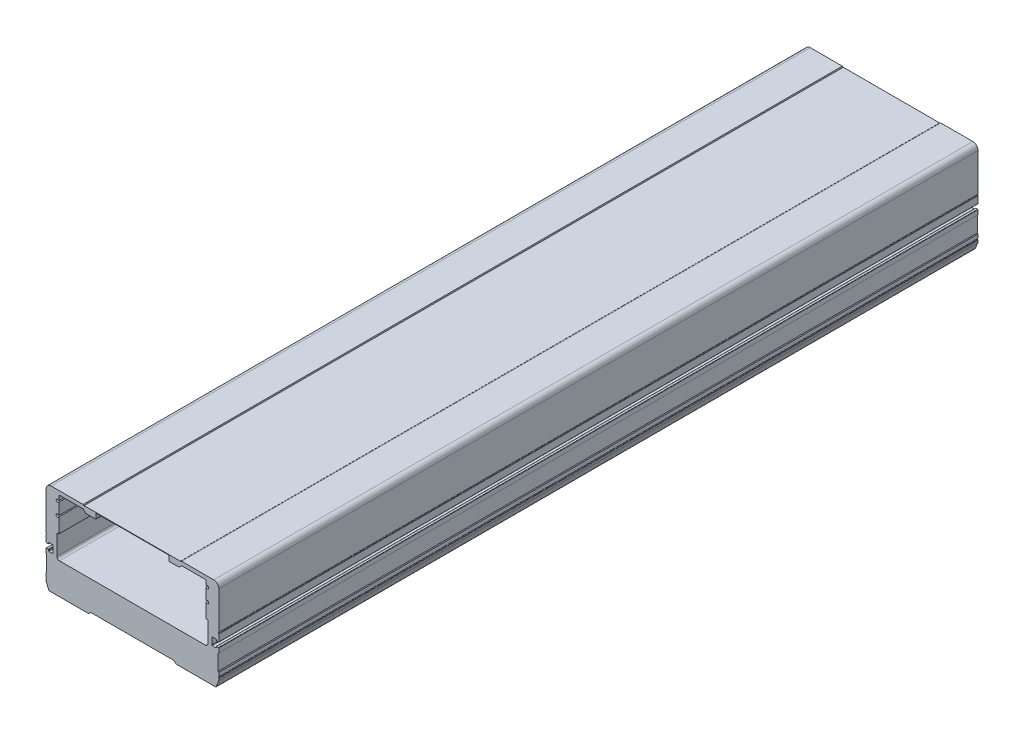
ISO-10303-21;
HEADER;
FILE_DESCRIPTION(('STEP AP214'),'2;1');
FILE_NAME('part.step','',(''),(''),'','','');
FILE_SCHEMA(('AUTOMOTIVE_DESIGN { 1 0 10303 214 1 1 1 1 }'));
ENDSEC;
DATA;
#1=APPLICATION_CONTEXT('core data for automotive mechanical design processes');
#2=APPLICATION_PROTOCOL_DEFINITION('international standard','automotive_design',2000,#1);
#3=PRODUCT_CONTEXT('',#1,'mechanical');
#4=PRODUCT('Part','Part','',(#3));
#5=PRODUCT_RELATED_PRODUCT_CATEGORY('part','',(#4));
#6=PRODUCT_DEFINITION_FORMATION('','',#4);
#7=PRODUCT_DEFINITION_CONTEXT('part definition',#1,'design');
#8=PRODUCT_DEFINITION('design','',#6,#7);
#9=PRODUCT_DEFINITION_SHAPE('','',#8);
#10=(LENGTH_UNIT() NAMED_UNIT(*) SI_UNIT(.MILLI.,.METRE.));
#11=(NAMED_UNIT(*) PLANE_ANGLE_UNIT() SI_UNIT($,.RADIAN.));
#12=(NAMED_UNIT(*) SI_UNIT($,.STERADIAN.) SOLID_ANGLE_UNIT());
#13=UNCERTAINTY_MEASURE_WITH_UNIT(LENGTH_MEASURE(1.E-05),#10,'distance_accuracy_value','');
#14=(GEOMETRIC_REPRESENTATION_CONTEXT(3) GLOBAL_UNCERTAINTY_ASSIGNED_CONTEXT((#13)) GLOBAL_UNIT_ASSIGNED_CONTEXT((#10,
#11,#12)) REPRESENTATION_CONTEXT('',''));
#15=CARTESIAN_POINT('',(0.,0.,0.));
#16=DIRECTION('',(0.,0.,1.));
#17=DIRECTION('',(1.,0.,0.));
#18=AXIS2_PLACEMENT_3D('',#15,#16,#17);
#19=CARTESIAN_POINT('',(-63.4999999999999,66.1,593.));
#20=DIRECTION('',(0.,0.,1.));
#21=DIRECTION('',(1.,0.,0.));
#22=AXIS2_PLACEMENT_3D('',#19,#20,#21);
#23=PLANE('',#22);
#24=CARTESIAN_POINT('',(-63.4999999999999,66.1,593.));
#25=DIRECTION('',(0.,0.,1.));
#26=DIRECTION('',(1.,0.,0.));
#27=AXIS2_PLACEMENT_3D('',#24,#25,#26);
#28=CIRCLE('',#27,4.);
#29=CARTESIAN_POINT('',(-63.4999999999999,70.1,593.));
#30=VERTEX_POINT('',#29);
#31=CARTESIAN_POINT('',(-67.4999999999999,66.1,593.));
#32=VERTEX_POINT('',#31);
#33=EDGE_CURVE('E1015',#30,#32,#28,.T.);
#34=ORIENTED_EDGE('',*,*,#33,.T.);
#35=DIRECTION('',(0.,-1.,0.));
#36=VECTOR('',#35,1.);
#37=CARTESIAN_POINT('',(-67.4999999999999,66.1,593.));
#38=LINE('',#37,#36);
#39=CARTESIAN_POINT('',(-67.4999999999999,36.60466933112,593.));
#40=VERTEX_POINT('',#39);
#41=EDGE_CURVE('E1018',#32,#40,#38,.T.);
#42=ORIENTED_EDGE('',*,*,#41,.T.);
#43=CARTESIAN_POINT('',(-67.1999999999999,36.60466933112,593.));
#44=DIRECTION('',(0.,0.,1.));
#45=DIRECTION('',(1.,0.,0.));
#46=AXIS2_PLACEMENT_3D('',#43,#44,#45);
#47=CIRCLE('',#46,0.299999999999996);
#48=CARTESIAN_POINT('',(-67.3333332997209,36.3359273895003,593.));
#49=VERTEX_POINT('',#48);
#50=EDGE_CURVE('E1021',#40,#49,#47,.T.);
#51=ORIENTED_EDGE('',*,*,#50,.T.);
#52=CARTESIAN_POINT('',(-67.4999999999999,36.,593.));
#53=DIRECTION('',(0.,0.,-1.));
#54=DIRECTION('',(1.,0.,0.));
#55=AXIS2_PLACEMENT_3D('',#52,#53,#54);
#56=CIRCLE('',#55,0.374999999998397);
#57=CARTESIAN_POINT('',(-67.333333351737,35.6640725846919,593.));
#58=VERTEX_POINT('',#57);
#59=EDGE_CURVE('E1023',#49,#58,#56,.T.);
#60=ORIENTED_EDGE('',*,*,#59,.T.);
#61=CARTESIAN_POINT('',(-67.1999999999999,35.39533066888,593.));
#62=DIRECTION('',(0.,0.,1.));
#63=DIRECTION('',(1.,0.,0.));
#64=AXIS2_PLACEMENT_3D('',#61,#62,#63);
#65=CIRCLE('',#64,0.299999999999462);
#66=CARTESIAN_POINT('',(-67.4999999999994,35.39533066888,593.));
#67=VERTEX_POINT('',#66);
#68=EDGE_CURVE('E1025',#58,#67,#65,.T.);
#69=ORIENTED_EDGE('',*,*,#68,.T.);
#70=DIRECTION('',(0.,-1.,0.));
#71=VECTOR('',#70,1.);
#72=CARTESIAN_POINT('',(-67.4999999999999,35.39533066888,593.));
#73=LINE('',#72,#71);
#74=CARTESIAN_POINT('',(-67.4999999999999,30.1,593.));
#75=VERTEX_POINT('',#74);
#76=EDGE_CURVE('E1027',#67,#75,#73,.T.);
#77=ORIENTED_EDGE('',*,*,#76,.T.);
#78=CARTESIAN_POINT('',(-67.1999999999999,30.1,593.));
#79=DIRECTION('',(0.,0.,1.));
#80=DIRECTION('',(1.,0.,0.));
#81=AXIS2_PLACEMENT_3D('',#78,#79,#80);
#82=CIRCLE('',#81,0.299999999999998);
#83=CARTESIAN_POINT('',(-67.1999999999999,29.8,593.));
#84=VERTEX_POINT('',#83);
#85=EDGE_CURVE('E1029',#75,#84,#82,.T.);
#86=ORIENTED_EDGE('',*,*,#85,.T.);
#87=DIRECTION('',(1.,0.,0.));
#88=VECTOR('',#87,1.);
#89=CARTESIAN_POINT('',(-67.1999999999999,29.8,593.));
#90=LINE('',#89,#88);
#91=CARTESIAN_POINT('',(-65.7999999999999,29.8,593.));
#92=VERTEX_POINT('',#91);
#93=EDGE_CURVE('E1031',#84,#92,#90,.T.);
#94=ORIENTED_EDGE('',*,*,#93,.T.);
#95=CARTESIAN_POINT('',(-65.7999999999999,30.1,593.));
#96=DIRECTION('',(0.,0.,1.));
#97=DIRECTION('',(1.,0.,0.));
#98=AXIS2_PLACEMENT_3D('',#95,#96,#97);
#99=CIRCLE('',#98,0.299999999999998);
#100=CARTESIAN_POINT('',(-65.4999999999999,30.1,593.));
#101=VERTEX_POINT('',#100);
#102=EDGE_CURVE('E1033',#92,#101,#99,.T.);
#103=ORIENTED_EDGE('',*,*,#102,.T.);
#104=DIRECTION('',(0.,1.,0.));
#105=VECTOR('',#104,1.);
#106=CARTESIAN_POINT('',(-65.4999999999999,30.1,593.));
#107=LINE('',#106,#105);
#108=CARTESIAN_POINT('',(-65.4999999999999,30.7,593.));
#109=VERTEX_POINT('',#108);
#110=EDGE_CURVE('E1035',#101,#109,#107,.T.);
#111=ORIENTED_EDGE('',*,*,#110,.T.);
#112=CARTESIAN_POINT('',(-65.1999999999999,30.7,593.));
#113=DIRECTION('',(0.,0.,-1.));
#114=DIRECTION('',(1.,0.,0.));
#115=AXIS2_PLACEMENT_3D('',#112,#113,#114);
#116=CIRCLE('',#115,0.300000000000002);
#117=CARTESIAN_POINT('',(-65.1999999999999,31.,593.));
#118=VERTEX_POINT('',#117);
#119=EDGE_CURVE('E1037',#109,#118,#116,.T.);
#120=ORIENTED_EDGE('',*,*,#119,.T.);
#121=DIRECTION('',(1.,0.,0.));
#122=VECTOR('',#121,1.);
#123=CARTESIAN_POINT('',(-65.1999999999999,31.,593.));
#124=LINE('',#123,#122);
#125=CARTESIAN_POINT('',(-62.2999999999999,31.,593.));
#126=VERTEX_POINT('',#125);
#127=EDGE_CURVE('E1039',#118,#126,#124,.T.);
#128=ORIENTED_EDGE('',*,*,#127,.T.);
#129=CARTESIAN_POINT('',(-62.2999999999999,30.7,593.));
#130=DIRECTION('',(0.,0.,-1.));
#131=DIRECTION('',(1.,0.,0.));
#132=AXIS2_PLACEMENT_3D('',#129,#130,#131);
#133=CIRCLE('',#132,0.300000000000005);
#134=CARTESIAN_POINT('',(-61.9999999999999,30.7,593.));
#135=VERTEX_POINT('',#134);
#136=EDGE_CURVE('E1041',#126,#135,#133,.T.);
#137=ORIENTED_EDGE('',*,*,#136,.T.);
#138=DIRECTION('',(0.,-1.,0.));
#139=VECTOR('',#138,1.);
#140=CARTESIAN_POINT('',(-61.9999999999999,30.7,593.));
#141=LINE('',#140,#139);
#142=CARTESIAN_POINT('',(-61.9999999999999,25.3,593.));
#143=VERTEX_POINT('',#142);
#144=EDGE_CURVE('E1043',#135,#143,#141,.T.);
#145=ORIENTED_EDGE('',*,*,#144,.T.);
#146=CARTESIAN_POINT('',(-62.2999999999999,25.3,593.));
#147=DIRECTION('',(0.,0.,-1.));
#148=DIRECTION('',(1.,0.,0.));
#149=AXIS2_PLACEMENT_3D('',#146,#147,#148);
#150=CIRCLE('',#149,0.3);
#151=CARTESIAN_POINT('',(-62.2999999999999,25.,593.));
#152=VERTEX_POINT('',#151);
#153=EDGE_CURVE('E1045',#143,#152,#150,.T.);
#154=ORIENTED_EDGE('',*,*,#153,.T.);
#155=DIRECTION('',(-1.,0.,0.));
#156=VECTOR('',#155,1.);
#157=CARTESIAN_POINT('',(-62.2999999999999,25.,593.));
#158=LINE('',#157,#156);
#159=CARTESIAN_POINT('',(-65.1999999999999,25.,593.));
#160=VERTEX_POINT('',#159);
#161=EDGE_CURVE('E1047',#152,#160,#158,.T.);
#162=ORIENTED_EDGE('',*,*,#161,.T.);
#163=CARTESIAN_POINT('',(-65.1999999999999,25.3,593.));
#164=DIRECTION('',(0.,0.,-1.));
#165=DIRECTION('',(1.,0.,0.));
#166=AXIS2_PLACEMENT_3D('',#163,#164,#165);
#167=CIRCLE('',#166,0.299999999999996);
#168=CARTESIAN_POINT('',(-65.4999999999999,25.3,593.));
#169=VERTEX_POINT('',#168);
#170=EDGE_CURVE('E1049',#160,#169,#167,.T.);
#171=ORIENTED_EDGE('',*,*,#170,.T.);
#172=DIRECTION('',(0.,1.,0.));
#173=VECTOR('',#172,1.);
#174=CARTESIAN_POINT('',(-65.4999999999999,25.3,593.));
#175=LINE('',#174,#173);
#176=CARTESIAN_POINT('',(-65.4999999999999,25.9,593.));
#177=VERTEX_POINT('',#176);
#178=EDGE_CURVE('E1051',#169,#177,#175,.T.);
#179=ORIENTED_EDGE('',*,*,#178,.T.);
#180=CARTESIAN_POINT('',(-65.7999999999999,25.9,593.));
#181=DIRECTION('',(0.,0.,1.));
#182=DIRECTION('',(1.,0.,0.));
#183=AXIS2_PLACEMENT_3D('',#180,#181,#182);
#184=CIRCLE('',#183,0.299999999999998);
#185=CARTESIAN_POINT('',(-65.7999999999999,26.2,593.));
#186=VERTEX_POINT('',#185);
#187=EDGE_CURVE('E1053',#177,#186,#184,.T.);
#188=ORIENTED_EDGE('',*,*,#187,.T.);
#189=DIRECTION('',(-1.,0.,0.));
#190=VECTOR('',#189,1.);
#191=CARTESIAN_POINT('',(-65.7999999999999,26.2,593.));
#192=LINE('',#191,#190);
#193=CARTESIAN_POINT('',(-67.1999999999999,26.2,593.));
#194=VERTEX_POINT('',#193);
#195=EDGE_CURVE('E1055',#186,#194,#192,.T.);
#196=ORIENTED_EDGE('',*,*,#195,.T.);
#197=CARTESIAN_POINT('',(-67.1999999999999,25.9,593.));
#198=DIRECTION('',(0.,0.,1.));
#199=DIRECTION('',(1.,0.,0.));
#200=AXIS2_PLACEMENT_3D('',#197,#198,#199);
#201=CIRCLE('',#200,0.299999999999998);
#202=CARTESIAN_POINT('',(-67.4999999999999,25.9,593.));
#203=VERTEX_POINT('',#202);
#204=EDGE_CURVE('E1057',#194,#203,#201,.T.);
#205=ORIENTED_EDGE('',*,*,#204,.T.);
#206=DIRECTION('',(0.,-1.,0.));
#207=VECTOR('',#206,1.);
#208=CARTESIAN_POINT('',(-67.4999999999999,25.9,593.));
#209=LINE('',#208,#207);
#210=CARTESIAN_POINT('',(-67.4999999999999,22.5,593.));
#211=VERTEX_POINT('',#210);
#212=EDGE_CURVE('E1059',#203,#211,#209,.T.);
#213=ORIENTED_EDGE('',*,*,#212,.T.);
#214=DIRECTION('',(0.707106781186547,-0.707106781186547,0.));
#215=VECTOR('',#214,1.);
#216=CARTESIAN_POINT('',(-67.4999999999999,22.5,593.));
#217=LINE('',#216,#215);
#218=CARTESIAN_POINT('',(-66.9999999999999,22.,593.));
#219=VERTEX_POINT('',#218);
#220=EDGE_CURVE('E1061',#211,#219,#217,.T.);
#221=ORIENTED_EDGE('',*,*,#220,.T.);
#222=DIRECTION('',(0.,-1.,0.));
#223=VECTOR('',#222,1.);
#224=CARTESIAN_POINT('',(-66.9999999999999,22.,593.));
#225=LINE('',#224,#223);
#226=CARTESIAN_POINT('',(-66.9999999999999,9.99999999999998,593.));
#227=VERTEX_POINT('',#226);
#228=EDGE_CURVE('E1063',#219,#227,#225,.T.);
#229=ORIENTED_EDGE('',*,*,#228,.T.);
#230=DIRECTION('',(-0.707106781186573,-0.707106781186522,0.));
#231=VECTOR('',#230,1.);
#232=CARTESIAN_POINT('',(-66.9999999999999,9.99999999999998,593.));
#233=LINE('',#232,#231);
#234=CARTESIAN_POINT('',(-67.4999999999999,9.50000000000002,593.));
#235=VERTEX_POINT('',#234);
#236=EDGE_CURVE('E1065',#227,#235,#233,.T.);
#237=ORIENTED_EDGE('',*,*,#236,.T.);
#238=DIRECTION('',(0.,-1.,0.));
#239=VECTOR('',#238,1.);
#240=CARTESIAN_POINT('',(-67.4999999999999,9.50000000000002,593.));
#241=LINE('',#240,#239);
#242=CARTESIAN_POINT('',(-67.4999999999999,6.60466933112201,593.));
#243=VERTEX_POINT('',#242);
#244=EDGE_CURVE('E1067',#235,#243,#241,.T.);
#245=ORIENTED_EDGE('',*,*,#244,.T.);
#246=CARTESIAN_POINT('',(-67.1999999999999,6.60466933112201,593.));
#247=DIRECTION('',(0.,0.,1.));
#248=DIRECTION('',(1.,0.,0.));
#249=AXIS2_PLACEMENT_3D('',#246,#247,#248);
#250=CIRCLE('',#249,0.299999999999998);
#251=CARTESIAN_POINT('',(-67.3333333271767,6.33592740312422,593.));
#252=VERTEX_POINT('',#251);
#253=EDGE_CURVE('E1069',#243,#252,#250,.T.);
#254=ORIENTED_EDGE('',*,*,#253,.T.);
#255=CARTESIAN_POINT('',(-67.4999999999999,6.,593.));
#256=DIRECTION('',(0.,0.,-1.));
#257=DIRECTION('',(1.,0.,0.));
#258=AXIS2_PLACEMENT_3D('',#255,#256,#257);
#259=CIRCLE('',#258,0.374999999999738);
#260=CARTESIAN_POINT('',(-67.3333333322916,5.66407259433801,593.));
#261=VERTEX_POINT('',#260);
#262=EDGE_CURVE('E1071',#252,#261,#259,.T.);
#263=ORIENTED_EDGE('',*,*,#262,.T.);
#264=CARTESIAN_POINT('',(-67.1999999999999,5.395330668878,593.));
#265=DIRECTION('',(0.,0.,1.));
#266=DIRECTION('',(1.,0.,0.));
#267=AXIS2_PLACEMENT_3D('',#264,#265,#266);
#268=CIRCLE('',#267,0.299999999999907);
#269=CARTESIAN_POINT('',(-67.4999999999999,5.395330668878,593.));
#270=VERTEX_POINT('',#269);
#271=EDGE_CURVE('E1073',#261,#270,#268,.T.);
#272=ORIENTED_EDGE('',*,*,#271,.T.);
#273=DIRECTION('',(0.,-1.,0.));
#274=VECTOR('',#273,1.);
#275=CARTESIAN_POINT('',(-67.4999999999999,5.395330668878,593.));
#276=LINE('',#275,#274);
#277=CARTESIAN_POINT('',(-67.4999999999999,4.381968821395,593.));
#278=VERTEX_POINT('',#277);
#279=EDGE_CURVE('E1075',#270,#278,#276,.T.);
#280=ORIENTED_EDGE('',*,*,#279,.T.);
#281=CARTESIAN_POINT('',(-65.4999999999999,4.381968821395,593.));
#282=DIRECTION('',(0.,0.,1.));
#283=DIRECTION('',(1.,0.,0.));
#284=AXIS2_PLACEMENT_3D('',#281,#282,#283);
#285=CIRCLE('',#284,1.99999999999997);
#286=CARTESIAN_POINT('',(-67.3592342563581,3.64491524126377,593.));
#287=VERTEX_POINT('',#286);
#288=EDGE_CURVE('E1077',#278,#287,#285,.T.);
#289=ORIENTED_EDGE('',*,*,#288,.T.);
#290=DIRECTION('',(0.36852679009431,-0.929617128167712,0.));
#291=VECTOR('',#290,1.);
#292=CARTESIAN_POINT('',(-67.3592342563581,3.64491524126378,593.));
#293=LINE('',#292,#291);
#294=CARTESIAN_POINT('',(-65.5064193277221,-1.02885214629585,593.));
#295=VERTEX_POINT('',#294);
#296=EDGE_CURVE('E1079',#287,#295,#293,.T.);
#297=ORIENTED_EDGE('',*,*,#296,.T.);
#298=CARTESIAN_POINT('',(-63.6471850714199,-0.291798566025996,593.));
#299=DIRECTION('',(0.,0.,1.));
#300=DIRECTION('',(1.,0.,0.));
#301=AXIS2_PLACEMENT_3D('',#298,#299,#300);
#302=CIRCLE('',#301,1.99999999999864);
#303=CARTESIAN_POINT('',(-65.1600000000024,-1.60000000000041,593.));
#304=VERTEX_POINT('',#303);
#305=EDGE_CURVE('E1081',#295,#304,#302,.T.);
#306=ORIENTED_EDGE('',*,*,#305,.T.);
#307=DIRECTION('',(1.,0.,0.));
#308=VECTOR('',#307,1.);
#309=CARTESIAN_POINT('',(-65.1600000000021,-1.60000000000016,593.));
#310=LINE('',#309,#308);
#311=CARTESIAN_POINT('',(-34.1000000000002,-1.60000000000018,593.));
#312=VERTEX_POINT('',#311);
#313=EDGE_CURVE('E1083',#304,#312,#310,.T.);
#314=ORIENTED_EDGE('',*,*,#313,.T.);
#315=DIRECTION('',(0.707106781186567,0.707106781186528,0.));
#316=VECTOR('',#315,1.);
#317=CARTESIAN_POINT('',(-34.1000000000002,-1.60000000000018,593.));
#318=LINE('',#317,#316);
#319=CARTESIAN_POINT('',(-32.4999999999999,0.,593.));
#320=VERTEX_POINT('',#319);
#321=EDGE_CURVE('E1085',#312,#320,#318,.T.);
#322=ORIENTED_EDGE('',*,*,#321,.T.);
#323=DIRECTION('',(1.,0.,0.));
#324=VECTOR('',#323,1.);
#325=CARTESIAN_POINT('',(-32.4999999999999,0.,593.));
#326=LINE('',#325,#324);
#327=CARTESIAN_POINT('',(32.4999999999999,0.,593.));
#328=VERTEX_POINT('',#327);
#329=EDGE_CURVE('E1087',#320,#328,#326,.T.);
#330=ORIENTED_EDGE('',*,*,#329,.T.);
#331=DIRECTION('',(0.707106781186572,-0.707106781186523,0.));
#332=VECTOR('',#331,1.);
#333=CARTESIAN_POINT('',(32.4999999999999,0.,593.));
#334=LINE('',#333,#332);
#335=CARTESIAN_POINT('',(34.1000000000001,-1.60000000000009,593.));
#336=VERTEX_POINT('',#335);
#337=EDGE_CURVE('E1089',#328,#336,#334,.T.);
#338=ORIENTED_EDGE('',*,*,#337,.T.);
#339=DIRECTION('',(1.,0.,0.));
#340=VECTOR('',#339,1.);
#341=CARTESIAN_POINT('',(34.1000000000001,-1.60000000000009,593.));
#342=LINE('',#341,#340);
#343=CARTESIAN_POINT('',(65.1600000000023,-1.60000000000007,593.));
#344=VERTEX_POINT('',#343);
#345=EDGE_CURVE('E1091',#336,#344,#342,.T.);
#346=ORIENTED_EDGE('',*,*,#345,.T.);
#347=CARTESIAN_POINT('',(63.6471850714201,-0.291798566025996,593.));
#348=DIRECTION('',(0.,0.,1.));
#349=DIRECTION('',(1.,0.,0.));
#350=AXIS2_PLACEMENT_3D('',#347,#348,#349);
#351=CIRCLE('',#350,1.99999999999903);
#352=CARTESIAN_POINT('',(65.506419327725,-1.02885214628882,593.));
#353=VERTEX_POINT('',#352);
#354=EDGE_CURVE('E1093',#344,#353,#351,.T.);
#355=ORIENTED_EDGE('',*,*,#354,.T.);
#356=DIRECTION('',(0.368526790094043,0.929617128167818,0.));
#357=VECTOR('',#356,1.);
#358=CARTESIAN_POINT('',(65.5064193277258,-1.0288521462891,593.));
#359=LINE('',#358,#357);
#360=CARTESIAN_POINT('',(67.3592342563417,3.64491524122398,593.));
#361=VERTEX_POINT('',#360);
#362=EDGE_CURVE('E1095',#353,#361,#359,.T.);
#363=ORIENTED_EDGE('',*,*,#362,.T.);
#364=CARTESIAN_POINT('',(65.4999999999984,4.38196882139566,593.));
#365=DIRECTION('',(0.,0.,1.));
#366=DIRECTION('',(1.,0.,0.));
#367=AXIS2_PLACEMENT_3D('',#364,#365,#366);
#368=CIRCLE('',#367,2.00000000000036);
#369=CARTESIAN_POINT('',(67.4999999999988,4.38196882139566,593.));
#370=VERTEX_POINT('',#369);
#371=EDGE_CURVE('E1097',#361,#370,#368,.T.);
#372=ORIENTED_EDGE('',*,*,#371,.T.);
#373=DIRECTION('',(0.,1.,0.));
#374=VECTOR('',#373,1.);
#375=CARTESIAN_POINT('',(67.4999999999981,4.38196882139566,593.));
#376=LINE('',#375,#374);
#377=CARTESIAN_POINT('',(67.4999999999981,5.39533066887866,593.));
#378=VERTEX_POINT('',#377);
#379=EDGE_CURVE('E1099',#370,#378,#376,.T.);
#380=ORIENTED_EDGE('',*,*,#379,.T.);
#381=CARTESIAN_POINT('',(67.1999999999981,5.39533066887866,593.));
#382=DIRECTION('',(0.,0.,1.));
#383=DIRECTION('',(1.,0.,0.));
#384=AXIS2_PLACEMENT_3D('',#381,#382,#383);
#385=CIRCLE('',#384,0.299999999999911);
#386=CARTESIAN_POINT('',(67.3333333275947,5.66407259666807,593.));
#387=VERTEX_POINT('',#386);
#388=EDGE_CURVE('E1101',#378,#387,#385,.T.);
#389=ORIENTED_EDGE('',*,*,#388,.T.);
#390=CARTESIAN_POINT('',(67.4999999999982,6.00000000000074,593.));
#391=DIRECTION('',(0.,0.,-1.));
#392=DIRECTION('',(1.,0.,0.));
#393=AXIS2_PLACEMENT_3D('',#390,#391,#392);
#394=CIRCLE('',#393,0.374999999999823);
#395=CARTESIAN_POINT('',(67.3333333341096,6.33592740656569,593.));
#396=VERTEX_POINT('',#395);
#397=EDGE_CURVE('E1103',#387,#396,#394,.T.);
#398=ORIENTED_EDGE('',*,*,#397,.T.);
#399=CARTESIAN_POINT('',(67.1999999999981,6.60466933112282,593.));
#400=DIRECTION('',(0.,0.,1.));
#401=DIRECTION('',(1.,0.,0.));
#402=AXIS2_PLACEMENT_3D('',#399,#400,#401);
#403=CIRCLE('',#402,0.299999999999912);
#404=CARTESIAN_POINT('',(67.4999999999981,6.60466933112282,593.));
#405=VERTEX_POINT('',#404);
#406=EDGE_CURVE('E1105',#396,#405,#403,.T.);
#407=ORIENTED_EDGE('',*,*,#406,.T.);
#408=DIRECTION('',(0.,1.,0.));
#409=VECTOR('',#408,1.);
#410=CARTESIAN_POINT('',(67.4999999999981,6.60466933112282,593.));
#411=LINE('',#410,#409);
#412=CARTESIAN_POINT('',(67.4999999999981,9.50000000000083,593.));
#413=VERTEX_POINT('',#412);
#414=EDGE_CURVE('E1107',#405,#413,#411,.T.);
#415=ORIENTED_EDGE('',*,*,#414,.T.);
#416=DIRECTION('',(-0.707106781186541,0.707106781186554,0.));
#417=VECTOR('',#416,1.);
#418=CARTESIAN_POINT('',(67.4999999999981,9.50000000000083,593.));
#419=LINE('',#418,#417);
#420=CARTESIAN_POINT('',(66.9999999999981,10.0000000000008,593.));
#421=VERTEX_POINT('',#420);
#422=EDGE_CURVE('E1109',#413,#421,#419,.T.);
#423=ORIENTED_EDGE('',*,*,#422,.T.);
#424=DIRECTION('',(0.,1.,0.));
#425=VECTOR('',#424,1.);
#426=CARTESIAN_POINT('',(66.9999999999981,10.0000000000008,593.));
#427=LINE('',#426,#425);
#428=CARTESIAN_POINT('',(66.9999999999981,22.0000000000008,593.));
#429=VERTEX_POINT('',#428);
#430=EDGE_CURVE('E1111',#421,#429,#427,.T.);
#431=ORIENTED_EDGE('',*,*,#430,.T.);
#432=DIRECTION('',(0.707106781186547,0.707106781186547,0.));
#433=VECTOR('',#432,1.);
#434=CARTESIAN_POINT('',(66.9999999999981,22.0000000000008,593.));
#435=LINE('',#434,#433);
#436=CARTESIAN_POINT('',(67.4999999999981,22.5000000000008,593.));
#437=VERTEX_POINT('',#436);
#438=EDGE_CURVE('E1113',#429,#437,#435,.T.);
#439=ORIENTED_EDGE('',*,*,#438,.T.);
#440=DIRECTION('',(0.,1.,0.));
#441=VECTOR('',#440,1.);
#442=CARTESIAN_POINT('',(67.4999999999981,22.5000000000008,593.));
#443=LINE('',#442,#441);
#444=CARTESIAN_POINT('',(67.4999999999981,25.9000000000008,593.));
#445=VERTEX_POINT('',#444);
#446=EDGE_CURVE('E1115',#437,#445,#443,.T.);
#447=ORIENTED_EDGE('',*,*,#446,.T.);
#448=CARTESIAN_POINT('',(67.1999999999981,25.9000000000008,593.));
#449=DIRECTION('',(0.,0.,1.));
#450=DIRECTION('',(1.,0.,0.));
#451=AXIS2_PLACEMENT_3D('',#448,#449,#450);
#452=CIRCLE('',#451,0.300000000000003);
#453=CARTESIAN_POINT('',(67.1999999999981,26.2000000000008,593.));
#454=VERTEX_POINT('',#453);
#455=EDGE_CURVE('E1117',#445,#454,#452,.T.);
#456=ORIENTED_EDGE('',*,*,#455,.T.);
#457=DIRECTION('',(-1.,0.,0.));
#458=VECTOR('',#457,1.);
#459=CARTESIAN_POINT('',(67.1999999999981,26.2000000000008,593.));
#460=LINE('',#459,#458);
#461=CARTESIAN_POINT('',(65.7999999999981,26.2000000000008,593.));
#462=VERTEX_POINT('',#461);
#463=EDGE_CURVE('E1119',#454,#462,#460,.T.);
#464=ORIENTED_EDGE('',*,*,#463,.T.);
#465=CARTESIAN_POINT('',(65.7999999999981,25.9000000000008,593.));
#466=DIRECTION('',(0.,0.,1.));
#467=DIRECTION('',(1.,0.,0.));
#468=AXIS2_PLACEMENT_3D('',#465,#466,#467);
#469=CIRCLE('',#468,0.299999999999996);
#470=CARTESIAN_POINT('',(65.4999999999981,25.9000000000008,593.));
#471=VERTEX_POINT('',#470);
#472=EDGE_CURVE('E1121',#462,#471,#469,.T.);
#473=ORIENTED_EDGE('',*,*,#472,.T.);
#474=DIRECTION('',(0.,-1.,0.));
#475=VECTOR('',#474,1.);
#476=CARTESIAN_POINT('',(65.4999999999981,25.9000000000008,593.));
#477=LINE('',#476,#475);
#478=CARTESIAN_POINT('',(65.4999999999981,25.3000000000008,593.));
#479=VERTEX_POINT('',#478);
#480=EDGE_CURVE('E1123',#471,#479,#477,.T.);
#481=ORIENTED_EDGE('',*,*,#480,.T.);
#482=CARTESIAN_POINT('',(65.1999999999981,25.3000000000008,593.));
#483=DIRECTION('',(0.,0.,-1.));
#484=DIRECTION('',(1.,0.,0.));
#485=AXIS2_PLACEMENT_3D('',#482,#483,#484);
#486=CIRCLE('',#485,0.299999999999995);
#487=CARTESIAN_POINT('',(65.1999999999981,25.0000000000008,593.));
#488=VERTEX_POINT('',#487);
#489=EDGE_CURVE('E1125',#479,#488,#486,.T.);
#490=ORIENTED_EDGE('',*,*,#489,.T.);
#491=DIRECTION('',(-1.,0.,0.));
#492=VECTOR('',#491,1.);
#493=CARTESIAN_POINT('',(65.1999999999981,25.0000000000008,593.));
#494=LINE('',#493,#492);
#495=CARTESIAN_POINT('',(62.2999999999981,25.0000000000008,593.));
#496=VERTEX_POINT('',#495);
#497=EDGE_CURVE('E1127',#488,#496,#494,.T.);
#498=ORIENTED_EDGE('',*,*,#497,.T.);
#499=CARTESIAN_POINT('',(62.2999999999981,25.3000000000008,593.));
#500=DIRECTION('',(0.,0.,-1.));
#501=DIRECTION('',(1.,0.,0.));
#502=AXIS2_PLACEMENT_3D('',#499,#500,#501);
#503=CIRCLE('',#502,0.3);
#504=CARTESIAN_POINT('',(61.9999999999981,25.3000000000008,593.));
#505=VERTEX_POINT('',#504);
#506=EDGE_CURVE('E1129',#496,#505,#503,.T.);
#507=ORIENTED_EDGE('',*,*,#506,.T.);
#508=DIRECTION('',(0.,1.,0.));
#509=VECTOR('',#508,1.);
#510=CARTESIAN_POINT('',(61.9999999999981,25.3000000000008,593.));
#511=LINE('',#510,#509);
#512=CARTESIAN_POINT('',(61.9999999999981,30.7000000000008,593.));
#513=VERTEX_POINT('',#512);
#514=EDGE_CURVE('E1131',#505,#513,#511,.T.);
#515=ORIENTED_EDGE('',*,*,#514,.T.);
#516=CARTESIAN_POINT('',(62.2999999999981,30.7000000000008,593.));
#517=DIRECTION('',(0.,0.,-1.));
#518=DIRECTION('',(1.,0.,0.));
#519=AXIS2_PLACEMENT_3D('',#516,#517,#518);
#520=CIRCLE('',#519,0.300000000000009);
#521=CARTESIAN_POINT('',(62.2999999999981,31.0000000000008,593.));
#522=VERTEX_POINT('',#521);
#523=EDGE_CURVE('E1133',#513,#522,#520,.T.);
#524=ORIENTED_EDGE('',*,*,#523,.T.);
#525=DIRECTION('',(1.,0.,0.));
#526=VECTOR('',#525,1.);
#527=CARTESIAN_POINT('',(62.2999999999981,31.0000000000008,593.));
#528=LINE('',#527,#526);
#529=CARTESIAN_POINT('',(65.1999999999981,31.0000000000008,593.));
#530=VERTEX_POINT('',#529);
#531=EDGE_CURVE('E1135',#522,#530,#528,.T.);
#532=ORIENTED_EDGE('',*,*,#531,.T.);
#533=CARTESIAN_POINT('',(65.1999999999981,30.7000000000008,593.));
#534=DIRECTION('',(0.,0.,-1.));
#535=DIRECTION('',(1.,0.,0.));
#536=AXIS2_PLACEMENT_3D('',#533,#534,#535);
#537=CIRCLE('',#536,0.300000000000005);
#538=CARTESIAN_POINT('',(65.4999999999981,30.7000000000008,593.));
#539=VERTEX_POINT('',#538);
#540=EDGE_CURVE('E1137',#530,#539,#537,.T.);
#541=ORIENTED_EDGE('',*,*,#540,.T.);
#542=DIRECTION('',(0.,-1.,0.));
#543=VECTOR('',#542,1.);
#544=CARTESIAN_POINT('',(65.4999999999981,30.7000000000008,593.));
#545=LINE('',#544,#543);
#546=CARTESIAN_POINT('',(65.4999999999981,30.1000000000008,593.));
#547=VERTEX_POINT('',#546);
#548=EDGE_CURVE('E1139',#539,#547,#545,.T.);
#549=ORIENTED_EDGE('',*,*,#548,.T.);
#550=CARTESIAN_POINT('',(65.7999999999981,30.1000000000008,593.));
#551=DIRECTION('',(0.,0.,1.));
#552=DIRECTION('',(1.,0.,0.));
#553=AXIS2_PLACEMENT_3D('',#550,#551,#552);
#554=CIRCLE('',#553,0.299999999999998);
#555=CARTESIAN_POINT('',(65.7999999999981,29.8000000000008,593.));
#556=VERTEX_POINT('',#555);
#557=EDGE_CURVE('E1141',#547,#556,#554,.T.);
#558=ORIENTED_EDGE('',*,*,#557,.T.);
#559=DIRECTION('',(1.,0.,0.));
#560=VECTOR('',#559,1.);
#561=CARTESIAN_POINT('',(65.7999999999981,29.8000000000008,593.));
#562=LINE('',#561,#560);
#563=CARTESIAN_POINT('',(67.1999999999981,29.8000000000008,593.));
#564=VERTEX_POINT('',#563);
#565=EDGE_CURVE('E1143',#556,#564,#562,.T.);
#566=ORIENTED_EDGE('',*,*,#565,.T.);
#567=CARTESIAN_POINT('',(67.1999999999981,30.1000000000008,593.));
#568=DIRECTION('',(0.,0.,1.));
#569=DIRECTION('',(1.,0.,0.));
#570=AXIS2_PLACEMENT_3D('',#567,#568,#569);
#571=CIRCLE('',#570,0.299999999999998);
#572=CARTESIAN_POINT('',(67.4999999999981,30.1000000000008,593.));
#573=VERTEX_POINT('',#572);
#574=EDGE_CURVE('E1145',#564,#573,#571,.T.);
#575=ORIENTED_EDGE('',*,*,#574,.T.);
#576=DIRECTION('',(0.,1.,0.));
#577=VECTOR('',#576,1.);
#578=CARTESIAN_POINT('',(67.4999999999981,30.1000000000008,593.));
#579=LINE('',#578,#577);
#580=CARTESIAN_POINT('',(67.4999999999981,35.3953306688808,593.));
#581=VERTEX_POINT('',#580);
#582=EDGE_CURVE('E1147',#573,#581,#579,.T.);
#583=ORIENTED_EDGE('',*,*,#582,.T.);
#584=CARTESIAN_POINT('',(67.1999999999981,35.3953306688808,593.));
#585=DIRECTION('',(0.,0.,1.));
#586=DIRECTION('',(1.,0.,0.));
#587=AXIS2_PLACEMENT_3D('',#584,#585,#586);
#588=CIRCLE('',#587,0.299999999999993);
#589=CARTESIAN_POINT('',(67.3333333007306,35.6640726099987,593.));
#590=VERTEX_POINT('',#589);
#591=EDGE_CURVE('E1149',#581,#590,#588,.T.);
#592=ORIENTED_EDGE('',*,*,#591,.T.);
#593=CARTESIAN_POINT('',(67.4999999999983,36.0000000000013,593.));
#594=DIRECTION('',(0.,0.,-1.));
#595=DIRECTION('',(1.,0.,0.));
#596=AXIS2_PLACEMENT_3D('',#593,#594,#595);
#597=CIRCLE('',#596,0.374999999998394);
#598=CARTESIAN_POINT('',(67.3333333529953,36.3359274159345,593.));
#599=VERTEX_POINT('',#598);
#600=EDGE_CURVE('E1151',#590,#599,#597,.T.);
#601=ORIENTED_EDGE('',*,*,#600,.T.);
#602=CARTESIAN_POINT('',(67.1999999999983,36.6046693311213,593.));
#603=DIRECTION('',(0.,0.,1.));
#604=DIRECTION('',(1.,0.,0.));
#605=AXIS2_PLACEMENT_3D('',#602,#603,#604);
#606=CIRCLE('',#605,0.299999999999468);
#607=CARTESIAN_POINT('',(67.4999999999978,36.6046693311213,593.));
#608=VERTEX_POINT('',#607);
#609=EDGE_CURVE('E1153',#599,#608,#606,.T.);
#610=ORIENTED_EDGE('',*,*,#609,.T.);
#611=DIRECTION('',(0.,1.,0.));
#612=VECTOR('',#611,1.);
#613=CARTESIAN_POINT('',(67.4999999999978,36.6046693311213,593.));
#614=LINE('',#613,#612);
#615=CARTESIAN_POINT('',(67.4999999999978,66.1000000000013,593.));
#616=VERTEX_POINT('',#615);
#617=EDGE_CURVE('E1155',#608,#616,#614,.T.);
#618=ORIENTED_EDGE('',*,*,#617,.T.);
#619=CARTESIAN_POINT('',(63.4999999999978,66.1000000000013,593.));
#620=DIRECTION('',(0.,0.,1.));
#621=DIRECTION('',(1.,0.,0.));
#622=AXIS2_PLACEMENT_3D('',#619,#620,#621);
#623=CIRCLE('',#622,4.);
#624=CARTESIAN_POINT('',(63.4999999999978,70.1000000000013,593.));
#625=VERTEX_POINT('',#624);
#626=EDGE_CURVE('E1157',#616,#625,#623,.T.);
#627=ORIENTED_EDGE('',*,*,#626,.T.);
#628=DIRECTION('',(-1.,0.,0.));
#629=VECTOR('',#628,1.);
#630=CARTESIAN_POINT('',(63.4999999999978,70.1000000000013,593.));
#631=LINE('',#630,#629);
#632=CARTESIAN_POINT('',(38.4999999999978,70.1000000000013,593.));
#633=VERTEX_POINT('',#632);
#634=EDGE_CURVE('E1159',#625,#633,#631,.T.);
#635=ORIENTED_EDGE('',*,*,#634,.T.);
#636=DIRECTION('',(-0.707106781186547,-0.707106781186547,0.));
#637=VECTOR('',#636,1.);
#638=CARTESIAN_POINT('',(38.4999999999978,70.1000000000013,593.));
#639=LINE('',#638,#637);
#640=CARTESIAN_POINT('',(37.9999999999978,69.6000000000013,593.));
#641=VERTEX_POINT('',#640);
#642=EDGE_CURVE('E1161',#633,#641,#639,.T.);
#643=ORIENTED_EDGE('',*,*,#642,.T.);
#644=DIRECTION('',(-1.,0.,0.));
#645=VECTOR('',#644,1.);
#646=CARTESIAN_POINT('',(37.9999999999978,69.6000000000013,593.));
#647=LINE('',#646,#645);
#648=CARTESIAN_POINT('',(37.4999999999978,69.6000000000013,593.));
#649=VERTEX_POINT('',#648);
#650=EDGE_CURVE('E1163',#641,#649,#647,.T.);
#651=ORIENTED_EDGE('',*,*,#650,.T.);
#652=DIRECTION('',(0.,1.,0.));
#653=VECTOR('',#652,1.);
#654=CARTESIAN_POINT('',(37.4999999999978,69.6000000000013,593.));
#655=LINE('',#654,#653);
#656=CARTESIAN_POINT('',(37.4999999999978,69.7,593.));
#657=VERTEX_POINT('',#656);
#658=EDGE_CURVE('E1165',#649,#657,#655,.T.);
#659=ORIENTED_EDGE('',*,*,#658,.T.);
#660=DIRECTION('',(-1.,0.,0.));
#661=VECTOR('',#660,1.);
#662=CARTESIAN_POINT('',(37.4999999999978,69.7,593.));
#663=LINE('',#662,#661);
#664=CARTESIAN_POINT('',(-37.4999999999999,69.7,593.));
#665=VERTEX_POINT('',#664);
#666=EDGE_CURVE('E1167',#657,#665,#663,.T.);
#667=ORIENTED_EDGE('',*,*,#666,.T.);
#668=DIRECTION('',(0.,-1.,0.));
#669=VECTOR('',#668,1.);
#670=CARTESIAN_POINT('',(-37.4999999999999,69.7,593.));
#671=LINE('',#670,#669);
#672=CARTESIAN_POINT('',(-37.4999999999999,69.6,593.));
#673=VERTEX_POINT('',#672);
#674=EDGE_CURVE('E1169',#665,#673,#671,.T.);
#675=ORIENTED_EDGE('',*,*,#674,.T.);
#676=DIRECTION('',(-1.,0.,0.));
#677=VECTOR('',#676,1.);
#678=CARTESIAN_POINT('',(-37.4999999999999,69.6,593.));
#679=LINE('',#678,#677);
#680=CARTESIAN_POINT('',(-37.9999999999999,69.6,593.));
#681=VERTEX_POINT('',#680);
#682=EDGE_CURVE('E1171',#673,#681,#679,.T.);
#683=ORIENTED_EDGE('',*,*,#682,.T.);
#684=DIRECTION('',(-0.707106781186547,0.707106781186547,0.));
#685=VECTOR('',#684,1.);
#686=CARTESIAN_POINT('',(-37.9999999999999,69.6,593.));
#687=LINE('',#686,#685);
#688=CARTESIAN_POINT('',(-38.4999999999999,70.1,593.));
#689=VERTEX_POINT('',#688);
#690=EDGE_CURVE('E1173',#681,#689,#687,.T.);
#691=ORIENTED_EDGE('',*,*,#690,.T.);
#692=DIRECTION('',(-1.,0.,0.));
#693=VECTOR('',#692,1.);
#694=CARTESIAN_POINT('',(-38.4999999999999,70.1,593.));
#695=LINE('',#694,#693);
#696=EDGE_CURVE('E1175',#689,#30,#695,.T.);
#697=ORIENTED_EDGE('',*,*,#696,.T.);
#698=EDGE_LOOP('',(#34,#42,#51,#60,#69,#77,#86,#94,#103,#111,#120,#128,#137,#145,#154,#162,#171,
#179,#188,#196,#205,#213,#221,#229,#237,#245,#254,#263,#272,#280,#289,#297,#306,#314,#322,#330,
#338,#346,#355,#363,#372,#380,#389,#398,#407,#415,#423,#431,#439,#447,#456,#464,#473,#481,#490,
#498,#507,#515,#524,#532,#541,#549,#558,#566,#575,#583,#592,#601,#610,#618,#627,#635,#643,#651,
#659,#667,#675,#683,#691,#697));
#699=FACE_BOUND('',#698,.T.);
#700=DIRECTION('',(0.,1.,0.));
#701=VECTOR('',#700,1.);
#702=CARTESIAN_POINT('',(59.0000000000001,24.7,593.));
#703=LINE('',#702,#701);
#704=CARTESIAN_POINT('',(59.0000000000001,24.7,593.));
#705=VERTEX_POINT('',#704);
#706=CARTESIAN_POINT('',(59.0000000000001,40.6,593.));
#707=VERTEX_POINT('',#706);
#708=EDGE_CURVE('E802',#705,#707,#703,.T.);
#709=ORIENTED_EDGE('',*,*,#708,.F.);
#710=CARTESIAN_POINT('',(57.0000000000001,24.7,593.));
#711=DIRECTION('',(0.,0.,1.));
#712=DIRECTION('',(1.,0.,0.));
#713=AXIS2_PLACEMENT_3D('',#710,#711,#712);
#714=CIRCLE('',#713,2.);
#715=CARTESIAN_POINT('',(57.0000000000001,22.7,593.));
#716=VERTEX_POINT('',#715);
#717=EDGE_CURVE('E800',#716,#705,#714,.T.);
#718=ORIENTED_EDGE('',*,*,#717,.F.);
#719=DIRECTION('',(1.,0.,0.));
#720=VECTOR('',#719,1.);
#721=CARTESIAN_POINT('',(-56.9999999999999,22.7,593.));
#722=LINE('',#721,#720);
#723=CARTESIAN_POINT('',(-56.9999999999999,22.7,593.));
#724=VERTEX_POINT('',#723);
#725=EDGE_CURVE('E861',#724,#716,#722,.T.);
#726=ORIENTED_EDGE('',*,*,#725,.F.);
#727=CARTESIAN_POINT('',(-56.9999999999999,24.7,593.));
#728=DIRECTION('',(0.,0.,1.));
#729=DIRECTION('',(1.,0.,0.));
#730=AXIS2_PLACEMENT_3D('',#727,#728,#729);
#731=CIRCLE('',#730,2.);
#732=CARTESIAN_POINT('',(-58.9999999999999,24.7,593.));
#733=VERTEX_POINT('',#732);
#734=EDGE_CURVE('E859',#733,#724,#731,.T.);
#735=ORIENTED_EDGE('',*,*,#734,.F.);
#736=DIRECTION('',(0.,-1.,0.));
#737=VECTOR('',#736,1.);
#738=CARTESIAN_POINT('',(-58.9999999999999,40.3,593.));
#739=LINE('',#738,#737);
#740=CARTESIAN_POINT('',(-58.9999999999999,40.3,593.));
#741=VERTEX_POINT('',#740);
#742=EDGE_CURVE('E857',#741,#733,#739,.T.);
#743=ORIENTED_EDGE('',*,*,#742,.F.);
#744=CARTESIAN_POINT('',(-59.2999999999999,40.3,593.));
#745=DIRECTION('',(0.,0.,-1.));
#746=DIRECTION('',(1.,0.,0.));
#747=AXIS2_PLACEMENT_3D('',#744,#745,#746);
#748=CIRCLE('',#747,0.299999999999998);
#749=CARTESIAN_POINT('',(-59.2999999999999,40.6,593.));
#750=VERTEX_POINT('',#749);
#751=EDGE_CURVE('E855',#750,#741,#748,.T.);
#752=ORIENTED_EDGE('',*,*,#751,.F.);
#753=DIRECTION('',(-1.,0.,0.));
#754=VECTOR('',#753,1.);
#755=CARTESIAN_POINT('',(-57.4999999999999,40.6,593.));
#756=LINE('',#755,#754);
#757=CARTESIAN_POINT('',(-57.4999999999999,40.6,593.));
#758=VERTEX_POINT('',#757);
#759=EDGE_CURVE('E853',#758,#750,#756,.T.);
#760=ORIENTED_EDGE('',*,*,#759,.F.);
#761=DIRECTION('',(0.,-1.,0.));
#762=VECTOR('',#761,1.);
#763=CARTESIAN_POINT('',(-57.5000000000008,52.1417424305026,593.));
#764=LINE('',#763,#762);
#765=CARTESIAN_POINT('',(-57.5000000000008,52.1417424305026,593.));
#766=VERTEX_POINT('',#765);
#767=EDGE_CURVE('E851',#766,#758,#764,.T.);
#768=ORIENTED_EDGE('',*,*,#767,.F.);
#769=CARTESIAN_POINT('',(-58.4999999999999,52.6,593.));
#770=DIRECTION('',(0.,0.,1.));
#771=DIRECTION('',(1.,0.,0.));
#772=AXIS2_PLACEMENT_3D('',#769,#770,#771);
#773=CIRCLE('',#772,1.10000000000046);
#774=CARTESIAN_POINT('',(-57.5000000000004,53.0582575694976,593.));
#775=VERTEX_POINT('',#774);
#776=EDGE_CURVE('E849',#775,#766,#773,.T.);
#777=ORIENTED_EDGE('',*,*,#776,.F.);
#778=DIRECTION('',(0.,-1.,0.));
#779=VECTOR('',#778,1.);
#780=CARTESIAN_POINT('',(-57.5000000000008,62.1417424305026,593.));
#781=LINE('',#780,#779);
#782=CARTESIAN_POINT('',(-57.5000000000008,62.1417424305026,593.));
#783=VERTEX_POINT('',#782);
#784=EDGE_CURVE('E847',#783,#775,#781,.T.);
#785=ORIENTED_EDGE('',*,*,#784,.F.);
#786=CARTESIAN_POINT('',(-58.4999999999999,62.6,593.));
#787=DIRECTION('',(0.,0.,1.));
#788=DIRECTION('',(1.,0.,0.));
#789=AXIS2_PLACEMENT_3D('',#786,#787,#788);
#790=CIRCLE('',#789,1.10000000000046);
#791=CARTESIAN_POINT('',(-57.5000000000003,63.0582575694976,593.));
#792=VERTEX_POINT('',#791);
#793=EDGE_CURVE('E845',#792,#783,#790,.T.);
#794=ORIENTED_EDGE('',*,*,#793,.F.);
#795=DIRECTION('',(0.,-1.,0.));
#796=VECTOR('',#795,1.);
#797=CARTESIAN_POINT('',(-57.4999999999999,66.1,593.));
#798=LINE('',#797,#796);
#799=CARTESIAN_POINT('',(-57.4999999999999,66.1,593.));
#800=VERTEX_POINT('',#799);
#801=EDGE_CURVE('E843',#800,#792,#798,.T.);
#802=ORIENTED_EDGE('',*,*,#801,.F.);
#803=CARTESIAN_POINT('',(-56.4999999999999,66.1,593.));
#804=DIRECTION('',(0.,0.,1.));
#805=DIRECTION('',(1.,0.,0.));
#806=AXIS2_PLACEMENT_3D('',#803,#804,#805);
#807=CIRCLE('',#806,1.);
#808=CARTESIAN_POINT('',(-56.4999999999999,67.1,593.));
#809=VERTEX_POINT('',#808);
#810=EDGE_CURVE('E841',#809,#800,#807,.T.);
#811=ORIENTED_EDGE('',*,*,#810,.F.);
#812=DIRECTION('',(-1.,0.,0.));
#813=VECTOR('',#812,1.);
#814=CARTESIAN_POINT('',(-38.4999999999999,67.1,593.));
#815=LINE('',#814,#813);
#816=CARTESIAN_POINT('',(-38.4999999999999,67.1,593.));
#817=VERTEX_POINT('',#816);
#818=EDGE_CURVE('E839',#817,#809,#815,.T.);
#819=ORIENTED_EDGE('',*,*,#818,.F.);
#820=DIRECTION('',(-0.707106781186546,0.707106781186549,0.));
#821=VECTOR('',#820,1.);
#822=CARTESIAN_POINT('',(-36.4999999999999,65.1,593.));
#823=LINE('',#822,#821);
#824=CARTESIAN_POINT('',(-36.4999999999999,65.1,593.));
#825=VERTEX_POINT('',#824);
#826=EDGE_CURVE('E837',#825,#817,#823,.T.);
#827=ORIENTED_EDGE('',*,*,#826,.F.);
#828=DIRECTION('',(-1.,0.,0.));
#829=VECTOR('',#828,1.);
#830=CARTESIAN_POINT('',(-28.7999999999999,65.1,593.));
#831=LINE('',#830,#829);
#832=CARTESIAN_POINT('',(-28.7999999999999,65.1,593.));
#833=VERTEX_POINT('',#832);
#834=EDGE_CURVE('E835',#833,#825,#831,.T.);
#835=ORIENTED_EDGE('',*,*,#834,.F.);
#836=CARTESIAN_POINT('',(-28.7999999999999,65.4,593.));
#837=DIRECTION('',(0.,0.,-1.));
#838=DIRECTION('',(1.,0.,0.));
#839=AXIS2_PLACEMENT_3D('',#836,#837,#838);
#840=CIRCLE('',#839,0.299999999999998);
#841=CARTESIAN_POINT('',(-28.4999999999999,65.4,593.));
#842=VERTEX_POINT('',#841);
#843=EDGE_CURVE('E833',#842,#833,#840,.T.);
#844=ORIENTED_EDGE('',*,*,#843,.F.);
#845=DIRECTION('',(0.,-1.,0.));
#846=VECTOR('',#845,1.);
#847=CARTESIAN_POINT('',(-28.4999999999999,69.3,593.));
#848=LINE('',#847,#846);
#849=CARTESIAN_POINT('',(-28.4999999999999,69.3,593.));
#850=VERTEX_POINT('',#849);
#851=EDGE_CURVE('E831',#850,#842,#848,.T.);
#852=ORIENTED_EDGE('',*,*,#851,.F.);
#853=DIRECTION('',(-1.,0.,0.));
#854=VECTOR('',#853,1.);
#855=CARTESIAN_POINT('',(28.5000000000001,69.3,593.));
#856=LINE('',#855,#854);
#857=CARTESIAN_POINT('',(28.5000000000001,69.3,593.));
#858=VERTEX_POINT('',#857);
#859=EDGE_CURVE('E829',#858,#850,#856,.T.);
#860=ORIENTED_EDGE('',*,*,#859,.F.);
#861=DIRECTION('',(0.,1.,0.));
#862=VECTOR('',#861,1.);
#863=CARTESIAN_POINT('',(28.5000000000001,65.4,593.));
#864=LINE('',#863,#862);
#865=CARTESIAN_POINT('',(28.5000000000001,65.4,593.));
#866=VERTEX_POINT('',#865);
#867=EDGE_CURVE('E827',#866,#858,#864,.T.);
#868=ORIENTED_EDGE('',*,*,#867,.F.);
#869=CARTESIAN_POINT('',(28.8000000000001,65.4,593.));
#870=DIRECTION('',(0.,0.,-1.));
#871=DIRECTION('',(1.,0.,0.));
#872=AXIS2_PLACEMENT_3D('',#869,#870,#871);
#873=CIRCLE('',#872,0.299999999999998);
#874=CARTESIAN_POINT('',(28.8000000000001,65.1,593.));
#875=VERTEX_POINT('',#874);
#876=EDGE_CURVE('E825',#875,#866,#873,.T.);
#877=ORIENTED_EDGE('',*,*,#876,.F.);
#878=DIRECTION('',(-1.,0.,0.));
#879=VECTOR('',#878,1.);
#880=CARTESIAN_POINT('',(36.5000000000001,65.1,593.));
#881=LINE('',#880,#879);
#882=CARTESIAN_POINT('',(36.5000000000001,65.1,593.));
#883=VERTEX_POINT('',#882);
#884=EDGE_CURVE('E823',#883,#875,#881,.T.);
#885=ORIENTED_EDGE('',*,*,#884,.F.);
#886=DIRECTION('',(-0.707106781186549,-0.707106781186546,0.));
#887=VECTOR('',#886,1.);
#888=CARTESIAN_POINT('',(38.5000000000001,67.1,593.));
#889=LINE('',#888,#887);
#890=CARTESIAN_POINT('',(38.5000000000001,67.1,593.));
#891=VERTEX_POINT('',#890);
#892=EDGE_CURVE('E821',#891,#883,#889,.T.);
#893=ORIENTED_EDGE('',*,*,#892,.F.);
#894=DIRECTION('',(-1.,0.,0.));
#895=VECTOR('',#894,1.);
#896=CARTESIAN_POINT('',(56.5000000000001,67.1,593.));
#897=LINE('',#896,#895);
#898=CARTESIAN_POINT('',(56.5000000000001,67.1,593.));
#899=VERTEX_POINT('',#898);
#900=EDGE_CURVE('E819',#899,#891,#897,.T.);
#901=ORIENTED_EDGE('',*,*,#900,.F.);
#902=CARTESIAN_POINT('',(56.5000000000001,66.1,593.));
#903=DIRECTION('',(0.,0.,1.));
#904=DIRECTION('',(1.,0.,0.));
#905=AXIS2_PLACEMENT_3D('',#902,#903,#904);
#906=CIRCLE('',#905,1.);
#907=CARTESIAN_POINT('',(57.5000000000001,66.1,593.));
#908=VERTEX_POINT('',#907);
#909=EDGE_CURVE('E817',#908,#899,#906,.T.);
#910=ORIENTED_EDGE('',*,*,#909,.F.);
#911=DIRECTION('',(-2.76028027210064E-13,1.,0.));
#912=VECTOR('',#911,1.);
#913=CARTESIAN_POINT('',(57.5000000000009,63.0582575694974,593.));
#914=LINE('',#913,#912);
#915=CARTESIAN_POINT('',(57.5000000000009,63.0582575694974,593.));
#916=VERTEX_POINT('',#915);
#917=EDGE_CURVE('E815',#916,#908,#914,.T.);
#918=ORIENTED_EDGE('',*,*,#917,.F.);
#919=CARTESIAN_POINT('',(58.5000000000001,62.6,593.));
#920=DIRECTION('',(0.,0.,1.));
#921=DIRECTION('',(1.,0.,0.));
#922=AXIS2_PLACEMENT_3D('',#919,#920,#921);
#923=CIRCLE('',#922,1.10000000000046);
#924=CARTESIAN_POINT('',(57.5000000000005,62.1417424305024,593.));
#925=VERTEX_POINT('',#924);
#926=EDGE_CURVE('E813',#925,#916,#923,.T.);
#927=ORIENTED_EDGE('',*,*,#926,.F.);
#928=DIRECTION('',(0.,1.,0.));
#929=VECTOR('',#928,1.);
#930=CARTESIAN_POINT('',(57.5000000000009,53.0582575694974,593.));
#931=LINE('',#930,#929);
#932=CARTESIAN_POINT('',(57.5000000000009,53.0582575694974,593.));
#933=VERTEX_POINT('',#932);
#934=EDGE_CURVE('E811',#933,#925,#931,.T.);
#935=ORIENTED_EDGE('',*,*,#934,.F.);
#936=CARTESIAN_POINT('',(58.5000000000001,52.6,593.));
#937=DIRECTION('',(0.,0.,1.));
#938=DIRECTION('',(1.,0.,0.));
#939=AXIS2_PLACEMENT_3D('',#936,#937,#938);
#940=CIRCLE('',#939,1.10000000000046);
#941=CARTESIAN_POINT('',(57.5000000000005,52.1417424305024,593.));
#942=VERTEX_POINT('',#941);
#943=EDGE_CURVE('E809',#942,#933,#940,.T.);
#944=ORIENTED_EDGE('',*,*,#943,.F.);
#945=DIRECTION('',(0.,1.,0.));
#946=VECTOR('',#945,1.);
#947=CARTESIAN_POINT('',(57.5000000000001,40.6,593.));
#948=LINE('',#947,#946);
#949=CARTESIAN_POINT('',(57.5000000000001,40.6,593.));
#950=VERTEX_POINT('',#949);
#951=EDGE_CURVE('E807',#950,#942,#948,.T.);
#952=ORIENTED_EDGE('',*,*,#951,.F.);
#953=DIRECTION('',(-1.,0.,0.));
#954=VECTOR('',#953,1.);
#955=CARTESIAN_POINT('',(59.0000000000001,40.6,593.));
#956=LINE('',#955,#954);
#957=EDGE_CURVE('E805',#707,#950,#956,.T.);
#958=ORIENTED_EDGE('',*,*,#957,.F.);
#959=EDGE_LOOP('',(#709,#718,#726,#735,#743,#752,#760,#768,#777,#785,#794,#802,#811,#819,#827,
#835,#844,#852,#860,#868,#877,#885,#893,#901,#910,#918,#927,#935,#944,#952,#958));
#960=FACE_BOUND('',#959,.T.);
#961=ADVANCED_FACE('F36',(#699,#960),#23,.T.);
#962=CARTESIAN_POINT('',(-63.4999999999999,66.1,0.));
#963=DIRECTION('',(0.,0.,1.));
#964=DIRECTION('',(1.,0.,0.));
#965=AXIS2_PLACEMENT_3D('',#962,#963,#964);
#966=PLANE('',#965);
#967=CARTESIAN_POINT('',(-63.4999999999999,66.1,0.));
#968=DIRECTION('',(0.,0.,1.));
#969=DIRECTION('',(1.,0.,0.));
#970=AXIS2_PLACEMENT_3D('',#967,#968,#969);
#971=CIRCLE('',#970,4.);
#972=CARTESIAN_POINT('',(-63.4999999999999,70.1,0.));
#973=VERTEX_POINT('',#972);
#974=CARTESIAN_POINT('',(-67.4999999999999,66.1,0.));
#975=VERTEX_POINT('',#974);
#976=EDGE_CURVE('E1014',#973,#975,#971,.T.);
#977=ORIENTED_EDGE('',*,*,#976,.F.);
#978=DIRECTION('',(-1.,0.,0.));
#979=VECTOR('',#978,1.);
#980=CARTESIAN_POINT('',(-38.4999999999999,70.1,0.));
#981=LINE('',#980,#979);
#982=CARTESIAN_POINT('',(-38.4999999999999,70.1,0.));
#983=VERTEX_POINT('',#982);
#984=EDGE_CURVE('E1019',#983,#973,#981,.T.);
#985=ORIENTED_EDGE('',*,*,#984,.F.);
#986=DIRECTION('',(-0.707106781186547,0.707106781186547,0.));
#987=VECTOR('',#986,1.);
#988=CARTESIAN_POINT('',(-37.9999999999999,69.6,0.));
#989=LINE('',#988,#987);
#990=CARTESIAN_POINT('',(-37.9999999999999,69.6,0.));
#991=VERTEX_POINT('',#990);
#992=EDGE_CURVE('E1334',#991,#983,#989,.T.);
#993=ORIENTED_EDGE('',*,*,#992,.F.);
#994=DIRECTION('',(-1.,0.,0.));
#995=VECTOR('',#994,1.);
#996=CARTESIAN_POINT('',(-37.4999999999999,69.6,0.));
#997=LINE('',#996,#995);
#998=CARTESIAN_POINT('',(-37.4999999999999,69.6,0.));
#999=VERTEX_POINT('',#998);
#1000=EDGE_CURVE('E1332',#999,#991,#997,.T.);
#1001=ORIENTED_EDGE('',*,*,#1000,.F.);
#1002=DIRECTION('',(0.,-1.,0.));
#1003=VECTOR('',#1002,1.);
#1004=CARTESIAN_POINT('',(-37.4999999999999,69.7,0.));
#1005=LINE('',#1004,#1003);
#1006=CARTESIAN_POINT('',(-37.4999999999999,69.7,0.));
#1007=VERTEX_POINT('',#1006);
#1008=EDGE_CURVE('E1330',#1007,#999,#1005,.T.);
#1009=ORIENTED_EDGE('',*,*,#1008,.F.);
#1010=DIRECTION('',(-1.,0.,0.));
#1011=VECTOR('',#1010,1.);
#1012=CARTESIAN_POINT('',(37.4999999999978,69.7,0.));
#1013=LINE('',#1012,#1011);
#1014=CARTESIAN_POINT('',(37.4999999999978,69.7,0.));
#1015=VERTEX_POINT('',#1014);
#1016=EDGE_CURVE('E1328',#1015,#1007,#1013,.T.);
#1017=ORIENTED_EDGE('',*,*,#1016,.F.);
#1018=DIRECTION('',(0.,1.,0.));
#1019=VECTOR('',#1018,1.);
#1020=CARTESIAN_POINT('',(37.4999999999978,69.6000000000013,0.));
#1021=LINE('',#1020,#1019);
#1022=CARTESIAN_POINT('',(37.4999999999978,69.6000000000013,0.));
#1023=VERTEX_POINT('',#1022);
#1024=EDGE_CURVE('E1326',#1023,#1015,#1021,.T.);
#1025=ORIENTED_EDGE('',*,*,#1024,.F.);
#1026=DIRECTION('',(-1.,0.,0.));
#1027=VECTOR('',#1026,1.);
#1028=CARTESIAN_POINT('',(37.9999999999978,69.6000000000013,0.));
#1029=LINE('',#1028,#1027);
#1030=CARTESIAN_POINT('',(37.9999999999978,69.6000000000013,0.));
#1031=VERTEX_POINT('',#1030);
#1032=EDGE_CURVE('E1324',#1031,#1023,#1029,.T.);
#1033=ORIENTED_EDGE('',*,*,#1032,.F.);
#1034=DIRECTION('',(-0.707106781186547,-0.707106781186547,0.));
#1035=VECTOR('',#1034,1.);
#1036=CARTESIAN_POINT('',(38.4999999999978,70.1000000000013,0.));
#1037=LINE('',#1036,#1035);
#1038=CARTESIAN_POINT('',(38.4999999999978,70.1000000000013,0.));
#1039=VERTEX_POINT('',#1038);
#1040=EDGE_CURVE('E1322',#1039,#1031,#1037,.T.);
#1041=ORIENTED_EDGE('',*,*,#1040,.F.);
#1042=DIRECTION('',(-1.,0.,0.));
#1043=VECTOR('',#1042,1.);
#1044=CARTESIAN_POINT('',(63.4999999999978,70.1000000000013,0.));
#1045=LINE('',#1044,#1043);
#1046=CARTESIAN_POINT('',(63.4999999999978,70.1000000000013,0.));
#1047=VERTEX_POINT('',#1046);
#1048=EDGE_CURVE('E1320',#1047,#1039,#1045,.T.);
#1049=ORIENTED_EDGE('',*,*,#1048,.F.);
#1050=CARTESIAN_POINT('',(63.4999999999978,66.1000000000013,0.));
#1051=DIRECTION('',(0.,0.,1.));
#1052=DIRECTION('',(1.,0.,0.));
#1053=AXIS2_PLACEMENT_3D('',#1050,#1051,#1052);
#1054=CIRCLE('',#1053,4.);
#1055=CARTESIAN_POINT('',(67.4999999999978,66.1000000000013,0.));
#1056=VERTEX_POINT('',#1055);
#1057=EDGE_CURVE('E1318',#1056,#1047,#1054,.T.);
#1058=ORIENTED_EDGE('',*,*,#1057,.F.);
#1059=DIRECTION('',(0.,1.,0.));
#1060=VECTOR('',#1059,1.);
#1061=CARTESIAN_POINT('',(67.4999999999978,36.6046693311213,0.));
#1062=LINE('',#1061,#1060);
#1063=CARTESIAN_POINT('',(67.4999999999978,36.6046693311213,0.));
#1064=VERTEX_POINT('',#1063);
#1065=EDGE_CURVE('E1316',#1064,#1056,#1062,.T.);
#1066=ORIENTED_EDGE('',*,*,#1065,.F.);
#1067=CARTESIAN_POINT('',(67.1999999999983,36.6046693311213,0.));
#1068=DIRECTION('',(0.,0.,1.));
#1069=DIRECTION('',(1.,0.,0.));
#1070=AXIS2_PLACEMENT_3D('',#1067,#1068,#1069);
#1071=CIRCLE('',#1070,0.299999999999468);
#1072=CARTESIAN_POINT('',(67.3333333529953,36.3359274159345,0.));
#1073=VERTEX_POINT('',#1072);
#1074=EDGE_CURVE('E1314',#1073,#1064,#1071,.T.);
#1075=ORIENTED_EDGE('',*,*,#1074,.F.);
#1076=CARTESIAN_POINT('',(67.4999999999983,36.0000000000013,0.));
#1077=DIRECTION('',(0.,0.,-1.));
#1078=DIRECTION('',(1.,0.,0.));
#1079=AXIS2_PLACEMENT_3D('',#1076,#1077,#1078);
#1080=CIRCLE('',#1079,0.374999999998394);
#1081=CARTESIAN_POINT('',(67.3333333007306,35.6640726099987,0.));
#1082=VERTEX_POINT('',#1081);
#1083=EDGE_CURVE('E1312',#1082,#1073,#1080,.T.);
#1084=ORIENTED_EDGE('',*,*,#1083,.F.);
#1085=CARTESIAN_POINT('',(67.1999999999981,35.3953306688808,0.));
#1086=DIRECTION('',(0.,0.,1.));
#1087=DIRECTION('',(1.,0.,0.));
#1088=AXIS2_PLACEMENT_3D('',#1085,#1086,#1087);
#1089=CIRCLE('',#1088,0.299999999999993);
#1090=CARTESIAN_POINT('',(67.4999999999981,35.3953306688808,0.));
#1091=VERTEX_POINT('',#1090);
#1092=EDGE_CURVE('E1310',#1091,#1082,#1089,.T.);
#1093=ORIENTED_EDGE('',*,*,#1092,.F.);
#1094=DIRECTION('',(0.,1.,0.));
#1095=VECTOR('',#1094,1.);
#1096=CARTESIAN_POINT('',(67.4999999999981,30.1000000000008,0.));
#1097=LINE('',#1096,#1095);
#1098=CARTESIAN_POINT('',(67.4999999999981,30.1000000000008,0.));
#1099=VERTEX_POINT('',#1098);
#1100=EDGE_CURVE('E1308',#1099,#1091,#1097,.T.);
#1101=ORIENTED_EDGE('',*,*,#1100,.F.);
#1102=CARTESIAN_POINT('',(67.1999999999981,30.1000000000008,0.));
#1103=DIRECTION('',(0.,0.,1.));
#1104=DIRECTION('',(1.,0.,0.));
#1105=AXIS2_PLACEMENT_3D('',#1102,#1103,#1104);
#1106=CIRCLE('',#1105,0.299999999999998);
#1107=CARTESIAN_POINT('',(67.1999999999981,29.8000000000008,0.));
#1108=VERTEX_POINT('',#1107);
#1109=EDGE_CURVE('E1306',#1108,#1099,#1106,.T.);
#1110=ORIENTED_EDGE('',*,*,#1109,.F.);
#1111=DIRECTION('',(1.,0.,0.));
#1112=VECTOR('',#1111,1.);
#1113=CARTESIAN_POINT('',(65.7999999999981,29.8000000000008,0.));
#1114=LINE('',#1113,#1112);
#1115=CARTESIAN_POINT('',(65.7999999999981,29.8000000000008,0.));
#1116=VERTEX_POINT('',#1115);
#1117=EDGE_CURVE('E1304',#1116,#1108,#1114,.T.);
#1118=ORIENTED_EDGE('',*,*,#1117,.F.);
#1119=CARTESIAN_POINT('',(65.7999999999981,30.1000000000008,0.));
#1120=DIRECTION('',(0.,0.,1.));
#1121=DIRECTION('',(1.,0.,0.));
#1122=AXIS2_PLACEMENT_3D('',#1119,#1120,#1121);
#1123=CIRCLE('',#1122,0.299999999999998);
#1124=CARTESIAN_POINT('',(65.4999999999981,30.1000000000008,0.));
#1125=VERTEX_POINT('',#1124);
#1126=EDGE_CURVE('E1302',#1125,#1116,#1123,.T.);
#1127=ORIENTED_EDGE('',*,*,#1126,.F.);
#1128=DIRECTION('',(0.,-1.,0.));
#1129=VECTOR('',#1128,1.);
#1130=CARTESIAN_POINT('',(65.4999999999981,30.7000000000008,0.));
#1131=LINE('',#1130,#1129);
#1132=CARTESIAN_POINT('',(65.4999999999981,30.7000000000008,0.));
#1133=VERTEX_POINT('',#1132);
#1134=EDGE_CURVE('E1300',#1133,#1125,#1131,.T.);
#1135=ORIENTED_EDGE('',*,*,#1134,.F.);
#1136=CARTESIAN_POINT('',(65.1999999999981,30.7000000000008,0.));
#1137=DIRECTION('',(0.,0.,-1.));
#1138=DIRECTION('',(1.,0.,0.));
#1139=AXIS2_PLACEMENT_3D('',#1136,#1137,#1138);
#1140=CIRCLE('',#1139,0.300000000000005);
#1141=CARTESIAN_POINT('',(65.1999999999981,31.0000000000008,0.));
#1142=VERTEX_POINT('',#1141);
#1143=EDGE_CURVE('E1298',#1142,#1133,#1140,.T.);
#1144=ORIENTED_EDGE('',*,*,#1143,.F.);
#1145=DIRECTION('',(1.,0.,0.));
#1146=VECTOR('',#1145,1.);
#1147=CARTESIAN_POINT('',(62.2999999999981,31.0000000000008,0.));
#1148=LINE('',#1147,#1146);
#1149=CARTESIAN_POINT('',(62.2999999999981,31.0000000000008,0.));
#1150=VERTEX_POINT('',#1149);
#1151=EDGE_CURVE('E1296',#1150,#1142,#1148,.T.);
#1152=ORIENTED_EDGE('',*,*,#1151,.F.);
#1153=CARTESIAN_POINT('',(62.2999999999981,30.7000000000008,0.));
#1154=DIRECTION('',(0.,0.,-1.));
#1155=DIRECTION('',(1.,0.,0.));
#1156=AXIS2_PLACEMENT_3D('',#1153,#1154,#1155);
#1157=CIRCLE('',#1156,0.300000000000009);
#1158=CARTESIAN_POINT('',(61.9999999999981,30.7000000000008,0.));
#1159=VERTEX_POINT('',#1158);
#1160=EDGE_CURVE('E1294',#1159,#1150,#1157,.T.);
#1161=ORIENTED_EDGE('',*,*,#1160,.F.);
#1162=DIRECTION('',(0.,1.,0.));
#1163=VECTOR('',#1162,1.);
#1164=CARTESIAN_POINT('',(61.9999999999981,25.3000000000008,0.));
#1165=LINE('',#1164,#1163);
#1166=CARTESIAN_POINT('',(61.9999999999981,25.3000000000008,0.));
#1167=VERTEX_POINT('',#1166);
#1168=EDGE_CURVE('E1292',#1167,#1159,#1165,.T.);
#1169=ORIENTED_EDGE('',*,*,#1168,.F.);
#1170=CARTESIAN_POINT('',(62.2999999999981,25.3000000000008,0.));
#1171=DIRECTION('',(0.,0.,-1.));
#1172=DIRECTION('',(1.,0.,0.));
#1173=AXIS2_PLACEMENT_3D('',#1170,#1171,#1172);
#1174=CIRCLE('',#1173,0.3);
#1175=CARTESIAN_POINT('',(62.2999999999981,25.0000000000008,0.));
#1176=VERTEX_POINT('',#1175);
#1177=EDGE_CURVE('E1290',#1176,#1167,#1174,.T.);
#1178=ORIENTED_EDGE('',*,*,#1177,.F.);
#1179=DIRECTION('',(-1.,0.,0.));
#1180=VECTOR('',#1179,1.);
#1181=CARTESIAN_POINT('',(65.1999999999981,25.0000000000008,0.));
#1182=LINE('',#1181,#1180);
#1183=CARTESIAN_POINT('',(65.1999999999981,25.0000000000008,0.));
#1184=VERTEX_POINT('',#1183);
#1185=EDGE_CURVE('E1288',#1184,#1176,#1182,.T.);
#1186=ORIENTED_EDGE('',*,*,#1185,.F.);
#1187=CARTESIAN_POINT('',(65.1999999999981,25.3000000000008,0.));
#1188=DIRECTION('',(0.,0.,-1.));
#1189=DIRECTION('',(1.,0.,0.));
#1190=AXIS2_PLACEMENT_3D('',#1187,#1188,#1189);
#1191=CIRCLE('',#1190,0.299999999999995);
#1192=CARTESIAN_POINT('',(65.4999999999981,25.3000000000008,0.));
#1193=VERTEX_POINT('',#1192);
#1194=EDGE_CURVE('E1286',#1193,#1184,#1191,.T.);
#1195=ORIENTED_EDGE('',*,*,#1194,.F.);
#1196=DIRECTION('',(0.,-1.,0.));
#1197=VECTOR('',#1196,1.);
#1198=CARTESIAN_POINT('',(65.4999999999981,25.9000000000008,0.));
#1199=LINE('',#1198,#1197);
#1200=CARTESIAN_POINT('',(65.4999999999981,25.9000000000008,0.));
#1201=VERTEX_POINT('',#1200);
#1202=EDGE_CURVE('E1284',#1201,#1193,#1199,.T.);
#1203=ORIENTED_EDGE('',*,*,#1202,.F.);
#1204=CARTESIAN_POINT('',(65.7999999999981,25.9000000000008,0.));
#1205=DIRECTION('',(0.,0.,1.));
#1206=DIRECTION('',(1.,0.,0.));
#1207=AXIS2_PLACEMENT_3D('',#1204,#1205,#1206);
#1208=CIRCLE('',#1207,0.299999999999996);
#1209=CARTESIAN_POINT('',(65.7999999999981,26.2000000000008,0.));
#1210=VERTEX_POINT('',#1209);
#1211=EDGE_CURVE('E1282',#1210,#1201,#1208,.T.);
#1212=ORIENTED_EDGE('',*,*,#1211,.F.);
#1213=DIRECTION('',(-1.,0.,0.));
#1214=VECTOR('',#1213,1.);
#1215=CARTESIAN_POINT('',(67.1999999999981,26.2000000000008,0.));
#1216=LINE('',#1215,#1214);
#1217=CARTESIAN_POINT('',(67.1999999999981,26.2000000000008,0.));
#1218=VERTEX_POINT('',#1217);
#1219=EDGE_CURVE('E1280',#1218,#1210,#1216,.T.);
#1220=ORIENTED_EDGE('',*,*,#1219,.F.);
#1221=CARTESIAN_POINT('',(67.1999999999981,25.9000000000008,0.));
#1222=DIRECTION('',(0.,0.,1.));
#1223=DIRECTION('',(1.,0.,0.));
#1224=AXIS2_PLACEMENT_3D('',#1221,#1222,#1223);
#1225=CIRCLE('',#1224,0.300000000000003);
#1226=CARTESIAN_POINT('',(67.4999999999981,25.9000000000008,0.));
#1227=VERTEX_POINT('',#1226);
#1228=EDGE_CURVE('E1278',#1227,#1218,#1225,.T.);
#1229=ORIENTED_EDGE('',*,*,#1228,.F.);
#1230=DIRECTION('',(0.,1.,0.));
#1231=VECTOR('',#1230,1.);
#1232=CARTESIAN_POINT('',(67.4999999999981,22.5000000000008,0.));
#1233=LINE('',#1232,#1231);
#1234=CARTESIAN_POINT('',(67.4999999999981,22.5000000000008,0.));
#1235=VERTEX_POINT('',#1234);
#1236=EDGE_CURVE('E1276',#1235,#1227,#1233,.T.);
#1237=ORIENTED_EDGE('',*,*,#1236,.F.);
#1238=DIRECTION('',(0.707106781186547,0.707106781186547,0.));
#1239=VECTOR('',#1238,1.);
#1240=CARTESIAN_POINT('',(66.9999999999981,22.0000000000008,0.));
#1241=LINE('',#1240,#1239);
#1242=CARTESIAN_POINT('',(66.9999999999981,22.0000000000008,0.));
#1243=VERTEX_POINT('',#1242);
#1244=EDGE_CURVE('E1274',#1243,#1235,#1241,.T.);
#1245=ORIENTED_EDGE('',*,*,#1244,.F.);
#1246=DIRECTION('',(0.,1.,0.));
#1247=VECTOR('',#1246,1.);
#1248=CARTESIAN_POINT('',(66.9999999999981,10.0000000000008,0.));
#1249=LINE('',#1248,#1247);
#1250=CARTESIAN_POINT('',(66.9999999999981,10.0000000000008,0.));
#1251=VERTEX_POINT('',#1250);
#1252=EDGE_CURVE('E1272',#1251,#1243,#1249,.T.);
#1253=ORIENTED_EDGE('',*,*,#1252,.F.);
#1254=DIRECTION('',(-0.707106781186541,0.707106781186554,0.));
#1255=VECTOR('',#1254,1.);
#1256=CARTESIAN_POINT('',(67.4999999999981,9.50000000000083,0.));
#1257=LINE('',#1256,#1255);
#1258=CARTESIAN_POINT('',(67.4999999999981,9.50000000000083,0.));
#1259=VERTEX_POINT('',#1258);
#1260=EDGE_CURVE('E1270',#1259,#1251,#1257,.T.);
#1261=ORIENTED_EDGE('',*,*,#1260,.F.);
#1262=DIRECTION('',(0.,1.,0.));
#1263=VECTOR('',#1262,1.);
#1264=CARTESIAN_POINT('',(67.4999999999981,6.60466933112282,0.));
#1265=LINE('',#1264,#1263);
#1266=CARTESIAN_POINT('',(67.4999999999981,6.60466933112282,0.));
#1267=VERTEX_POINT('',#1266);
#1268=EDGE_CURVE('E1268',#1267,#1259,#1265,.T.);
#1269=ORIENTED_EDGE('',*,*,#1268,.F.);
#1270=CARTESIAN_POINT('',(67.1999999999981,6.60466933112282,0.));
#1271=DIRECTION('',(0.,0.,1.));
#1272=DIRECTION('',(1.,0.,0.));
#1273=AXIS2_PLACEMENT_3D('',#1270,#1271,#1272);
#1274=CIRCLE('',#1273,0.299999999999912);
#1275=CARTESIAN_POINT('',(67.3333333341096,6.33592740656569,0.));
#1276=VERTEX_POINT('',#1275);
#1277=EDGE_CURVE('E1266',#1276,#1267,#1274,.T.);
#1278=ORIENTED_EDGE('',*,*,#1277,.F.);
#1279=CARTESIAN_POINT('',(67.4999999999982,6.00000000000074,0.));
#1280=DIRECTION('',(0.,0.,-1.));
#1281=DIRECTION('',(1.,0.,0.));
#1282=AXIS2_PLACEMENT_3D('',#1279,#1280,#1281);
#1283=CIRCLE('',#1282,0.374999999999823);
#1284=CARTESIAN_POINT('',(67.3333333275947,5.66407259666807,0.));
#1285=VERTEX_POINT('',#1284);
#1286=EDGE_CURVE('E1264',#1285,#1276,#1283,.T.);
#1287=ORIENTED_EDGE('',*,*,#1286,.F.);
#1288=CARTESIAN_POINT('',(67.1999999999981,5.39533066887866,0.));
#1289=DIRECTION('',(0.,0.,1.));
#1290=DIRECTION('',(1.,0.,0.));
#1291=AXIS2_PLACEMENT_3D('',#1288,#1289,#1290);
#1292=CIRCLE('',#1291,0.299999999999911);
#1293=CARTESIAN_POINT('',(67.4999999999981,5.39533066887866,0.));
#1294=VERTEX_POINT('',#1293);
#1295=EDGE_CURVE('E1262',#1294,#1285,#1292,.T.);
#1296=ORIENTED_EDGE('',*,*,#1295,.F.);
#1297=DIRECTION('',(0.,1.,0.));
#1298=VECTOR('',#1297,1.);
#1299=CARTESIAN_POINT('',(67.4999999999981,4.38196882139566,0.));
#1300=LINE('',#1299,#1298);
#1301=CARTESIAN_POINT('',(67.4999999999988,4.38196882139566,0.));
#1302=VERTEX_POINT('',#1301);
#1303=EDGE_CURVE('E1260',#1302,#1294,#1300,.T.);
#1304=ORIENTED_EDGE('',*,*,#1303,.F.);
#1305=CARTESIAN_POINT('',(65.4999999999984,4.38196882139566,0.));
#1306=DIRECTION('',(0.,0.,1.));
#1307=DIRECTION('',(1.,0.,0.));
#1308=AXIS2_PLACEMENT_3D('',#1305,#1306,#1307);
#1309=CIRCLE('',#1308,2.00000000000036);
#1310=CARTESIAN_POINT('',(67.3592342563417,3.64491524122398,0.));
#1311=VERTEX_POINT('',#1310);
#1312=EDGE_CURVE('E1258',#1311,#1302,#1309,.T.);
#1313=ORIENTED_EDGE('',*,*,#1312,.F.);
#1314=DIRECTION('',(0.368526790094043,0.929617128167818,0.));
#1315=VECTOR('',#1314,1.);
#1316=CARTESIAN_POINT('',(65.5064193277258,-1.0288521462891,0.));
#1317=LINE('',#1316,#1315);
#1318=CARTESIAN_POINT('',(65.506419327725,-1.02885214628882,0.));
#1319=VERTEX_POINT('',#1318);
#1320=EDGE_CURVE('E1256',#1319,#1311,#1317,.T.);
#1321=ORIENTED_EDGE('',*,*,#1320,.F.);
#1322=CARTESIAN_POINT('',(63.6471850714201,-0.291798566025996,0.));
#1323=DIRECTION('',(0.,0.,1.));
#1324=DIRECTION('',(1.,0.,0.));
#1325=AXIS2_PLACEMENT_3D('',#1322,#1323,#1324);
#1326=CIRCLE('',#1325,1.99999999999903);
#1327=CARTESIAN_POINT('',(65.1600000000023,-1.60000000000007,0.));
#1328=VERTEX_POINT('',#1327);
#1329=EDGE_CURVE('E1254',#1328,#1319,#1326,.T.);
#1330=ORIENTED_EDGE('',*,*,#1329,.F.);
#1331=DIRECTION('',(1.,0.,0.));
#1332=VECTOR('',#1331,1.);
#1333=CARTESIAN_POINT('',(34.1000000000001,-1.60000000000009,0.));
#1334=LINE('',#1333,#1332);
#1335=CARTESIAN_POINT('',(34.1000000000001,-1.60000000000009,0.));
#1336=VERTEX_POINT('',#1335);
#1337=EDGE_CURVE('E1252',#1336,#1328,#1334,.T.);
#1338=ORIENTED_EDGE('',*,*,#1337,.F.);
#1339=DIRECTION('',(0.707106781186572,-0.707106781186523,0.));
#1340=VECTOR('',#1339,1.);
#1341=CARTESIAN_POINT('',(32.4999999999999,0.,0.));
#1342=LINE('',#1341,#1340);
#1343=CARTESIAN_POINT('',(32.4999999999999,0.,0.));
#1344=VERTEX_POINT('',#1343);
#1345=EDGE_CURVE('E1250',#1344,#1336,#1342,.T.);
#1346=ORIENTED_EDGE('',*,*,#1345,.F.);
#1347=DIRECTION('',(1.,0.,0.));
#1348=VECTOR('',#1347,1.);
#1349=CARTESIAN_POINT('',(-32.4999999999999,0.,0.));
#1350=LINE('',#1349,#1348);
#1351=CARTESIAN_POINT('',(-32.4999999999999,0.,0.));
#1352=VERTEX_POINT('',#1351);
#1353=EDGE_CURVE('E1248',#1352,#1344,#1350,.T.);
#1354=ORIENTED_EDGE('',*,*,#1353,.F.);
#1355=DIRECTION('',(0.707106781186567,0.707106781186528,0.));
#1356=VECTOR('',#1355,1.);
#1357=CARTESIAN_POINT('',(-34.1000000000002,-1.60000000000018,0.));
#1358=LINE('',#1357,#1356);
#1359=CARTESIAN_POINT('',(-34.1000000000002,-1.60000000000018,0.));
#1360=VERTEX_POINT('',#1359);
#1361=EDGE_CURVE('E1246',#1360,#1352,#1358,.T.);
#1362=ORIENTED_EDGE('',*,*,#1361,.F.);
#1363=DIRECTION('',(1.,0.,0.));
#1364=VECTOR('',#1363,1.);
#1365=CARTESIAN_POINT('',(-65.1600000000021,-1.60000000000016,0.));
#1366=LINE('',#1365,#1364);
#1367=CARTESIAN_POINT('',(-65.1600000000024,-1.60000000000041,0.));
#1368=VERTEX_POINT('',#1367);
#1369=EDGE_CURVE('E1244',#1368,#1360,#1366,.T.);
#1370=ORIENTED_EDGE('',*,*,#1369,.F.);
#1371=CARTESIAN_POINT('',(-63.6471850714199,-0.291798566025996,0.));
#1372=DIRECTION('',(0.,0.,1.));
#1373=DIRECTION('',(1.,0.,0.));
#1374=AXIS2_PLACEMENT_3D('',#1371,#1372,#1373);
#1375=CIRCLE('',#1374,1.99999999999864);
#1376=CARTESIAN_POINT('',(-65.5064193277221,-1.02885214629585,0.));
#1377=VERTEX_POINT('',#1376);
#1378=EDGE_CURVE('E1242',#1377,#1368,#1375,.T.);
#1379=ORIENTED_EDGE('',*,*,#1378,.F.);
#1380=DIRECTION('',(0.36852679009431,-0.929617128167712,0.));
#1381=VECTOR('',#1380,1.);
#1382=CARTESIAN_POINT('',(-67.3592342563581,3.64491524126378,0.));
#1383=LINE('',#1382,#1381);
#1384=CARTESIAN_POINT('',(-67.3592342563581,3.64491524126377,0.));
#1385=VERTEX_POINT('',#1384);
#1386=EDGE_CURVE('E1240',#1385,#1377,#1383,.T.);
#1387=ORIENTED_EDGE('',*,*,#1386,.F.);
#1388=CARTESIAN_POINT('',(-65.4999999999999,4.381968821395,0.));
#1389=DIRECTION('',(0.,0.,1.));
#1390=DIRECTION('',(1.,0.,0.));
#1391=AXIS2_PLACEMENT_3D('',#1388,#1389,#1390);
#1392=CIRCLE('',#1391,1.99999999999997);
#1393=CARTESIAN_POINT('',(-67.4999999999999,4.381968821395,0.));
#1394=VERTEX_POINT('',#1393);
#1395=EDGE_CURVE('E1238',#1394,#1385,#1392,.T.);
#1396=ORIENTED_EDGE('',*,*,#1395,.F.);
#1397=DIRECTION('',(0.,-1.,0.));
#1398=VECTOR('',#1397,1.);
#1399=CARTESIAN_POINT('',(-67.4999999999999,5.395330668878,0.));
#1400=LINE('',#1399,#1398);
#1401=CARTESIAN_POINT('',(-67.4999999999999,5.395330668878,0.));
#1402=VERTEX_POINT('',#1401);
#1403=EDGE_CURVE('E1236',#1402,#1394,#1400,.T.);
#1404=ORIENTED_EDGE('',*,*,#1403,.F.);
#1405=CARTESIAN_POINT('',(-67.1999999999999,5.395330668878,0.));
#1406=DIRECTION('',(0.,0.,1.));
#1407=DIRECTION('',(1.,0.,0.));
#1408=AXIS2_PLACEMENT_3D('',#1405,#1406,#1407);
#1409=CIRCLE('',#1408,0.299999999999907);
#1410=CARTESIAN_POINT('',(-67.3333333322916,5.66407259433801,0.));
#1411=VERTEX_POINT('',#1410);
#1412=EDGE_CURVE('E1234',#1411,#1402,#1409,.T.);
#1413=ORIENTED_EDGE('',*,*,#1412,.F.);
#1414=CARTESIAN_POINT('',(-67.4999999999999,6.,0.));
#1415=DIRECTION('',(0.,0.,-1.));
#1416=DIRECTION('',(1.,0.,0.));
#1417=AXIS2_PLACEMENT_3D('',#1414,#1415,#1416);
#1418=CIRCLE('',#1417,0.374999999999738);
#1419=CARTESIAN_POINT('',(-67.3333333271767,6.33592740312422,0.));
#1420=VERTEX_POINT('',#1419);
#1421=EDGE_CURVE('E1232',#1420,#1411,#1418,.T.);
#1422=ORIENTED_EDGE('',*,*,#1421,.F.);
#1423=CARTESIAN_POINT('',(-67.1999999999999,6.60466933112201,0.));
#1424=DIRECTION('',(0.,0.,1.));
#1425=DIRECTION('',(1.,0.,0.));
#1426=AXIS2_PLACEMENT_3D('',#1423,#1424,#1425);
#1427=CIRCLE('',#1426,0.299999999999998);
#1428=CARTESIAN_POINT('',(-67.4999999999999,6.60466933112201,0.));
#1429=VERTEX_POINT('',#1428);
#1430=EDGE_CURVE('E1230',#1429,#1420,#1427,.T.);
#1431=ORIENTED_EDGE('',*,*,#1430,.F.);
#1432=DIRECTION('',(0.,-1.,0.));
#1433=VECTOR('',#1432,1.);
#1434=CARTESIAN_POINT('',(-67.4999999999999,9.50000000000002,0.));
#1435=LINE('',#1434,#1433);
#1436=CARTESIAN_POINT('',(-67.4999999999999,9.50000000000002,0.));
#1437=VERTEX_POINT('',#1436);
#1438=EDGE_CURVE('E1228',#1437,#1429,#1435,.T.);
#1439=ORIENTED_EDGE('',*,*,#1438,.F.);
#1440=DIRECTION('',(-0.707106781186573,-0.707106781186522,0.));
#1441=VECTOR('',#1440,1.);
#1442=CARTESIAN_POINT('',(-66.9999999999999,9.99999999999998,0.));
#1443=LINE('',#1442,#1441);
#1444=CARTESIAN_POINT('',(-66.9999999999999,9.99999999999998,0.));
#1445=VERTEX_POINT('',#1444);
#1446=EDGE_CURVE('E1226',#1445,#1437,#1443,.T.);
#1447=ORIENTED_EDGE('',*,*,#1446,.F.);
#1448=DIRECTION('',(0.,-1.,0.));
#1449=VECTOR('',#1448,1.);
#1450=CARTESIAN_POINT('',(-66.9999999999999,22.,0.));
#1451=LINE('',#1450,#1449);
#1452=CARTESIAN_POINT('',(-66.9999999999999,22.,0.));
#1453=VERTEX_POINT('',#1452);
#1454=EDGE_CURVE('E1224',#1453,#1445,#1451,.T.);
#1455=ORIENTED_EDGE('',*,*,#1454,.F.);
#1456=DIRECTION('',(0.707106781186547,-0.707106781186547,0.));
#1457=VECTOR('',#1456,1.);
#1458=CARTESIAN_POINT('',(-67.4999999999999,22.5,0.));
#1459=LINE('',#1458,#1457);
#1460=CARTESIAN_POINT('',(-67.4999999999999,22.5,0.));
#1461=VERTEX_POINT('',#1460);
#1462=EDGE_CURVE('E1222',#1461,#1453,#1459,.T.);
#1463=ORIENTED_EDGE('',*,*,#1462,.F.);
#1464=DIRECTION('',(0.,-1.,0.));
#1465=VECTOR('',#1464,1.);
#1466=CARTESIAN_POINT('',(-67.4999999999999,25.9,0.));
#1467=LINE('',#1466,#1465);
#1468=CARTESIAN_POINT('',(-67.4999999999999,25.9,0.));
#1469=VERTEX_POINT('',#1468);
#1470=EDGE_CURVE('E1220',#1469,#1461,#1467,.T.);
#1471=ORIENTED_EDGE('',*,*,#1470,.F.);
#1472=CARTESIAN_POINT('',(-67.1999999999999,25.9,0.));
#1473=DIRECTION('',(0.,0.,1.));
#1474=DIRECTION('',(1.,0.,0.));
#1475=AXIS2_PLACEMENT_3D('',#1472,#1473,#1474);
#1476=CIRCLE('',#1475,0.299999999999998);
#1477=CARTESIAN_POINT('',(-67.1999999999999,26.2,0.));
#1478=VERTEX_POINT('',#1477);
#1479=EDGE_CURVE('E1218',#1478,#1469,#1476,.T.);
#1480=ORIENTED_EDGE('',*,*,#1479,.F.);
#1481=DIRECTION('',(-1.,0.,0.));
#1482=VECTOR('',#1481,1.);
#1483=CARTESIAN_POINT('',(-65.7999999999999,26.2,0.));
#1484=LINE('',#1483,#1482);
#1485=CARTESIAN_POINT('',(-65.7999999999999,26.2,0.));
#1486=VERTEX_POINT('',#1485);
#1487=EDGE_CURVE('E1216',#1486,#1478,#1484,.T.);
#1488=ORIENTED_EDGE('',*,*,#1487,.F.);
#1489=CARTESIAN_POINT('',(-65.7999999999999,25.9,0.));
#1490=DIRECTION('',(0.,0.,1.));
#1491=DIRECTION('',(1.,0.,0.));
#1492=AXIS2_PLACEMENT_3D('',#1489,#1490,#1491);
#1493=CIRCLE('',#1492,0.299999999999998);
#1494=CARTESIAN_POINT('',(-65.4999999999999,25.9,0.));
#1495=VERTEX_POINT('',#1494);
#1496=EDGE_CURVE('E1214',#1495,#1486,#1493,.T.);
#1497=ORIENTED_EDGE('',*,*,#1496,.F.);
#1498=DIRECTION('',(0.,1.,0.));
#1499=VECTOR('',#1498,1.);
#1500=CARTESIAN_POINT('',(-65.4999999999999,25.3,0.));
#1501=LINE('',#1500,#1499);
#1502=CARTESIAN_POINT('',(-65.4999999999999,25.3,0.));
#1503=VERTEX_POINT('',#1502);
#1504=EDGE_CURVE('E1212',#1503,#1495,#1501,.T.);
#1505=ORIENTED_EDGE('',*,*,#1504,.F.);
#1506=CARTESIAN_POINT('',(-65.1999999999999,25.3,0.));
#1507=DIRECTION('',(0.,0.,-1.));
#1508=DIRECTION('',(1.,0.,0.));
#1509=AXIS2_PLACEMENT_3D('',#1506,#1507,#1508);
#1510=CIRCLE('',#1509,0.299999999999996);
#1511=CARTESIAN_POINT('',(-65.1999999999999,25.,0.));
#1512=VERTEX_POINT('',#1511);
#1513=EDGE_CURVE('E1210',#1512,#1503,#1510,.T.);
#1514=ORIENTED_EDGE('',*,*,#1513,.F.);
#1515=DIRECTION('',(-1.,0.,0.));
#1516=VECTOR('',#1515,1.);
#1517=CARTESIAN_POINT('',(-62.2999999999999,25.,0.));
#1518=LINE('',#1517,#1516);
#1519=CARTESIAN_POINT('',(-62.2999999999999,25.,0.));
#1520=VERTEX_POINT('',#1519);
#1521=EDGE_CURVE('E1208',#1520,#1512,#1518,.T.);
#1522=ORIENTED_EDGE('',*,*,#1521,.F.);
#1523=CARTESIAN_POINT('',(-62.2999999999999,25.3,0.));
#1524=DIRECTION('',(0.,0.,-1.));
#1525=DIRECTION('',(1.,0.,0.));
#1526=AXIS2_PLACEMENT_3D('',#1523,#1524,#1525);
#1527=CIRCLE('',#1526,0.3);
#1528=CARTESIAN_POINT('',(-61.9999999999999,25.3,0.));
#1529=VERTEX_POINT('',#1528);
#1530=EDGE_CURVE('E1206',#1529,#1520,#1527,.T.);
#1531=ORIENTED_EDGE('',*,*,#1530,.F.);
#1532=DIRECTION('',(0.,-1.,0.));
#1533=VECTOR('',#1532,1.);
#1534=CARTESIAN_POINT('',(-61.9999999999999,30.7,0.));
#1535=LINE('',#1534,#1533);
#1536=CARTESIAN_POINT('',(-61.9999999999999,30.7,0.));
#1537=VERTEX_POINT('',#1536);
#1538=EDGE_CURVE('E1204',#1537,#1529,#1535,.T.);
#1539=ORIENTED_EDGE('',*,*,#1538,.F.);
#1540=CARTESIAN_POINT('',(-62.2999999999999,30.7,0.));
#1541=DIRECTION('',(0.,0.,-1.));
#1542=DIRECTION('',(1.,0.,0.));
#1543=AXIS2_PLACEMENT_3D('',#1540,#1541,#1542);
#1544=CIRCLE('',#1543,0.300000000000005);
#1545=CARTESIAN_POINT('',(-62.2999999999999,31.,0.));
#1546=VERTEX_POINT('',#1545);
#1547=EDGE_CURVE('E1202',#1546,#1537,#1544,.T.);
#1548=ORIENTED_EDGE('',*,*,#1547,.F.);
#1549=DIRECTION('',(1.,0.,0.));
#1550=VECTOR('',#1549,1.);
#1551=CARTESIAN_POINT('',(-65.1999999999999,31.,0.));
#1552=LINE('',#1551,#1550);
#1553=CARTESIAN_POINT('',(-65.1999999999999,31.,0.));
#1554=VERTEX_POINT('',#1553);
#1555=EDGE_CURVE('E1200',#1554,#1546,#1552,.T.);
#1556=ORIENTED_EDGE('',*,*,#1555,.F.);
#1557=CARTESIAN_POINT('',(-65.1999999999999,30.7,0.));
#1558=DIRECTION('',(0.,0.,-1.));
#1559=DIRECTION('',(1.,0.,0.));
#1560=AXIS2_PLACEMENT_3D('',#1557,#1558,#1559);
#1561=CIRCLE('',#1560,0.300000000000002);
#1562=CARTESIAN_POINT('',(-65.4999999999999,30.7,0.));
#1563=VERTEX_POINT('',#1562);
#1564=EDGE_CURVE('E1198',#1563,#1554,#1561,.T.);
#1565=ORIENTED_EDGE('',*,*,#1564,.F.);
#1566=DIRECTION('',(0.,1.,0.));
#1567=VECTOR('',#1566,1.);
#1568=CARTESIAN_POINT('',(-65.4999999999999,30.1,0.));
#1569=LINE('',#1568,#1567);
#1570=CARTESIAN_POINT('',(-65.4999999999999,30.1,0.));
#1571=VERTEX_POINT('',#1570);
#1572=EDGE_CURVE('E1196',#1571,#1563,#1569,.T.);
#1573=ORIENTED_EDGE('',*,*,#1572,.F.);
#1574=CARTESIAN_POINT('',(-65.7999999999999,30.1,0.));
#1575=DIRECTION('',(0.,0.,1.));
#1576=DIRECTION('',(1.,0.,0.));
#1577=AXIS2_PLACEMENT_3D('',#1574,#1575,#1576);
#1578=CIRCLE('',#1577,0.299999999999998);
#1579=CARTESIAN_POINT('',(-65.7999999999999,29.8,0.));
#1580=VERTEX_POINT('',#1579);
#1581=EDGE_CURVE('E1194',#1580,#1571,#1578,.T.);
#1582=ORIENTED_EDGE('',*,*,#1581,.F.);
#1583=DIRECTION('',(1.,0.,0.));
#1584=VECTOR('',#1583,1.);
#1585=CARTESIAN_POINT('',(-67.1999999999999,29.8,0.));
#1586=LINE('',#1585,#1584);
#1587=CARTESIAN_POINT('',(-67.1999999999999,29.8,0.));
#1588=VERTEX_POINT('',#1587);
#1589=EDGE_CURVE('E1192',#1588,#1580,#1586,.T.);
#1590=ORIENTED_EDGE('',*,*,#1589,.F.);
#1591=CARTESIAN_POINT('',(-67.1999999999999,30.1,0.));
#1592=DIRECTION('',(0.,0.,1.));
#1593=DIRECTION('',(1.,0.,0.));
#1594=AXIS2_PLACEMENT_3D('',#1591,#1592,#1593);
#1595=CIRCLE('',#1594,0.299999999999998);
#1596=CARTESIAN_POINT('',(-67.4999999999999,30.1,0.));
#1597=VERTEX_POINT('',#1596);
#1598=EDGE_CURVE('E1190',#1597,#1588,#1595,.T.);
#1599=ORIENTED_EDGE('',*,*,#1598,.F.);
#1600=DIRECTION('',(0.,-1.,0.));
#1601=VECTOR('',#1600,1.);
#1602=CARTESIAN_POINT('',(-67.4999999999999,35.39533066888,0.));
#1603=LINE('',#1602,#1601);
#1604=CARTESIAN_POINT('',(-67.4999999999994,35.39533066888,0.));
#1605=VERTEX_POINT('',#1604);
#1606=EDGE_CURVE('E1188',#1605,#1597,#1603,.T.);
#1607=ORIENTED_EDGE('',*,*,#1606,.F.);
#1608=CARTESIAN_POINT('',(-67.1999999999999,35.39533066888,0.));
#1609=DIRECTION('',(0.,0.,1.));
#1610=DIRECTION('',(1.,0.,0.));
#1611=AXIS2_PLACEMENT_3D('',#1608,#1609,#1610);
#1612=CIRCLE('',#1611,0.299999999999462);
#1613=CARTESIAN_POINT('',(-67.333333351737,35.6640725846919,0.));
#1614=VERTEX_POINT('',#1613);
#1615=EDGE_CURVE('E1186',#1614,#1605,#1612,.T.);
#1616=ORIENTED_EDGE('',*,*,#1615,.F.);
#1617=CARTESIAN_POINT('',(-67.4999999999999,36.,0.));
#1618=DIRECTION('',(0.,0.,-1.));
#1619=DIRECTION('',(1.,0.,0.));
#1620=AXIS2_PLACEMENT_3D('',#1617,#1618,#1619);
#1621=CIRCLE('',#1620,0.374999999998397);
#1622=CARTESIAN_POINT('',(-67.3333332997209,36.3359273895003,0.));
#1623=VERTEX_POINT('',#1622);
#1624=EDGE_CURVE('E1184',#1623,#1614,#1621,.T.);
#1625=ORIENTED_EDGE('',*,*,#1624,.F.);
#1626=CARTESIAN_POINT('',(-67.1999999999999,36.60466933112,0.));
#1627=DIRECTION('',(0.,0.,1.));
#1628=DIRECTION('',(1.,0.,0.));
#1629=AXIS2_PLACEMENT_3D('',#1626,#1627,#1628);
#1630=CIRCLE('',#1629,0.299999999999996);
#1631=CARTESIAN_POINT('',(-67.4999999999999,36.60466933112,0.));
#1632=VERTEX_POINT('',#1631);
#1633=EDGE_CURVE('E1182',#1632,#1623,#1630,.T.);
#1634=ORIENTED_EDGE('',*,*,#1633,.F.);
#1635=DIRECTION('',(0.,-1.,0.));
#1636=VECTOR('',#1635,1.);
#1637=CARTESIAN_POINT('',(-67.4999999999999,66.1,0.));
#1638=LINE('',#1637,#1636);
#1639=EDGE_CURVE('E1180',#975,#1632,#1638,.T.);
#1640=ORIENTED_EDGE('',*,*,#1639,.F.);
#1641=EDGE_LOOP('',(#977,#985,#993,#1001,#1009,#1017,#1025,#1033,#1041,#1049,#1058,#1066,#1075,
#1084,#1093,#1101,#1110,#1118,#1127,#1135,#1144,#1152,#1161,#1169,#1178,#1186,#1195,#1203,#1212,
#1220,#1229,#1237,#1245,#1253,#1261,#1269,#1278,#1287,#1296,#1304,#1313,#1321,#1330,#1338,#1346,
#1354,#1362,#1370,#1379,#1387,#1396,#1404,#1413,#1422,#1431,#1439,#1447,#1455,#1463,#1471,#1480,
#1488,#1497,#1505,#1514,#1522,#1531,#1539,#1548,#1556,#1565,#1573,#1582,#1590,#1599,#1607,#1616,
#1625,#1634,#1640));
#1642=FACE_BOUND('',#1641,.T.);
#1643=CARTESIAN_POINT('',(57.0000000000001,24.7,0.));
#1644=DIRECTION('',(0.,0.,1.));
#1645=DIRECTION('',(1.,0.,0.));
#1646=AXIS2_PLACEMENT_3D('',#1643,#1644,#1645);
#1647=CIRCLE('',#1646,2.);
#1648=CARTESIAN_POINT('',(57.0000000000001,22.7,0.));
#1649=VERTEX_POINT('',#1648);
#1650=CARTESIAN_POINT('',(59.0000000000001,24.7,0.));
#1651=VERTEX_POINT('',#1650);
#1652=EDGE_CURVE('E59',#1649,#1651,#1647,.T.);
#1653=ORIENTED_EDGE('',*,*,#1652,.T.);
#1654=DIRECTION('',(0.,1.,0.));
#1655=VECTOR('',#1654,1.);
#1656=CARTESIAN_POINT('',(59.0000000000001,24.7,0.));
#1657=LINE('',#1656,#1655);
#1658=CARTESIAN_POINT('',(59.0000000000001,40.6,0.));
#1659=VERTEX_POINT('',#1658);
#1660=EDGE_CURVE('E865',#1651,#1659,#1657,.T.);
#1661=ORIENTED_EDGE('',*,*,#1660,.T.);
#1662=DIRECTION('',(-1.,0.,0.));
#1663=VECTOR('',#1662,1.);
#1664=CARTESIAN_POINT('',(59.0000000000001,40.6,0.));
#1665=LINE('',#1664,#1663);
#1666=CARTESIAN_POINT('',(57.5000000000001,40.6,0.));
#1667=VERTEX_POINT('',#1666);
#1668=EDGE_CURVE('E868',#1659,#1667,#1665,.T.);
#1669=ORIENTED_EDGE('',*,*,#1668,.T.);
#1670=DIRECTION('',(0.,1.,0.));
#1671=VECTOR('',#1670,1.);
#1672=CARTESIAN_POINT('',(57.5000000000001,40.6,0.));
#1673=LINE('',#1672,#1671);
#1674=CARTESIAN_POINT('',(57.5000000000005,52.1417424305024,0.));
#1675=VERTEX_POINT('',#1674);
#1676=EDGE_CURVE('E871',#1667,#1675,#1673,.T.);
#1677=ORIENTED_EDGE('',*,*,#1676,.T.);
#1678=CARTESIAN_POINT('',(58.5000000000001,52.6,0.));
#1679=DIRECTION('',(0.,0.,1.));
#1680=DIRECTION('',(1.,0.,0.));
#1681=AXIS2_PLACEMENT_3D('',#1678,#1679,#1680);
#1682=CIRCLE('',#1681,1.10000000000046);
#1683=CARTESIAN_POINT('',(57.5000000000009,53.0582575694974,0.));
#1684=VERTEX_POINT('',#1683);
#1685=EDGE_CURVE('E874',#1675,#1684,#1682,.T.);
#1686=ORIENTED_EDGE('',*,*,#1685,.T.);
#1687=DIRECTION('',(0.,1.,0.));
#1688=VECTOR('',#1687,1.);
#1689=CARTESIAN_POINT('',(57.5000000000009,53.0582575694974,0.));
#1690=LINE('',#1689,#1688);
#1691=CARTESIAN_POINT('',(57.5000000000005,62.1417424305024,0.));
#1692=VERTEX_POINT('',#1691);
#1693=EDGE_CURVE('E877',#1684,#1692,#1690,.T.);
#1694=ORIENTED_EDGE('',*,*,#1693,.T.);
#1695=CARTESIAN_POINT('',(58.5000000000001,62.6,0.));
#1696=DIRECTION('',(0.,0.,1.));
#1697=DIRECTION('',(1.,0.,0.));
#1698=AXIS2_PLACEMENT_3D('',#1695,#1696,#1697);
#1699=CIRCLE('',#1698,1.10000000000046);
#1700=CARTESIAN_POINT('',(57.5000000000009,63.0582575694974,0.));
#1701=VERTEX_POINT('',#1700);
#1702=EDGE_CURVE('E880',#1692,#1701,#1699,.T.);
#1703=ORIENTED_EDGE('',*,*,#1702,.T.);
#1704=DIRECTION('',(-2.76028027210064E-13,1.,0.));
#1705=VECTOR('',#1704,1.);
#1706=CARTESIAN_POINT('',(57.5000000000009,63.0582575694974,0.));
#1707=LINE('',#1706,#1705);
#1708=CARTESIAN_POINT('',(57.5000000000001,66.1,0.));
#1709=VERTEX_POINT('',#1708);
#1710=EDGE_CURVE('E883',#1701,#1709,#1707,.T.);
#1711=ORIENTED_EDGE('',*,*,#1710,.T.);
#1712=CARTESIAN_POINT('',(56.5000000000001,66.1,0.));
#1713=DIRECTION('',(0.,0.,1.));
#1714=DIRECTION('',(1.,0.,0.));
#1715=AXIS2_PLACEMENT_3D('',#1712,#1713,#1714);
#1716=CIRCLE('',#1715,1.);
#1717=CARTESIAN_POINT('',(56.5000000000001,67.1,0.));
#1718=VERTEX_POINT('',#1717);
#1719=EDGE_CURVE('E886',#1709,#1718,#1716,.T.);
#1720=ORIENTED_EDGE('',*,*,#1719,.T.);
#1721=DIRECTION('',(-1.,0.,0.));
#1722=VECTOR('',#1721,1.);
#1723=CARTESIAN_POINT('',(56.5000000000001,67.1,0.));
#1724=LINE('',#1723,#1722);
#1725=CARTESIAN_POINT('',(38.5000000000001,67.1,0.));
#1726=VERTEX_POINT('',#1725);
#1727=EDGE_CURVE('E889',#1718,#1726,#1724,.T.);
#1728=ORIENTED_EDGE('',*,*,#1727,.T.);
#1729=DIRECTION('',(-0.707106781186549,-0.707106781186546,0.));
#1730=VECTOR('',#1729,1.);
#1731=CARTESIAN_POINT('',(38.5000000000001,67.1,0.));
#1732=LINE('',#1731,#1730);
#1733=CARTESIAN_POINT('',(36.5000000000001,65.1,0.));
#1734=VERTEX_POINT('',#1733);
#1735=EDGE_CURVE('E892',#1726,#1734,#1732,.T.);
#1736=ORIENTED_EDGE('',*,*,#1735,.T.);
#1737=DIRECTION('',(-1.,0.,0.));
#1738=VECTOR('',#1737,1.);
#1739=CARTESIAN_POINT('',(36.5000000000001,65.1,0.));
#1740=LINE('',#1739,#1738);
#1741=CARTESIAN_POINT('',(28.8000000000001,65.1,0.));
#1742=VERTEX_POINT('',#1741);
#1743=EDGE_CURVE('E895',#1734,#1742,#1740,.T.);
#1744=ORIENTED_EDGE('',*,*,#1743,.T.);
#1745=CARTESIAN_POINT('',(28.8000000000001,65.4,0.));
#1746=DIRECTION('',(0.,0.,-1.));
#1747=DIRECTION('',(1.,0.,0.));
#1748=AXIS2_PLACEMENT_3D('',#1745,#1746,#1747);
#1749=CIRCLE('',#1748,0.299999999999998);
#1750=CARTESIAN_POINT('',(28.5000000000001,65.4,0.));
#1751=VERTEX_POINT('',#1750);
#1752=EDGE_CURVE('E898',#1742,#1751,#1749,.T.);
#1753=ORIENTED_EDGE('',*,*,#1752,.T.);
#1754=DIRECTION('',(0.,1.,0.));
#1755=VECTOR('',#1754,1.);
#1756=CARTESIAN_POINT('',(28.5000000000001,65.4,0.));
#1757=LINE('',#1756,#1755);
#1758=CARTESIAN_POINT('',(28.5000000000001,69.3,0.));
#1759=VERTEX_POINT('',#1758);
#1760=EDGE_CURVE('E901',#1751,#1759,#1757,.T.);
#1761=ORIENTED_EDGE('',*,*,#1760,.T.);
#1762=DIRECTION('',(-1.,0.,0.));
#1763=VECTOR('',#1762,1.);
#1764=CARTESIAN_POINT('',(28.5000000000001,69.3,0.));
#1765=LINE('',#1764,#1763);
#1766=CARTESIAN_POINT('',(-28.4999999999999,69.3,0.));
#1767=VERTEX_POINT('',#1766);
#1768=EDGE_CURVE('E904',#1759,#1767,#1765,.T.);
#1769=ORIENTED_EDGE('',*,*,#1768,.T.);
#1770=DIRECTION('',(0.,-1.,0.));
#1771=VECTOR('',#1770,1.);
#1772=CARTESIAN_POINT('',(-28.4999999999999,69.3,0.));
#1773=LINE('',#1772,#1771);
#1774=CARTESIAN_POINT('',(-28.4999999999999,65.4,0.));
#1775=VERTEX_POINT('',#1774);
#1776=EDGE_CURVE('E907',#1767,#1775,#1773,.T.);
#1777=ORIENTED_EDGE('',*,*,#1776,.T.);
#1778=CARTESIAN_POINT('',(-28.7999999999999,65.4,0.));
#1779=DIRECTION('',(0.,0.,-1.));
#1780=DIRECTION('',(1.,0.,0.));
#1781=AXIS2_PLACEMENT_3D('',#1778,#1779,#1780);
#1782=CIRCLE('',#1781,0.299999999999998);
#1783=CARTESIAN_POINT('',(-28.7999999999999,65.1,0.));
#1784=VERTEX_POINT('',#1783);
#1785=EDGE_CURVE('E910',#1775,#1784,#1782,.T.);
#1786=ORIENTED_EDGE('',*,*,#1785,.T.);
#1787=DIRECTION('',(-1.,0.,0.));
#1788=VECTOR('',#1787,1.);
#1789=CARTESIAN_POINT('',(-28.7999999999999,65.1,0.));
#1790=LINE('',#1789,#1788);
#1791=CARTESIAN_POINT('',(-36.4999999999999,65.1,0.));
#1792=VERTEX_POINT('',#1791);
#1793=EDGE_CURVE('E913',#1784,#1792,#1790,.T.);
#1794=ORIENTED_EDGE('',*,*,#1793,.T.);
#1795=DIRECTION('',(-0.707106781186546,0.707106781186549,0.));
#1796=VECTOR('',#1795,1.);
#1797=CARTESIAN_POINT('',(-36.4999999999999,65.1,0.));
#1798=LINE('',#1797,#1796);
#1799=CARTESIAN_POINT('',(-38.4999999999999,67.1,0.));
#1800=VERTEX_POINT('',#1799);
#1801=EDGE_CURVE('E916',#1792,#1800,#1798,.T.);
#1802=ORIENTED_EDGE('',*,*,#1801,.T.);
#1803=DIRECTION('',(-1.,0.,0.));
#1804=VECTOR('',#1803,1.);
#1805=CARTESIAN_POINT('',(-38.4999999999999,67.1,0.));
#1806=LINE('',#1805,#1804);
#1807=CARTESIAN_POINT('',(-56.4999999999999,67.1,0.));
#1808=VERTEX_POINT('',#1807);
#1809=EDGE_CURVE('E919',#1800,#1808,#1806,.T.);
#1810=ORIENTED_EDGE('',*,*,#1809,.T.);
#1811=CARTESIAN_POINT('',(-56.4999999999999,66.1,0.));
#1812=DIRECTION('',(0.,0.,1.));
#1813=DIRECTION('',(1.,0.,0.));
#1814=AXIS2_PLACEMENT_3D('',#1811,#1812,#1813);
#1815=CIRCLE('',#1814,1.);
#1816=CARTESIAN_POINT('',(-57.4999999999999,66.1,0.));
#1817=VERTEX_POINT('',#1816);
#1818=EDGE_CURVE('E922',#1808,#1817,#1815,.T.);
#1819=ORIENTED_EDGE('',*,*,#1818,.T.);
#1820=DIRECTION('',(0.,-1.,0.));
#1821=VECTOR('',#1820,1.);
#1822=CARTESIAN_POINT('',(-57.4999999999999,66.1,0.));
#1823=LINE('',#1822,#1821);
#1824=CARTESIAN_POINT('',(-57.5000000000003,63.0582575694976,0.));
#1825=VERTEX_POINT('',#1824);
#1826=EDGE_CURVE('E925',#1817,#1825,#1823,.T.);
#1827=ORIENTED_EDGE('',*,*,#1826,.T.);
#1828=CARTESIAN_POINT('',(-58.4999999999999,62.6,0.));
#1829=DIRECTION('',(0.,0.,1.));
#1830=DIRECTION('',(1.,0.,0.));
#1831=AXIS2_PLACEMENT_3D('',#1828,#1829,#1830);
#1832=CIRCLE('',#1831,1.10000000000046);
#1833=CARTESIAN_POINT('',(-57.5000000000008,62.1417424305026,0.));
#1834=VERTEX_POINT('',#1833);
#1835=EDGE_CURVE('E928',#1825,#1834,#1832,.T.);
#1836=ORIENTED_EDGE('',*,*,#1835,.T.);
#1837=DIRECTION('',(0.,-1.,0.));
#1838=VECTOR('',#1837,1.);
#1839=CARTESIAN_POINT('',(-57.5000000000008,62.1417424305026,0.));
#1840=LINE('',#1839,#1838);
#1841=CARTESIAN_POINT('',(-57.5000000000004,53.0582575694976,0.));
#1842=VERTEX_POINT('',#1841);
#1843=EDGE_CURVE('E931',#1834,#1842,#1840,.T.);
#1844=ORIENTED_EDGE('',*,*,#1843,.T.);
#1845=CARTESIAN_POINT('',(-58.4999999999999,52.6,0.));
#1846=DIRECTION('',(0.,0.,1.));
#1847=DIRECTION('',(1.,0.,0.));
#1848=AXIS2_PLACEMENT_3D('',#1845,#1846,#1847);
#1849=CIRCLE('',#1848,1.10000000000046);
#1850=CARTESIAN_POINT('',(-57.5000000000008,52.1417424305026,0.));
#1851=VERTEX_POINT('',#1850);
#1852=EDGE_CURVE('E934',#1842,#1851,#1849,.T.);
#1853=ORIENTED_EDGE('',*,*,#1852,.T.);
#1854=DIRECTION('',(0.,-1.,0.));
#1855=VECTOR('',#1854,1.);
#1856=CARTESIAN_POINT('',(-57.5000000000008,52.1417424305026,0.));
#1857=LINE('',#1856,#1855);
#1858=CARTESIAN_POINT('',(-57.4999999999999,40.6,0.));
#1859=VERTEX_POINT('',#1858);
#1860=EDGE_CURVE('E937',#1851,#1859,#1857,.T.);
#1861=ORIENTED_EDGE('',*,*,#1860,.T.);
#1862=DIRECTION('',(-1.,0.,0.));
#1863=VECTOR('',#1862,1.);
#1864=CARTESIAN_POINT('',(-57.4999999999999,40.6,0.));
#1865=LINE('',#1864,#1863);
#1866=CARTESIAN_POINT('',(-59.2999999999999,40.6,0.));
#1867=VERTEX_POINT('',#1866);
#1868=EDGE_CURVE('E940',#1859,#1867,#1865,.T.);
#1869=ORIENTED_EDGE('',*,*,#1868,.T.);
#1870=CARTESIAN_POINT('',(-59.2999999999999,40.3,0.));
#1871=DIRECTION('',(0.,0.,-1.));
#1872=DIRECTION('',(1.,0.,0.));
#1873=AXIS2_PLACEMENT_3D('',#1870,#1871,#1872);
#1874=CIRCLE('',#1873,0.299999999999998);
#1875=CARTESIAN_POINT('',(-58.9999999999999,40.3,0.));
#1876=VERTEX_POINT('',#1875);
#1877=EDGE_CURVE('E943',#1867,#1876,#1874,.T.);
#1878=ORIENTED_EDGE('',*,*,#1877,.T.);
#1879=DIRECTION('',(0.,-1.,0.));
#1880=VECTOR('',#1879,1.);
#1881=CARTESIAN_POINT('',(-58.9999999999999,40.3,0.));
#1882=LINE('',#1881,#1880);
#1883=CARTESIAN_POINT('',(-58.9999999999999,24.7,0.));
#1884=VERTEX_POINT('',#1883);
#1885=EDGE_CURVE('E946',#1876,#1884,#1882,.T.);
#1886=ORIENTED_EDGE('',*,*,#1885,.T.);
#1887=CARTESIAN_POINT('',(-56.9999999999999,24.7,0.));
#1888=DIRECTION('',(0.,0.,1.));
#1889=DIRECTION('',(1.,0.,0.));
#1890=AXIS2_PLACEMENT_3D('',#1887,#1888,#1889);
#1891=CIRCLE('',#1890,2.);
#1892=CARTESIAN_POINT('',(-56.9999999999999,22.7,0.));
#1893=VERTEX_POINT('',#1892);
#1894=EDGE_CURVE('E949',#1884,#1893,#1891,.T.);
#1895=ORIENTED_EDGE('',*,*,#1894,.T.);
#1896=DIRECTION('',(1.,0.,0.));
#1897=VECTOR('',#1896,1.);
#1898=CARTESIAN_POINT('',(-56.9999999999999,22.7,0.));
#1899=LINE('',#1898,#1897);
#1900=EDGE_CURVE('E803',#1893,#1649,#1899,.T.);
#1901=ORIENTED_EDGE('',*,*,#1900,.T.);
#1902=EDGE_LOOP('',(#1653,#1661,#1669,#1677,#1686,#1694,#1703,#1711,#1720,#1728,#1736,#1744,
#1753,#1761,#1769,#1777,#1786,#1794,#1802,#1810,#1819,#1827,#1836,#1844,#1853,#1861,#1869,#1878,
#1886,#1895,#1901));
#1903=FACE_BOUND('',#1902,.T.);
#1904=ADVANCED_FACE('F1580',(#1642,#1903),#966,.F.);
#1905=CARTESIAN_POINT('',(-63.4999999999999,66.1,593.));
#1906=DIRECTION('',(0.,0.,-1.));
#1907=DIRECTION('',(-1.,0.,0.));
#1908=AXIS2_PLACEMENT_3D('',#1905,#1906,#1907);
#1909=CYLINDRICAL_SURFACE('',#1908,4.);
#1910=ORIENTED_EDGE('',*,*,#976,.T.);
#1911=DIRECTION('',(0.,0.,-1.));
#1912=VECTOR('',#1911,1.);
#1913=CARTESIAN_POINT('',(-67.4999999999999,66.1,593.));
#1914=LINE('',#1913,#1912);
#1915=EDGE_CURVE('E11',#32,#975,#1914,.T.);
#1916=ORIENTED_EDGE('',*,*,#1915,.F.);
#1917=ORIENTED_EDGE('',*,*,#33,.F.);
#1918=DIRECTION('',(0.,0.,-1.));
#1919=VECTOR('',#1918,1.);
#1920=CARTESIAN_POINT('',(-63.4999999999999,70.1,593.));
#1921=LINE('',#1920,#1919);
#1922=EDGE_CURVE('E1177',#30,#973,#1921,.T.);
#1923=ORIENTED_EDGE('',*,*,#1922,.T.);
#1924=EDGE_LOOP('',(#1910,#1916,#1917,#1923));
#1925=FACE_BOUND('',#1924,.T.);
#1926=ADVANCED_FACE('F38',(#1925),#1909,.T.);
#1927=CARTESIAN_POINT('',(-67.4999999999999,66.1,593.));
#1928=DIRECTION('',(1.,0.,0.));
#1929=DIRECTION('',(0.,0.,-1.));
#1930=AXIS2_PLACEMENT_3D('',#1927,#1928,#1929);
#1931=PLANE('',#1930);
#1932=ORIENTED_EDGE('',*,*,#1639,.T.);
#1933=DIRECTION('',(0.,0.,-1.));
#1934=VECTOR('',#1933,1.);
#1935=CARTESIAN_POINT('',(-67.4999999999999,36.60466933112,593.));
#1936=LINE('',#1935,#1934);
#1937=EDGE_CURVE('E44',#40,#1632,#1936,.T.);
#1938=ORIENTED_EDGE('',*,*,#1937,.F.);
#1939=ORIENTED_EDGE('',*,*,#41,.F.);
#1940=ORIENTED_EDGE('',*,*,#1915,.T.);
#1941=EDGE_LOOP('',(#1932,#1938,#1939,#1940));
#1942=FACE_BOUND('',#1941,.T.);
#1943=ADVANCED_FACE('F1598',(#1942),#1931,.F.);
#1944=CARTESIAN_POINT('',(-67.1999999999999,36.60466933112,593.));
#1945=DIRECTION('',(0.,0.,-1.));
#1946=DIRECTION('',(-1.,0.,0.));
#1947=AXIS2_PLACEMENT_3D('',#1944,#1945,#1946);
#1948=CYLINDRICAL_SURFACE('',#1947,0.299999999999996);
#1949=ORIENTED_EDGE('',*,*,#1633,.T.);
#1950=DIRECTION('',(0.,0.,-1.));
#1951=VECTOR('',#1950,1.);
#1952=CARTESIAN_POINT('',(-67.3333332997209,36.3359273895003,593.));
#1953=LINE('',#1952,#1951);
#1954=EDGE_CURVE('E1567',#49,#1623,#1953,.T.);
#1955=ORIENTED_EDGE('',*,*,#1954,.F.);
#1956=ORIENTED_EDGE('',*,*,#50,.F.);
#1957=ORIENTED_EDGE('',*,*,#1937,.T.);
#1958=EDGE_LOOP('',(#1949,#1955,#1956,#1957));
#1959=FACE_BOUND('',#1958,.T.);
#1960=ADVANCED_FACE('F1574',(#1959),#1948,.T.);
#1961=CARTESIAN_POINT('',(-67.4999999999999,36.,593.));
#1962=DIRECTION('',(0.,0.,-1.));
#1963=DIRECTION('',(-1.,0.,0.));
#1964=AXIS2_PLACEMENT_3D('',#1961,#1962,#1963);
#1965=CYLINDRICAL_SURFACE('',#1964,0.374999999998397);
#1966=ORIENTED_EDGE('',*,*,#1624,.T.);
#1967=DIRECTION('',(0.,0.,-1.));
#1968=VECTOR('',#1967,1.);
#1969=CARTESIAN_POINT('',(-67.333333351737,35.6640725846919,593.));
#1970=LINE('',#1969,#1968);
#1971=EDGE_CURVE('E1564',#58,#1614,#1970,.T.);
#1972=ORIENTED_EDGE('',*,*,#1971,.F.);
#1973=ORIENTED_EDGE('',*,*,#59,.F.);
#1974=ORIENTED_EDGE('',*,*,#1954,.T.);
#1975=EDGE_LOOP('',(#1966,#1972,#1973,#1974));
#1976=FACE_BOUND('',#1975,.T.);
#1977=ADVANCED_FACE('F1586',(#1976),#1965,.F.);
#1978=CARTESIAN_POINT('',(-67.1999999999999,35.39533066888,593.));
#1979=DIRECTION('',(0.,0.,-1.));
#1980=DIRECTION('',(-1.,0.,0.));
#1981=AXIS2_PLACEMENT_3D('',#1978,#1979,#1980);
#1982=CYLINDRICAL_SURFACE('',#1981,0.299999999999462);
#1983=ORIENTED_EDGE('',*,*,#1615,.T.);
#1984=DIRECTION('',(0.,0.,-1.));
#1985=VECTOR('',#1984,1.);
#1986=CARTESIAN_POINT('',(-67.4999999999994,35.39533066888,593.));
#1987=LINE('',#1986,#1985);
#1988=EDGE_CURVE('E1561',#67,#1605,#1987,.T.);
#1989=ORIENTED_EDGE('',*,*,#1988,.F.);
#1990=ORIENTED_EDGE('',*,*,#68,.F.);
#1991=ORIENTED_EDGE('',*,*,#1971,.T.);
#1992=EDGE_LOOP('',(#1983,#1989,#1990,#1991));
#1993=FACE_BOUND('',#1992,.T.);
#1994=ADVANCED_FACE('F1590',(#1993),#1982,.T.);
#1995=CARTESIAN_POINT('',(-67.4999999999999,35.39533066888,593.));
#1996=DIRECTION('',(1.,0.,0.));
#1997=DIRECTION('',(0.,0.,-1.));
#1998=AXIS2_PLACEMENT_3D('',#1995,#1996,#1997);
#1999=PLANE('',#1998);
#2000=ORIENTED_EDGE('',*,*,#1606,.T.);
#2001=DIRECTION('',(0.,0.,-1.));
#2002=VECTOR('',#2001,1.);
#2003=CARTESIAN_POINT('',(-67.4999999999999,30.1,593.));
#2004=LINE('',#2003,#2002);
#2005=EDGE_CURVE('E1558',#75,#1597,#2004,.T.);
#2006=ORIENTED_EDGE('',*,*,#2005,.F.);
#2007=ORIENTED_EDGE('',*,*,#76,.F.);
#2008=ORIENTED_EDGE('',*,*,#1988,.T.);
#2009=EDGE_LOOP('',(#2000,#2006,#2007,#2008));
#2010=FACE_BOUND('',#2009,.T.);
#2011=ADVANCED_FACE('F1971',(#2010),#1999,.F.);
#2012=CARTESIAN_POINT('',(-67.1999999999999,30.1,593.));
#2013=DIRECTION('',(0.,0.,-1.));
#2014=DIRECTION('',(-1.,0.,0.));
#2015=AXIS2_PLACEMENT_3D('',#2012,#2013,#2014);
#2016=CYLINDRICAL_SURFACE('',#2015,0.299999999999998);
#2017=ORIENTED_EDGE('',*,*,#1598,.T.);
#2018=DIRECTION('',(0.,0.,-1.));
#2019=VECTOR('',#2018,1.);
#2020=CARTESIAN_POINT('',(-67.1999999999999,29.8,593.));
#2021=LINE('',#2020,#2019);
#2022=EDGE_CURVE('E1555',#84,#1588,#2021,.T.);
#2023=ORIENTED_EDGE('',*,*,#2022,.F.);
#2024=ORIENTED_EDGE('',*,*,#85,.F.);
#2025=ORIENTED_EDGE('',*,*,#2005,.T.);
#2026=EDGE_LOOP('',(#2017,#2023,#2024,#2025));
#2027=FACE_BOUND('',#2026,.T.);
#2028=ADVANCED_FACE('F1969',(#2027),#2016,.T.);
#2029=CARTESIAN_POINT('',(-67.1999999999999,29.8,593.));
#2030=DIRECTION('',(0.,1.,0.));
#2031=DIRECTION('',(0.,0.,1.));
#2032=AXIS2_PLACEMENT_3D('',#2029,#2030,#2031);
#2033=PLANE('',#2032);
#2034=ORIENTED_EDGE('',*,*,#1589,.T.);
#2035=DIRECTION('',(0.,0.,-1.));
#2036=VECTOR('',#2035,1.);
#2037=CARTESIAN_POINT('',(-65.7999999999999,29.8,593.));
#2038=LINE('',#2037,#2036);
#2039=EDGE_CURVE('E1552',#92,#1580,#2038,.T.);
#2040=ORIENTED_EDGE('',*,*,#2039,.F.);
#2041=ORIENTED_EDGE('',*,*,#93,.F.);
#2042=ORIENTED_EDGE('',*,*,#2022,.T.);
#2043=EDGE_LOOP('',(#2034,#2040,#2041,#2042));
#2044=FACE_BOUND('',#2043,.T.);
#2045=ADVANCED_FACE('F1964',(#2044),#2033,.F.);
#2046=CARTESIAN_POINT('',(-65.7999999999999,30.1,593.));
#2047=DIRECTION('',(0.,0.,-1.));
#2048=DIRECTION('',(-1.,0.,0.));
#2049=AXIS2_PLACEMENT_3D('',#2046,#2047,#2048);
#2050=CYLINDRICAL_SURFACE('',#2049,0.299999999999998);
#2051=ORIENTED_EDGE('',*,*,#1581,.T.);
#2052=DIRECTION('',(0.,0.,-1.));
#2053=VECTOR('',#2052,1.);
#2054=CARTESIAN_POINT('',(-65.4999999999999,30.1,593.));
#2055=LINE('',#2054,#2053);
#2056=EDGE_CURVE('E1549',#101,#1571,#2055,.T.);
#2057=ORIENTED_EDGE('',*,*,#2056,.F.);
#2058=ORIENTED_EDGE('',*,*,#102,.F.);
#2059=ORIENTED_EDGE('',*,*,#2039,.T.);
#2060=EDGE_LOOP('',(#2051,#2057,#2058,#2059));
#2061=FACE_BOUND('',#2060,.T.);
#2062=ADVANCED_FACE('F1959',(#2061),#2050,.T.);
#2063=CARTESIAN_POINT('',(-65.4999999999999,30.1,593.));
#2064=DIRECTION('',(-1.,0.,0.));
#2065=DIRECTION('',(0.,0.,1.));
#2066=AXIS2_PLACEMENT_3D('',#2063,#2064,#2065);
#2067=PLANE('',#2066);
#2068=ORIENTED_EDGE('',*,*,#1572,.T.);
#2069=DIRECTION('',(0.,0.,-1.));
#2070=VECTOR('',#2069,1.);
#2071=CARTESIAN_POINT('',(-65.4999999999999,30.7,593.));
#2072=LINE('',#2071,#2070);
#2073=EDGE_CURVE('E1546',#109,#1563,#2072,.T.);
#2074=ORIENTED_EDGE('',*,*,#2073,.F.);
#2075=ORIENTED_EDGE('',*,*,#110,.F.);
#2076=ORIENTED_EDGE('',*,*,#2056,.T.);
#2077=EDGE_LOOP('',(#2068,#2074,#2075,#2076));
#2078=FACE_BOUND('',#2077,.T.);
#2079=ADVANCED_FACE('F1955',(#2078),#2067,.F.);
#2080=CARTESIAN_POINT('',(-65.1999999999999,30.7,593.));
#2081=DIRECTION('',(0.,0.,-1.));
#2082=DIRECTION('',(-1.,0.,0.));
#2083=AXIS2_PLACEMENT_3D('',#2080,#2081,#2082);
#2084=CYLINDRICAL_SURFACE('',#2083,0.300000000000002);
#2085=ORIENTED_EDGE('',*,*,#1564,.T.);
#2086=DIRECTION('',(0.,0.,-1.));
#2087=VECTOR('',#2086,1.);
#2088=CARTESIAN_POINT('',(-65.1999999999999,31.,593.));
#2089=LINE('',#2088,#2087);
#2090=EDGE_CURVE('E1543',#118,#1554,#2089,.T.);
#2091=ORIENTED_EDGE('',*,*,#2090,.F.);
#2092=ORIENTED_EDGE('',*,*,#119,.F.);
#2093=ORIENTED_EDGE('',*,*,#2073,.T.);
#2094=EDGE_LOOP('',(#2085,#2091,#2092,#2093));
#2095=FACE_BOUND('',#2094,.T.);
#2096=ADVANCED_FACE('F1950',(#2095),#2084,.F.);
#2097=CARTESIAN_POINT('',(-65.1999999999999,31.,593.));
#2098=DIRECTION('',(0.,1.,0.));
#2099=DIRECTION('',(0.,0.,1.));
#2100=AXIS2_PLACEMENT_3D('',#2097,#2098,#2099);
#2101=PLANE('',#2100);
#2102=ORIENTED_EDGE('',*,*,#1555,.T.);
#2103=DIRECTION('',(0.,0.,-1.));
#2104=VECTOR('',#2103,1.);
#2105=CARTESIAN_POINT('',(-62.2999999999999,31.,593.));
#2106=LINE('',#2105,#2104);
#2107=EDGE_CURVE('E1540',#126,#1546,#2106,.T.);
#2108=ORIENTED_EDGE('',*,*,#2107,.F.);
#2109=ORIENTED_EDGE('',*,*,#127,.F.);
#2110=ORIENTED_EDGE('',*,*,#2090,.T.);
#2111=EDGE_LOOP('',(#2102,#2108,#2109,#2110));
#2112=FACE_BOUND('',#2111,.T.);
#2113=ADVANCED_FACE('F1944',(#2112),#2101,.F.);
#2114=CARTESIAN_POINT('',(-62.2999999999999,30.7,593.));
#2115=DIRECTION('',(0.,0.,-1.));
#2116=DIRECTION('',(-1.,0.,0.));
#2117=AXIS2_PLACEMENT_3D('',#2114,#2115,#2116);
#2118=CYLINDRICAL_SURFACE('',#2117,0.300000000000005);
#2119=ORIENTED_EDGE('',*,*,#1547,.T.);
#2120=DIRECTION('',(0.,0.,-1.));
#2121=VECTOR('',#2120,1.);
#2122=CARTESIAN_POINT('',(-61.9999999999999,30.7,593.));
#2123=LINE('',#2122,#2121);
#2124=EDGE_CURVE('E1537',#135,#1537,#2123,.T.);
#2125=ORIENTED_EDGE('',*,*,#2124,.F.);
#2126=ORIENTED_EDGE('',*,*,#136,.F.);
#2127=ORIENTED_EDGE('',*,*,#2107,.T.);
#2128=EDGE_LOOP('',(#2119,#2125,#2126,#2127));
#2129=FACE_BOUND('',#2128,.T.);
#2130=ADVANCED_FACE('F1940',(#2129),#2118,.F.);
#2131=CARTESIAN_POINT('',(-61.9999999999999,30.7,593.));
#2132=DIRECTION('',(1.,0.,0.));
#2133=DIRECTION('',(0.,0.,-1.));
#2134=AXIS2_PLACEMENT_3D('',#2131,#2132,#2133);
#2135=PLANE('',#2134);
#2136=ORIENTED_EDGE('',*,*,#1538,.T.);
#2137=DIRECTION('',(0.,0.,-1.));
#2138=VECTOR('',#2137,1.);
#2139=CARTESIAN_POINT('',(-61.9999999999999,25.3,593.));
#2140=LINE('',#2139,#2138);
#2141=EDGE_CURVE('E1534',#143,#1529,#2140,.T.);
#2142=ORIENTED_EDGE('',*,*,#2141,.F.);
#2143=ORIENTED_EDGE('',*,*,#144,.F.);
#2144=ORIENTED_EDGE('',*,*,#2124,.T.);
#2145=EDGE_LOOP('',(#2136,#2142,#2143,#2144));
#2146=FACE_BOUND('',#2145,.T.);
#2147=ADVANCED_FACE('F1935',(#2146),#2135,.F.);
#2148=CARTESIAN_POINT('',(-62.2999999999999,25.3,593.));
#2149=DIRECTION('',(0.,0.,-1.));
#2150=DIRECTION('',(-1.,0.,0.));
#2151=AXIS2_PLACEMENT_3D('',#2148,#2149,#2150);
#2152=CYLINDRICAL_SURFACE('',#2151,0.3);
#2153=ORIENTED_EDGE('',*,*,#1530,.T.);
#2154=DIRECTION('',(0.,0.,-1.));
#2155=VECTOR('',#2154,1.);
#2156=CARTESIAN_POINT('',(-62.2999999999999,25.,593.));
#2157=LINE('',#2156,#2155);
#2158=EDGE_CURVE('E1531',#152,#1520,#2157,.T.);
#2159=ORIENTED_EDGE('',*,*,#2158,.F.);
#2160=ORIENTED_EDGE('',*,*,#153,.F.);
#2161=ORIENTED_EDGE('',*,*,#2141,.T.);
#2162=EDGE_LOOP('',(#2153,#2159,#2160,#2161));
#2163=FACE_BOUND('',#2162,.T.);
#2164=ADVANCED_FACE('F1929',(#2163),#2152,.F.);
#2165=CARTESIAN_POINT('',(-62.2999999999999,25.,593.));
#2166=DIRECTION('',(0.,-1.,0.));
#2167=DIRECTION('',(0.,0.,-1.));
#2168=AXIS2_PLACEMENT_3D('',#2165,#2166,#2167);
#2169=PLANE('',#2168);
#2170=ORIENTED_EDGE('',*,*,#1521,.T.);
#2171=DIRECTION('',(0.,0.,-1.));
#2172=VECTOR('',#2171,1.);
#2173=CARTESIAN_POINT('',(-65.1999999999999,25.,593.));
#2174=LINE('',#2173,#2172);
#2175=EDGE_CURVE('E1528',#160,#1512,#2174,.T.);
#2176=ORIENTED_EDGE('',*,*,#2175,.F.);
#2177=ORIENTED_EDGE('',*,*,#161,.F.);
#2178=ORIENTED_EDGE('',*,*,#2158,.T.);
#2179=EDGE_LOOP('',(#2170,#2176,#2177,#2178));
#2180=FACE_BOUND('',#2179,.T.);
#2181=ADVANCED_FACE('F1925',(#2180),#2169,.F.);
#2182=CARTESIAN_POINT('',(-65.1999999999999,25.3,593.));
#2183=DIRECTION('',(0.,0.,-1.));
#2184=DIRECTION('',(-1.,0.,0.));
#2185=AXIS2_PLACEMENT_3D('',#2182,#2183,#2184);
#2186=CYLINDRICAL_SURFACE('',#2185,0.299999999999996);
#2187=ORIENTED_EDGE('',*,*,#1513,.T.);
#2188=DIRECTION('',(0.,0.,-1.));
#2189=VECTOR('',#2188,1.);
#2190=CARTESIAN_POINT('',(-65.4999999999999,25.3,593.));
#2191=LINE('',#2190,#2189);
#2192=EDGE_CURVE('E1525',#169,#1503,#2191,.T.);
#2193=ORIENTED_EDGE('',*,*,#2192,.F.);
#2194=ORIENTED_EDGE('',*,*,#170,.F.);
#2195=ORIENTED_EDGE('',*,*,#2175,.T.);
#2196=EDGE_LOOP('',(#2187,#2193,#2194,#2195));
#2197=FACE_BOUND('',#2196,.T.);
#2198=ADVANCED_FACE('F1920',(#2197),#2186,.F.);
#2199=CARTESIAN_POINT('',(-65.4999999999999,25.3,593.));
#2200=DIRECTION('',(-1.,0.,0.));
#2201=DIRECTION('',(0.,0.,1.));
#2202=AXIS2_PLACEMENT_3D('',#2199,#2200,#2201);
#2203=PLANE('',#2202);
#2204=ORIENTED_EDGE('',*,*,#1504,.T.);
#2205=DIRECTION('',(0.,0.,-1.));
#2206=VECTOR('',#2205,1.);
#2207=CARTESIAN_POINT('',(-65.4999999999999,25.9,593.));
#2208=LINE('',#2207,#2206);
#2209=EDGE_CURVE('E1522',#177,#1495,#2208,.T.);
#2210=ORIENTED_EDGE('',*,*,#2209,.F.);
#2211=ORIENTED_EDGE('',*,*,#178,.F.);
#2212=ORIENTED_EDGE('',*,*,#2192,.T.);
#2213=EDGE_LOOP('',(#2204,#2210,#2211,#2212));
#2214=FACE_BOUND('',#2213,.T.);
#2215=ADVANCED_FACE('F1914',(#2214),#2203,.F.);
#2216=CARTESIAN_POINT('',(-65.7999999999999,25.9,593.));
#2217=DIRECTION('',(0.,0.,-1.));
#2218=DIRECTION('',(-1.,0.,0.));
#2219=AXIS2_PLACEMENT_3D('',#2216,#2217,#2218);
#2220=CYLINDRICAL_SURFACE('',#2219,0.299999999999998);
#2221=ORIENTED_EDGE('',*,*,#1496,.T.);
#2222=DIRECTION('',(0.,0.,-1.));
#2223=VECTOR('',#2222,1.);
#2224=CARTESIAN_POINT('',(-65.7999999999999,26.2,593.));
#2225=LINE('',#2224,#2223);
#2226=EDGE_CURVE('E1519',#186,#1486,#2225,.T.);
#2227=ORIENTED_EDGE('',*,*,#2226,.F.);
#2228=ORIENTED_EDGE('',*,*,#187,.F.);
#2229=ORIENTED_EDGE('',*,*,#2209,.T.);
#2230=EDGE_LOOP('',(#2221,#2227,#2228,#2229));
#2231=FACE_BOUND('',#2230,.T.);
#2232=ADVANCED_FACE('F1910',(#2231),#2220,.T.);
#2233=CARTESIAN_POINT('',(-65.7999999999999,26.2,593.));
#2234=DIRECTION('',(0.,-1.,0.));
#2235=DIRECTION('',(0.,0.,-1.));
#2236=AXIS2_PLACEMENT_3D('',#2233,#2234,#2235);
#2237=PLANE('',#2236);
#2238=ORIENTED_EDGE('',*,*,#1487,.T.);
#2239=DIRECTION('',(0.,0.,-1.));
#2240=VECTOR('',#2239,1.);
#2241=CARTESIAN_POINT('',(-67.1999999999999,26.2,593.));
#2242=LINE('',#2241,#2240);
#2243=EDGE_CURVE('E1516',#194,#1478,#2242,.T.);
#2244=ORIENTED_EDGE('',*,*,#2243,.F.);
#2245=ORIENTED_EDGE('',*,*,#195,.F.);
#2246=ORIENTED_EDGE('',*,*,#2226,.T.);
#2247=EDGE_LOOP('',(#2238,#2244,#2245,#2246));
#2248=FACE_BOUND('',#2247,.T.);
#2249=ADVANCED_FACE('F1905',(#2248),#2237,.F.);
#2250=CARTESIAN_POINT('',(-67.1999999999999,25.9,593.));
#2251=DIRECTION('',(0.,0.,-1.));
#2252=DIRECTION('',(-1.,0.,0.));
#2253=AXIS2_PLACEMENT_3D('',#2250,#2251,#2252);
#2254=CYLINDRICAL_SURFACE('',#2253,0.299999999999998);
#2255=ORIENTED_EDGE('',*,*,#1479,.T.);
#2256=DIRECTION('',(0.,0.,-1.));
#2257=VECTOR('',#2256,1.);
#2258=CARTESIAN_POINT('',(-67.4999999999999,25.9,593.));
#2259=LINE('',#2258,#2257);
#2260=EDGE_CURVE('E1513',#203,#1469,#2259,.T.);
#2261=ORIENTED_EDGE('',*,*,#2260,.F.);
#2262=ORIENTED_EDGE('',*,*,#204,.F.);
#2263=ORIENTED_EDGE('',*,*,#2243,.T.);
#2264=EDGE_LOOP('',(#2255,#2261,#2262,#2263));
#2265=FACE_BOUND('',#2264,.T.);
#2266=ADVANCED_FACE('F1899',(#2265),#2254,.T.);
#2267=CARTESIAN_POINT('',(-67.4999999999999,25.9,593.));
#2268=DIRECTION('',(1.,0.,0.));
#2269=DIRECTION('',(0.,0.,-1.));
#2270=AXIS2_PLACEMENT_3D('',#2267,#2268,#2269);
#2271=PLANE('',#2270);
#2272=ORIENTED_EDGE('',*,*,#1470,.T.);
#2273=DIRECTION('',(0.,0.,-1.));
#2274=VECTOR('',#2273,1.);
#2275=CARTESIAN_POINT('',(-67.4999999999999,22.5,593.));
#2276=LINE('',#2275,#2274);
#2277=EDGE_CURVE('E1510',#211,#1461,#2276,.T.);
#2278=ORIENTED_EDGE('',*,*,#2277,.F.);
#2279=ORIENTED_EDGE('',*,*,#212,.F.);
#2280=ORIENTED_EDGE('',*,*,#2260,.T.);
#2281=EDGE_LOOP('',(#2272,#2278,#2279,#2280));
#2282=FACE_BOUND('',#2281,.T.);
#2283=ADVANCED_FACE('F1895',(#2282),#2271,.F.);
#2284=CARTESIAN_POINT('',(-67.4999999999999,22.5,593.));
#2285=DIRECTION('',(0.707106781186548,0.707106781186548,0.));
#2286=DIRECTION('',(-0.707106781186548,0.707106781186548,0.));
#2287=AXIS2_PLACEMENT_3D('',#2284,#2285,#2286);
#2288=PLANE('',#2287);
#2289=ORIENTED_EDGE('',*,*,#1462,.T.);
#2290=DIRECTION('',(0.,0.,-1.));
#2291=VECTOR('',#2290,1.);
#2292=CARTESIAN_POINT('',(-66.9999999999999,22.,593.));
#2293=LINE('',#2292,#2291);
#2294=EDGE_CURVE('E1507',#219,#1453,#2293,.T.);
#2295=ORIENTED_EDGE('',*,*,#2294,.F.);
#2296=ORIENTED_EDGE('',*,*,#220,.F.);
#2297=ORIENTED_EDGE('',*,*,#2277,.T.);
#2298=EDGE_LOOP('',(#2289,#2295,#2296,#2297));
#2299=FACE_BOUND('',#2298,.T.);
#2300=ADVANCED_FACE('F1890',(#2299),#2288,.F.);
#2301=CARTESIAN_POINT('',(-66.9999999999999,22.,593.));
#2302=DIRECTION('',(1.,0.,0.));
#2303=DIRECTION('',(0.,0.,-1.));
#2304=AXIS2_PLACEMENT_3D('',#2301,#2302,#2303);
#2305=PLANE('',#2304);
#2306=ORIENTED_EDGE('',*,*,#1454,.T.);
#2307=DIRECTION('',(0.,0.,-1.));
#2308=VECTOR('',#2307,1.);
#2309=CARTESIAN_POINT('',(-66.9999999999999,9.99999999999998,593.));
#2310=LINE('',#2309,#2308);
#2311=EDGE_CURVE('E1504',#227,#1445,#2310,.T.);
#2312=ORIENTED_EDGE('',*,*,#2311,.F.);
#2313=ORIENTED_EDGE('',*,*,#228,.F.);
#2314=ORIENTED_EDGE('',*,*,#2294,.T.);
#2315=EDGE_LOOP('',(#2306,#2312,#2313,#2314));
#2316=FACE_BOUND('',#2315,.T.);
#2317=ADVANCED_FACE('F1884',(#2316),#2305,.F.);
#2318=CARTESIAN_POINT('',(-66.9999999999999,9.99999999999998,593.));
#2319=DIRECTION('',(0.707106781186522,-0.707106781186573,0.));
#2320=DIRECTION('',(0.707106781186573,0.707106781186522,0.));
#2321=AXIS2_PLACEMENT_3D('',#2318,#2319,#2320);
#2322=PLANE('',#2321);
#2323=ORIENTED_EDGE('',*,*,#1446,.T.);
#2324=DIRECTION('',(0.,0.,-1.));
#2325=VECTOR('',#2324,1.);
#2326=CARTESIAN_POINT('',(-67.4999999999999,9.50000000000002,593.));
#2327=LINE('',#2326,#2325);
#2328=EDGE_CURVE('E1501',#235,#1437,#2327,.T.);
#2329=ORIENTED_EDGE('',*,*,#2328,.F.);
#2330=ORIENTED_EDGE('',*,*,#236,.F.);
#2331=ORIENTED_EDGE('',*,*,#2311,.T.);
#2332=EDGE_LOOP('',(#2323,#2329,#2330,#2331));
#2333=FACE_BOUND('',#2332,.T.);
#2334=ADVANCED_FACE('F1880',(#2333),#2322,.F.);
#2335=CARTESIAN_POINT('',(-67.4999999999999,9.50000000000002,593.));
#2336=DIRECTION('',(1.,0.,0.));
#2337=DIRECTION('',(0.,0.,-1.));
#2338=AXIS2_PLACEMENT_3D('',#2335,#2336,#2337);
#2339=PLANE('',#2338);
#2340=ORIENTED_EDGE('',*,*,#1438,.T.);
#2341=DIRECTION('',(0.,0.,-1.));
#2342=VECTOR('',#2341,1.);
#2343=CARTESIAN_POINT('',(-67.4999999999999,6.60466933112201,593.));
#2344=LINE('',#2343,#2342);
#2345=EDGE_CURVE('E1498',#243,#1429,#2344,.T.);
#2346=ORIENTED_EDGE('',*,*,#2345,.F.);
#2347=ORIENTED_EDGE('',*,*,#244,.F.);
#2348=ORIENTED_EDGE('',*,*,#2328,.T.);
#2349=EDGE_LOOP('',(#2340,#2346,#2347,#2348));
#2350=FACE_BOUND('',#2349,.T.);
#2351=ADVANCED_FACE('F1875',(#2350),#2339,.F.);
#2352=CARTESIAN_POINT('',(-67.1999999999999,6.60466933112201,593.));
#2353=DIRECTION('',(0.,0.,-1.));
#2354=DIRECTION('',(-1.,0.,0.));
#2355=AXIS2_PLACEMENT_3D('',#2352,#2353,#2354);
#2356=CYLINDRICAL_SURFACE('',#2355,0.299999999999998);
#2357=ORIENTED_EDGE('',*,*,#1430,.T.);
#2358=DIRECTION('',(0.,0.,-1.));
#2359=VECTOR('',#2358,1.);
#2360=CARTESIAN_POINT('',(-67.3333333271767,6.33592740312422,593.));
#2361=LINE('',#2360,#2359);
#2362=EDGE_CURVE('E1495',#252,#1420,#2361,.T.);
#2363=ORIENTED_EDGE('',*,*,#2362,.F.);
#2364=ORIENTED_EDGE('',*,*,#253,.F.);
#2365=ORIENTED_EDGE('',*,*,#2345,.T.);
#2366=EDGE_LOOP('',(#2357,#2363,#2364,#2365));
#2367=FACE_BOUND('',#2366,.T.);
#2368=ADVANCED_FACE('F1869',(#2367),#2356,.T.);
#2369=CARTESIAN_POINT('',(-67.4999999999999,6.,593.));
#2370=DIRECTION('',(0.,0.,-1.));
#2371=DIRECTION('',(-1.,0.,0.));
#2372=AXIS2_PLACEMENT_3D('',#2369,#2370,#2371);
#2373=CYLINDRICAL_SURFACE('',#2372,0.374999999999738);
#2374=ORIENTED_EDGE('',*,*,#1421,.T.);
#2375=DIRECTION('',(0.,0.,-1.));
#2376=VECTOR('',#2375,1.);
#2377=CARTESIAN_POINT('',(-67.3333333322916,5.66407259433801,593.));
#2378=LINE('',#2377,#2376);
#2379=EDGE_CURVE('E1492',#261,#1411,#2378,.T.);
#2380=ORIENTED_EDGE('',*,*,#2379,.F.);
#2381=ORIENTED_EDGE('',*,*,#262,.F.);
#2382=ORIENTED_EDGE('',*,*,#2362,.T.);
#2383=EDGE_LOOP('',(#2374,#2380,#2381,#2382));
#2384=FACE_BOUND('',#2383,.T.);
#2385=ADVANCED_FACE('F1865',(#2384),#2373,.F.);
#2386=CARTESIAN_POINT('',(-67.1999999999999,5.395330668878,593.));
#2387=DIRECTION('',(0.,0.,-1.));
#2388=DIRECTION('',(-1.,0.,0.));
#2389=AXIS2_PLACEMENT_3D('',#2386,#2387,#2388);
#2390=CYLINDRICAL_SURFACE('',#2389,0.299999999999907);
#2391=ORIENTED_EDGE('',*,*,#1412,.T.);
#2392=DIRECTION('',(0.,0.,-1.));
#2393=VECTOR('',#2392,1.);
#2394=CARTESIAN_POINT('',(-67.4999999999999,5.395330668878,593.));
#2395=LINE('',#2394,#2393);
#2396=EDGE_CURVE('E1489',#270,#1402,#2395,.T.);
#2397=ORIENTED_EDGE('',*,*,#2396,.F.);
#2398=ORIENTED_EDGE('',*,*,#271,.F.);
#2399=ORIENTED_EDGE('',*,*,#2379,.T.);
#2400=EDGE_LOOP('',(#2391,#2397,#2398,#2399));
#2401=FACE_BOUND('',#2400,.T.);
#2402=ADVANCED_FACE('F1860',(#2401),#2390,.T.);
#2403=CARTESIAN_POINT('',(-67.4999999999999,5.395330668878,593.));
#2404=DIRECTION('',(1.,0.,0.));
#2405=DIRECTION('',(0.,0.,-1.));
#2406=AXIS2_PLACEMENT_3D('',#2403,#2404,#2405);
#2407=PLANE('',#2406);
#2408=ORIENTED_EDGE('',*,*,#1403,.T.);
#2409=DIRECTION('',(0.,0.,-1.));
#2410=VECTOR('',#2409,1.);
#2411=CARTESIAN_POINT('',(-67.4999999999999,4.381968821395,593.));
#2412=LINE('',#2411,#2410);
#2413=EDGE_CURVE('E1486',#278,#1394,#2412,.T.);
#2414=ORIENTED_EDGE('',*,*,#2413,.F.);
#2415=ORIENTED_EDGE('',*,*,#279,.F.);
#2416=ORIENTED_EDGE('',*,*,#2396,.T.);
#2417=EDGE_LOOP('',(#2408,#2414,#2415,#2416));
#2418=FACE_BOUND('',#2417,.T.);
#2419=ADVANCED_FACE('F1854',(#2418),#2407,.F.);
#2420=CARTESIAN_POINT('',(-65.4999999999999,4.381968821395,593.));
#2421=DIRECTION('',(0.,0.,-1.));
#2422=DIRECTION('',(-1.,0.,0.));
#2423=AXIS2_PLACEMENT_3D('',#2420,#2421,#2422);
#2424=CYLINDRICAL_SURFACE('',#2423,1.99999999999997);
#2425=ORIENTED_EDGE('',*,*,#1395,.T.);
#2426=DIRECTION('',(0.,0.,-1.));
#2427=VECTOR('',#2426,1.);
#2428=CARTESIAN_POINT('',(-67.3592342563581,3.64491524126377,593.));
#2429=LINE('',#2428,#2427);
#2430=EDGE_CURVE('E1483',#287,#1385,#2429,.T.);
#2431=ORIENTED_EDGE('',*,*,#2430,.F.);
#2432=ORIENTED_EDGE('',*,*,#288,.F.);
#2433=ORIENTED_EDGE('',*,*,#2413,.T.);
#2434=EDGE_LOOP('',(#2425,#2431,#2432,#2433));
#2435=FACE_BOUND('',#2434,.T.);
#2436=ADVANCED_FACE('F1850',(#2435),#2424,.T.);
#2437=CARTESIAN_POINT('',(-67.3592342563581,3.64491524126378,593.));
#2438=DIRECTION('',(0.929617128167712,0.36852679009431,0.));
#2439=DIRECTION('',(-0.36852679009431,0.929617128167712,0.));
#2440=AXIS2_PLACEMENT_3D('',#2437,#2438,#2439);
#2441=PLANE('',#2440);
#2442=ORIENTED_EDGE('',*,*,#1386,.T.);
#2443=DIRECTION('',(0.,0.,-1.));
#2444=VECTOR('',#2443,1.);
#2445=CARTESIAN_POINT('',(-65.5064193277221,-1.02885214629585,593.));
#2446=LINE('',#2445,#2444);
#2447=EDGE_CURVE('E1480',#295,#1377,#2446,.T.);
#2448=ORIENTED_EDGE('',*,*,#2447,.F.);
#2449=ORIENTED_EDGE('',*,*,#296,.F.);
#2450=ORIENTED_EDGE('',*,*,#2430,.T.);
#2451=EDGE_LOOP('',(#2442,#2448,#2449,#2450));
#2452=FACE_BOUND('',#2451,.T.);
#2453=ADVANCED_FACE('F1845',(#2452),#2441,.F.);
#2454=CARTESIAN_POINT('',(-63.6471850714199,-0.291798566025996,593.));
#2455=DIRECTION('',(0.,0.,-1.));
#2456=DIRECTION('',(-1.,0.,0.));
#2457=AXIS2_PLACEMENT_3D('',#2454,#2455,#2456);
#2458=CYLINDRICAL_SURFACE('',#2457,1.99999999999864);
#2459=ORIENTED_EDGE('',*,*,#1378,.T.);
#2460=DIRECTION('',(0.,0.,-1.));
#2461=VECTOR('',#2460,1.);
#2462=CARTESIAN_POINT('',(-65.1600000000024,-1.60000000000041,593.));
#2463=LINE('',#2462,#2461);
#2464=EDGE_CURVE('E1477',#304,#1368,#2463,.T.);
#2465=ORIENTED_EDGE('',*,*,#2464,.F.);
#2466=ORIENTED_EDGE('',*,*,#305,.F.);
#2467=ORIENTED_EDGE('',*,*,#2447,.T.);
#2468=EDGE_LOOP('',(#2459,#2465,#2466,#2467));
#2469=FACE_BOUND('',#2468,.T.);
#2470=ADVANCED_FACE('F1839',(#2469),#2458,.T.);
#2471=CARTESIAN_POINT('',(-65.1600000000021,-1.60000000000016,593.));
#2472=DIRECTION('',(0.,1.,0.));
#2473=DIRECTION('',(-1.,0.,0.));
#2474=AXIS2_PLACEMENT_3D('',#2471,#2472,#2473);
#2475=PLANE('',#2474);
#2476=CARTESIAN_POINT('',(-53.,-1.60000000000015,541.5));
#2477=DIRECTION('',(0.,-1.,0.));
#2478=DIRECTION('',(0.,0.,-1.));
#2479=AXIS2_PLACEMENT_3D('',#2476,#2477,#2478);
#2480=CIRCLE('',#2479,2.5);
#2481=CARTESIAN_POINT('',(-53.,-1.60000000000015,539.));
#2482=VERTEX_POINT('',#2481);
#2483=EDGE_CURVE('E754',#2482,#2482,#2480,.T.);
#2484=ORIENTED_EDGE('',*,*,#2483,.F.);
#2485=EDGE_LOOP('',(#2484));
#2486=FACE_BOUND('',#2485,.T.);
#2487=CARTESIAN_POINT('',(-53.,-1.60000000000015,441.5));
#2488=DIRECTION('',(0.,-1.,0.));
#2489=DIRECTION('',(0.,0.,-1.));
#2490=AXIS2_PLACEMENT_3D('',#2487,#2488,#2489);
#2491=CIRCLE('',#2490,2.5);
#2492=CARTESIAN_POINT('',(-53.,-1.60000000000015,439.));
#2493=VERTEX_POINT('',#2492);
#2494=EDGE_CURVE('E764',#2493,#2493,#2491,.T.);
#2495=ORIENTED_EDGE('',*,*,#2494,.F.);
#2496=EDGE_LOOP('',(#2495));
#2497=FACE_BOUND('',#2496,.T.);
#2498=CARTESIAN_POINT('',(-53.,-1.60000000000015,241.5));
#2499=DIRECTION('',(0.,-1.,0.));
#2500=DIRECTION('',(0.,0.,-1.));
#2501=AXIS2_PLACEMENT_3D('',#2498,#2499,#2500);
#2502=CIRCLE('',#2501,2.5);
#2503=CARTESIAN_POINT('',(-53.,-1.60000000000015,239.));
#2504=VERTEX_POINT('',#2503);
#2505=EDGE_CURVE('E770',#2504,#2504,#2502,.T.);
#2506=ORIENTED_EDGE('',*,*,#2505,.F.);
#2507=EDGE_LOOP('',(#2506));
#2508=FACE_BOUND('',#2507,.T.);
#2509=CARTESIAN_POINT('',(-53.,-1.60000000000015,41.5));
#2510=DIRECTION('',(0.,-1.,0.));
#2511=DIRECTION('',(0.,0.,-1.));
#2512=AXIS2_PLACEMENT_3D('',#2509,#2510,#2511);
#2513=CIRCLE('',#2512,2.5);
#2514=CARTESIAN_POINT('',(-53.,-1.60000000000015,39.));
#2515=VERTEX_POINT('',#2514);
#2516=EDGE_CURVE('E776',#2515,#2515,#2513,.T.);
#2517=ORIENTED_EDGE('',*,*,#2516,.F.);
#2518=EDGE_LOOP('',(#2517));
#2519=FACE_BOUND('',#2518,.T.);
#2520=ORIENTED_EDGE('',*,*,#1369,.T.);
#2521=DIRECTION('',(0.,0.,-1.));
#2522=VECTOR('',#2521,1.);
#2523=CARTESIAN_POINT('',(-34.1000000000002,-1.60000000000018,593.));
#2524=LINE('',#2523,#2522);
#2525=EDGE_CURVE('E1474',#312,#1360,#2524,.T.);
#2526=ORIENTED_EDGE('',*,*,#2525,.F.);
#2527=ORIENTED_EDGE('',*,*,#313,.F.);
#2528=ORIENTED_EDGE('',*,*,#2464,.T.);
#2529=EDGE_LOOP('',(#2520,#2526,#2527,#2528));
#2530=FACE_BOUND('',#2529,.T.);
#2531=ADVANCED_FACE('F1835',(#2486,#2497,#2508,#2519,#2530),#2475,.F.);
#2532=CARTESIAN_POINT('',(-34.1000000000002,-1.60000000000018,593.));
#2533=DIRECTION('',(-0.707106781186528,0.707106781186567,0.));
#2534=DIRECTION('',(-0.707106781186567,-0.707106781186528,0.));
#2535=AXIS2_PLACEMENT_3D('',#2532,#2533,#2534);
#2536=PLANE('',#2535);
#2537=ORIENTED_EDGE('',*,*,#1361,.T.);
#2538=DIRECTION('',(0.,0.,-1.));
#2539=VECTOR('',#2538,1.);
#2540=CARTESIAN_POINT('',(-32.4999999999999,0.,593.));
#2541=LINE('',#2540,#2539);
#2542=EDGE_CURVE('E1471',#320,#1352,#2541,.T.);
#2543=ORIENTED_EDGE('',*,*,#2542,.F.);
#2544=ORIENTED_EDGE('',*,*,#321,.F.);
#2545=ORIENTED_EDGE('',*,*,#2525,.T.);
#2546=EDGE_LOOP('',(#2537,#2543,#2544,#2545));
#2547=FACE_BOUND('',#2546,.T.);
#2548=ADVANCED_FACE('F1830',(#2547),#2536,.F.);
#2549=CARTESIAN_POINT('',(-32.4999999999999,0.,593.));
#2550=DIRECTION('',(0.,1.,0.));
#2551=DIRECTION('',(-1.,0.,0.));
#2552=AXIS2_PLACEMENT_3D('',#2549,#2550,#2551);
#2553=PLANE('',#2552);
#2554=ORIENTED_EDGE('',*,*,#1353,.T.);
#2555=DIRECTION('',(0.,0.,-1.));
#2556=VECTOR('',#2555,1.);
#2557=CARTESIAN_POINT('',(32.4999999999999,0.,593.));
#2558=LINE('',#2557,#2556);
#2559=EDGE_CURVE('E1468',#328,#1344,#2558,.T.);
#2560=ORIENTED_EDGE('',*,*,#2559,.F.);
#2561=ORIENTED_EDGE('',*,*,#329,.F.);
#2562=ORIENTED_EDGE('',*,*,#2542,.T.);
#2563=EDGE_LOOP('',(#2554,#2560,#2561,#2562));
#2564=FACE_BOUND('',#2563,.T.);
#2565=ADVANCED_FACE('F1824',(#2564),#2553,.F.);
#2566=CARTESIAN_POINT('',(32.4999999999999,0.,593.));
#2567=DIRECTION('',(0.707106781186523,0.707106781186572,0.));
#2568=DIRECTION('',(-0.707106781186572,0.707106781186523,0.));
#2569=AXIS2_PLACEMENT_3D('',#2566,#2567,#2568);
#2570=PLANE('',#2569);
#2571=ORIENTED_EDGE('',*,*,#1345,.T.);
#2572=DIRECTION('',(0.,0.,-1.));
#2573=VECTOR('',#2572,1.);
#2574=CARTESIAN_POINT('',(34.1000000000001,-1.60000000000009,593.));
#2575=LINE('',#2574,#2573);
#2576=EDGE_CURVE('E1465',#336,#1336,#2575,.T.);
#2577=ORIENTED_EDGE('',*,*,#2576,.F.);
#2578=ORIENTED_EDGE('',*,*,#337,.F.);
#2579=ORIENTED_EDGE('',*,*,#2559,.T.);
#2580=EDGE_LOOP('',(#2571,#2577,#2578,#2579));
#2581=FACE_BOUND('',#2580,.T.);
#2582=ADVANCED_FACE('F1820',(#2581),#2570,.F.);
#2583=CARTESIAN_POINT('',(34.1000000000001,-1.60000000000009,593.));
#2584=DIRECTION('',(0.,1.,0.));
#2585=DIRECTION('',(-1.,0.,0.));
#2586=AXIS2_PLACEMENT_3D('',#2583,#2584,#2585);
#2587=PLANE('',#2586);
#2588=CARTESIAN_POINT('',(53.,-1.60000000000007,541.5));
#2589=DIRECTION('',(0.,-1.,0.));
#2590=DIRECTION('',(0.,0.,-1.));
#2591=AXIS2_PLACEMENT_3D('',#2588,#2589,#2590);
#2592=CIRCLE('',#2591,2.5);
#2593=CARTESIAN_POINT('',(53.,-1.60000000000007,539.));
#2594=VERTEX_POINT('',#2593);
#2595=EDGE_CURVE('E753',#2594,#2594,#2592,.T.);
#2596=ORIENTED_EDGE('',*,*,#2595,.F.);
#2597=EDGE_LOOP('',(#2596));
#2598=FACE_BOUND('',#2597,.T.);
#2599=CARTESIAN_POINT('',(53.0000000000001,-1.60000000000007,41.5));
#2600=DIRECTION('',(0.,-1.,0.));
#2601=DIRECTION('',(0.,0.,-1.));
#2602=AXIS2_PLACEMENT_3D('',#2599,#2600,#2601);
#2603=CIRCLE('',#2602,2.5);
#2604=CARTESIAN_POINT('',(53.0000000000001,-1.60000000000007,39.));
#2605=VERTEX_POINT('',#2604);
#2606=EDGE_CURVE('E782',#2605,#2605,#2603,.T.);
#2607=ORIENTED_EDGE('',*,*,#2606,.F.);
#2608=EDGE_LOOP('',(#2607));
#2609=FACE_BOUND('',#2608,.T.);
#2610=CARTESIAN_POINT('',(53.0000000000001,-1.60000000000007,241.5));
#2611=DIRECTION('',(0.,-1.,0.));
#2612=DIRECTION('',(0.,0.,-1.));
#2613=AXIS2_PLACEMENT_3D('',#2610,#2611,#2612);
#2614=CIRCLE('',#2613,2.5);
#2615=CARTESIAN_POINT('',(53.0000000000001,-1.60000000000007,239.));
#2616=VERTEX_POINT('',#2615);
#2617=EDGE_CURVE('E788',#2616,#2616,#2614,.T.);
#2618=ORIENTED_EDGE('',*,*,#2617,.F.);
#2619=EDGE_LOOP('',(#2618));
#2620=FACE_BOUND('',#2619,.T.);
#2621=CARTESIAN_POINT('',(53.,-1.60000000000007,441.5));
#2622=DIRECTION('',(0.,-1.,0.));
#2623=DIRECTION('',(0.,0.,-1.));
#2624=AXIS2_PLACEMENT_3D('',#2621,#2622,#2623);
#2625=CIRCLE('',#2624,2.5);
#2626=CARTESIAN_POINT('',(53.,-1.60000000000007,439.));
#2627=VERTEX_POINT('',#2626);
#2628=EDGE_CURVE('E794',#2627,#2627,#2625,.T.);
#2629=ORIENTED_EDGE('',*,*,#2628,.F.);
#2630=EDGE_LOOP('',(#2629));
#2631=FACE_BOUND('',#2630,.T.);
#2632=ORIENTED_EDGE('',*,*,#1337,.T.);
#2633=DIRECTION('',(0.,0.,-1.));
#2634=VECTOR('',#2633,1.);
#2635=CARTESIAN_POINT('',(65.1600000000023,-1.60000000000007,593.));
#2636=LINE('',#2635,#2634);
#2637=EDGE_CURVE('E1462',#344,#1328,#2636,.T.);
#2638=ORIENTED_EDGE('',*,*,#2637,.F.);
#2639=ORIENTED_EDGE('',*,*,#345,.F.);
#2640=ORIENTED_EDGE('',*,*,#2576,.T.);
#2641=EDGE_LOOP('',(#2632,#2638,#2639,#2640));
#2642=FACE_BOUND('',#2641,.T.);
#2643=ADVANCED_FACE('F1815',(#2598,#2609,#2620,#2631,#2642),#2587,.F.);
#2644=CARTESIAN_POINT('',(63.6471850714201,-0.291798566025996,593.));
#2645=DIRECTION('',(0.,0.,-1.));
#2646=DIRECTION('',(-1.,0.,0.));
#2647=AXIS2_PLACEMENT_3D('',#2644,#2645,#2646);
#2648=CYLINDRICAL_SURFACE('',#2647,1.99999999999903);
#2649=ORIENTED_EDGE('',*,*,#1329,.T.);
#2650=DIRECTION('',(0.,0.,-1.));
#2651=VECTOR('',#2650,1.);
#2652=CARTESIAN_POINT('',(65.506419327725,-1.02885214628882,593.));
#2653=LINE('',#2652,#2651);
#2654=EDGE_CURVE('E1459',#353,#1319,#2653,.T.);
#2655=ORIENTED_EDGE('',*,*,#2654,.F.);
#2656=ORIENTED_EDGE('',*,*,#354,.F.);
#2657=ORIENTED_EDGE('',*,*,#2637,.T.);
#2658=EDGE_LOOP('',(#2649,#2655,#2656,#2657));
#2659=FACE_BOUND('',#2658,.T.);
#2660=ADVANCED_FACE('F1809',(#2659),#2648,.T.);
#2661=CARTESIAN_POINT('',(65.5064193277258,-1.0288521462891,593.));
#2662=DIRECTION('',(-0.929617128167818,0.368526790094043,0.));
#2663=DIRECTION('',(-0.368526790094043,-0.929617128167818,0.));
#2664=AXIS2_PLACEMENT_3D('',#2661,#2662,#2663);
#2665=PLANE('',#2664);
#2666=ORIENTED_EDGE('',*,*,#1320,.T.);
#2667=DIRECTION('',(0.,0.,-1.));
#2668=VECTOR('',#2667,1.);
#2669=CARTESIAN_POINT('',(67.3592342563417,3.64491524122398,593.));
#2670=LINE('',#2669,#2668);
#2671=EDGE_CURVE('E1456',#361,#1311,#2670,.T.);
#2672=ORIENTED_EDGE('',*,*,#2671,.F.);
#2673=ORIENTED_EDGE('',*,*,#362,.F.);
#2674=ORIENTED_EDGE('',*,*,#2654,.T.);
#2675=EDGE_LOOP('',(#2666,#2672,#2673,#2674));
#2676=FACE_BOUND('',#2675,.T.);
#2677=ADVANCED_FACE('F1805',(#2676),#2665,.F.);
#2678=CARTESIAN_POINT('',(65.4999999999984,4.38196882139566,593.));
#2679=DIRECTION('',(0.,0.,-1.));
#2680=DIRECTION('',(-1.,0.,0.));
#2681=AXIS2_PLACEMENT_3D('',#2678,#2679,#2680);
#2682=CYLINDRICAL_SURFACE('',#2681,2.00000000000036);
#2683=ORIENTED_EDGE('',*,*,#1312,.T.);
#2684=DIRECTION('',(0.,0.,-1.));
#2685=VECTOR('',#2684,1.);
#2686=CARTESIAN_POINT('',(67.4999999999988,4.38196882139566,593.));
#2687=LINE('',#2686,#2685);
#2688=EDGE_CURVE('E1453',#370,#1302,#2687,.T.);
#2689=ORIENTED_EDGE('',*,*,#2688,.F.);
#2690=ORIENTED_EDGE('',*,*,#371,.F.);
#2691=ORIENTED_EDGE('',*,*,#2671,.T.);
#2692=EDGE_LOOP('',(#2683,#2689,#2690,#2691));
#2693=FACE_BOUND('',#2692,.T.);
#2694=ADVANCED_FACE('F1800',(#2693),#2682,.T.);
#2695=CARTESIAN_POINT('',(67.4999999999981,4.38196882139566,593.));
#2696=DIRECTION('',(-1.,0.,0.));
#2697=DIRECTION('',(0.,0.,1.));
#2698=AXIS2_PLACEMENT_3D('',#2695,#2696,#2697);
#2699=PLANE('',#2698);
#2700=ORIENTED_EDGE('',*,*,#1303,.T.);
#2701=DIRECTION('',(0.,0.,-1.));
#2702=VECTOR('',#2701,1.);
#2703=CARTESIAN_POINT('',(67.4999999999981,5.39533066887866,593.));
#2704=LINE('',#2703,#2702);
#2705=EDGE_CURVE('E1450',#378,#1294,#2704,.T.);
#2706=ORIENTED_EDGE('',*,*,#2705,.F.);
#2707=ORIENTED_EDGE('',*,*,#379,.F.);
#2708=ORIENTED_EDGE('',*,*,#2688,.T.);
#2709=EDGE_LOOP('',(#2700,#2706,#2707,#2708));
#2710=FACE_BOUND('',#2709,.T.);
#2711=ADVANCED_FACE('F1794',(#2710),#2699,.F.);
#2712=CARTESIAN_POINT('',(67.1999999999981,5.39533066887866,593.));
#2713=DIRECTION('',(0.,0.,-1.));
#2714=DIRECTION('',(-1.,0.,0.));
#2715=AXIS2_PLACEMENT_3D('',#2712,#2713,#2714);
#2716=CYLINDRICAL_SURFACE('',#2715,0.299999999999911);
#2717=ORIENTED_EDGE('',*,*,#1295,.T.);
#2718=DIRECTION('',(0.,0.,-1.));
#2719=VECTOR('',#2718,1.);
#2720=CARTESIAN_POINT('',(67.3333333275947,5.66407259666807,593.));
#2721=LINE('',#2720,#2719);
#2722=EDGE_CURVE('E1447',#387,#1285,#2721,.T.);
#2723=ORIENTED_EDGE('',*,*,#2722,.F.);
#2724=ORIENTED_EDGE('',*,*,#388,.F.);
#2725=ORIENTED_EDGE('',*,*,#2705,.T.);
#2726=EDGE_LOOP('',(#2717,#2723,#2724,#2725));
#2727=FACE_BOUND('',#2726,.T.);
#2728=ADVANCED_FACE('F1790',(#2727),#2716,.T.);
#2729=CARTESIAN_POINT('',(67.4999999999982,6.00000000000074,593.));
#2730=DIRECTION('',(0.,0.,-1.));
#2731=DIRECTION('',(-1.,0.,0.));
#2732=AXIS2_PLACEMENT_3D('',#2729,#2730,#2731);
#2733=CYLINDRICAL_SURFACE('',#2732,0.374999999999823);
#2734=ORIENTED_EDGE('',*,*,#1286,.T.);
#2735=DIRECTION('',(0.,0.,-1.));
#2736=VECTOR('',#2735,1.);
#2737=CARTESIAN_POINT('',(67.3333333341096,6.33592740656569,593.));
#2738=LINE('',#2737,#2736);
#2739=EDGE_CURVE('E1444',#396,#1276,#2738,.T.);
#2740=ORIENTED_EDGE('',*,*,#2739,.F.);
#2741=ORIENTED_EDGE('',*,*,#397,.F.);
#2742=ORIENTED_EDGE('',*,*,#2722,.T.);
#2743=EDGE_LOOP('',(#2734,#2740,#2741,#2742));
#2744=FACE_BOUND('',#2743,.T.);
#2745=ADVANCED_FACE('F1785',(#2744),#2733,.F.);
#2746=CARTESIAN_POINT('',(67.1999999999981,6.60466933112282,593.));
#2747=DIRECTION('',(0.,0.,-1.));
#2748=DIRECTION('',(-1.,0.,0.));
#2749=AXIS2_PLACEMENT_3D('',#2746,#2747,#2748);
#2750=CYLINDRICAL_SURFACE('',#2749,0.299999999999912);
#2751=ORIENTED_EDGE('',*,*,#1277,.T.);
#2752=DIRECTION('',(0.,0.,-1.));
#2753=VECTOR('',#2752,1.);
#2754=CARTESIAN_POINT('',(67.4999999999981,6.60466933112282,593.));
#2755=LINE('',#2754,#2753);
#2756=EDGE_CURVE('E1441',#405,#1267,#2755,.T.);
#2757=ORIENTED_EDGE('',*,*,#2756,.F.);
#2758=ORIENTED_EDGE('',*,*,#406,.F.);
#2759=ORIENTED_EDGE('',*,*,#2739,.T.);
#2760=EDGE_LOOP('',(#2751,#2757,#2758,#2759));
#2761=FACE_BOUND('',#2760,.T.);
#2762=ADVANCED_FACE('F1779',(#2761),#2750,.T.);
#2763=CARTESIAN_POINT('',(67.4999999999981,6.60466933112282,593.));
#2764=DIRECTION('',(-1.,0.,0.));
#2765=DIRECTION('',(0.,0.,1.));
#2766=AXIS2_PLACEMENT_3D('',#2763,#2764,#2765);
#2767=PLANE('',#2766);
#2768=ORIENTED_EDGE('',*,*,#1268,.T.);
#2769=DIRECTION('',(0.,0.,-1.));
#2770=VECTOR('',#2769,1.);
#2771=CARTESIAN_POINT('',(67.4999999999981,9.50000000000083,593.));
#2772=LINE('',#2771,#2770);
#2773=EDGE_CURVE('E1438',#413,#1259,#2772,.T.);
#2774=ORIENTED_EDGE('',*,*,#2773,.F.);
#2775=ORIENTED_EDGE('',*,*,#414,.F.);
#2776=ORIENTED_EDGE('',*,*,#2756,.T.);
#2777=EDGE_LOOP('',(#2768,#2774,#2775,#2776));
#2778=FACE_BOUND('',#2777,.T.);
#2779=ADVANCED_FACE('F1775',(#2778),#2767,.F.);
#2780=CARTESIAN_POINT('',(67.4999999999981,9.50000000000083,593.));
#2781=DIRECTION('',(-0.707106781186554,-0.707106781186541,0.));
#2782=DIRECTION('',(0.707106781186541,-0.707106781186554,0.));
#2783=AXIS2_PLACEMENT_3D('',#2780,#2781,#2782);
#2784=PLANE('',#2783);
#2785=ORIENTED_EDGE('',*,*,#1260,.T.);
#2786=DIRECTION('',(0.,0.,-1.));
#2787=VECTOR('',#2786,1.);
#2788=CARTESIAN_POINT('',(66.9999999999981,10.0000000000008,593.));
#2789=LINE('',#2788,#2787);
#2790=EDGE_CURVE('E1435',#421,#1251,#2789,.T.);
#2791=ORIENTED_EDGE('',*,*,#2790,.F.);
#2792=ORIENTED_EDGE('',*,*,#422,.F.);
#2793=ORIENTED_EDGE('',*,*,#2773,.T.);
#2794=EDGE_LOOP('',(#2785,#2791,#2792,#2793));
#2795=FACE_BOUND('',#2794,.T.);
#2796=ADVANCED_FACE('F1770',(#2795),#2784,.F.);
#2797=CARTESIAN_POINT('',(66.9999999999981,10.0000000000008,593.));
#2798=DIRECTION('',(-1.,0.,0.));
#2799=DIRECTION('',(0.,0.,1.));
#2800=AXIS2_PLACEMENT_3D('',#2797,#2798,#2799);
#2801=PLANE('',#2800);
#2802=ORIENTED_EDGE('',*,*,#1252,.T.);
#2803=DIRECTION('',(0.,0.,-1.));
#2804=VECTOR('',#2803,1.);
#2805=CARTESIAN_POINT('',(66.9999999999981,22.0000000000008,593.));
#2806=LINE('',#2805,#2804);
#2807=EDGE_CURVE('E1432',#429,#1243,#2806,.T.);
#2808=ORIENTED_EDGE('',*,*,#2807,.F.);
#2809=ORIENTED_EDGE('',*,*,#430,.F.);
#2810=ORIENTED_EDGE('',*,*,#2790,.T.);
#2811=EDGE_LOOP('',(#2802,#2808,#2809,#2810));
#2812=FACE_BOUND('',#2811,.T.);
#2813=ADVANCED_FACE('F1764',(#2812),#2801,.F.);
#2814=CARTESIAN_POINT('',(66.9999999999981,22.0000000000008,593.));
#2815=DIRECTION('',(-0.707106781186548,0.707106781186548,0.));
#2816=DIRECTION('',(-0.707106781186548,-0.707106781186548,0.));
#2817=AXIS2_PLACEMENT_3D('',#2814,#2815,#2816);
#2818=PLANE('',#2817);
#2819=ORIENTED_EDGE('',*,*,#1244,.T.);
#2820=DIRECTION('',(0.,0.,-1.));
#2821=VECTOR('',#2820,1.);
#2822=CARTESIAN_POINT('',(67.4999999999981,22.5000000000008,593.));
#2823=LINE('',#2822,#2821);
#2824=EDGE_CURVE('E1429',#437,#1235,#2823,.T.);
#2825=ORIENTED_EDGE('',*,*,#2824,.F.);
#2826=ORIENTED_EDGE('',*,*,#438,.F.);
#2827=ORIENTED_EDGE('',*,*,#2807,.T.);
#2828=EDGE_LOOP('',(#2819,#2825,#2826,#2827));
#2829=FACE_BOUND('',#2828,.T.);
#2830=ADVANCED_FACE('F1760',(#2829),#2818,.F.);
#2831=CARTESIAN_POINT('',(67.4999999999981,22.5000000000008,593.));
#2832=DIRECTION('',(-1.,0.,0.));
#2833=DIRECTION('',(0.,0.,1.));
#2834=AXIS2_PLACEMENT_3D('',#2831,#2832,#2833);
#2835=PLANE('',#2834);
#2836=ORIENTED_EDGE('',*,*,#1236,.T.);
#2837=DIRECTION('',(0.,0.,-1.));
#2838=VECTOR('',#2837,1.);
#2839=CARTESIAN_POINT('',(67.4999999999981,25.9000000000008,593.));
#2840=LINE('',#2839,#2838);
#2841=EDGE_CURVE('E1426',#445,#1227,#2840,.T.);
#2842=ORIENTED_EDGE('',*,*,#2841,.F.);
#2843=ORIENTED_EDGE('',*,*,#446,.F.);
#2844=ORIENTED_EDGE('',*,*,#2824,.T.);
#2845=EDGE_LOOP('',(#2836,#2842,#2843,#2844));
#2846=FACE_BOUND('',#2845,.T.);
#2847=ADVANCED_FACE('F1755',(#2846),#2835,.F.);
#2848=CARTESIAN_POINT('',(67.1999999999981,25.9000000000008,593.));
#2849=DIRECTION('',(0.,0.,-1.));
#2850=DIRECTION('',(-1.,0.,0.));
#2851=AXIS2_PLACEMENT_3D('',#2848,#2849,#2850);
#2852=CYLINDRICAL_SURFACE('',#2851,0.300000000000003);
#2853=ORIENTED_EDGE('',*,*,#1228,.T.);
#2854=DIRECTION('',(0.,0.,-1.));
#2855=VECTOR('',#2854,1.);
#2856=CARTESIAN_POINT('',(67.1999999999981,26.2000000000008,593.));
#2857=LINE('',#2856,#2855);
#2858=EDGE_CURVE('E1423',#454,#1218,#2857,.T.);
#2859=ORIENTED_EDGE('',*,*,#2858,.F.);
#2860=ORIENTED_EDGE('',*,*,#455,.F.);
#2861=ORIENTED_EDGE('',*,*,#2841,.T.);
#2862=EDGE_LOOP('',(#2853,#2859,#2860,#2861));
#2863=FACE_BOUND('',#2862,.T.);
#2864=ADVANCED_FACE('F1749',(#2863),#2852,.T.);
#2865=CARTESIAN_POINT('',(67.1999999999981,26.2000000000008,593.));
#2866=DIRECTION('',(0.,-1.,0.));
#2867=DIRECTION('',(0.,0.,-1.));
#2868=AXIS2_PLACEMENT_3D('',#2865,#2866,#2867);
#2869=PLANE('',#2868);
#2870=ORIENTED_EDGE('',*,*,#1219,.T.);
#2871=DIRECTION('',(0.,0.,-1.));
#2872=VECTOR('',#2871,1.);
#2873=CARTESIAN_POINT('',(65.7999999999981,26.2000000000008,593.));
#2874=LINE('',#2873,#2872);
#2875=EDGE_CURVE('E1420',#462,#1210,#2874,.T.);
#2876=ORIENTED_EDGE('',*,*,#2875,.F.);
#2877=ORIENTED_EDGE('',*,*,#463,.F.);
#2878=ORIENTED_EDGE('',*,*,#2858,.T.);
#2879=EDGE_LOOP('',(#2870,#2876,#2877,#2878));
#2880=FACE_BOUND('',#2879,.T.);
#2881=ADVANCED_FACE('F1745',(#2880),#2869,.F.);
#2882=CARTESIAN_POINT('',(65.7999999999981,25.9000000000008,593.));
#2883=DIRECTION('',(0.,0.,-1.));
#2884=DIRECTION('',(-1.,0.,0.));
#2885=AXIS2_PLACEMENT_3D('',#2882,#2883,#2884);
#2886=CYLINDRICAL_SURFACE('',#2885,0.299999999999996);
#2887=ORIENTED_EDGE('',*,*,#1211,.T.);
#2888=DIRECTION('',(0.,0.,-1.));
#2889=VECTOR('',#2888,1.);
#2890=CARTESIAN_POINT('',(65.4999999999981,25.9000000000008,593.));
#2891=LINE('',#2890,#2889);
#2892=EDGE_CURVE('E1417',#471,#1201,#2891,.T.);
#2893=ORIENTED_EDGE('',*,*,#2892,.F.);
#2894=ORIENTED_EDGE('',*,*,#472,.F.);
#2895=ORIENTED_EDGE('',*,*,#2875,.T.);
#2896=EDGE_LOOP('',(#2887,#2893,#2894,#2895));
#2897=FACE_BOUND('',#2896,.T.);
#2898=ADVANCED_FACE('F1740',(#2897),#2886,.T.);
#2899=CARTESIAN_POINT('',(65.4999999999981,25.9000000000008,593.));
#2900=DIRECTION('',(1.,0.,0.));
#2901=DIRECTION('',(0.,0.,-1.));
#2902=AXIS2_PLACEMENT_3D('',#2899,#2900,#2901);
#2903=PLANE('',#2902);
#2904=ORIENTED_EDGE('',*,*,#1202,.T.);
#2905=DIRECTION('',(0.,0.,-1.));
#2906=VECTOR('',#2905,1.);
#2907=CARTESIAN_POINT('',(65.4999999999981,25.3000000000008,593.));
#2908=LINE('',#2907,#2906);
#2909=EDGE_CURVE('E1414',#479,#1193,#2908,.T.);
#2910=ORIENTED_EDGE('',*,*,#2909,.F.);
#2911=ORIENTED_EDGE('',*,*,#480,.F.);
#2912=ORIENTED_EDGE('',*,*,#2892,.T.);
#2913=EDGE_LOOP('',(#2904,#2910,#2911,#2912));
#2914=FACE_BOUND('',#2913,.T.);
#2915=ADVANCED_FACE('F1734',(#2914),#2903,.F.);
#2916=CARTESIAN_POINT('',(65.1999999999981,25.3000000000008,593.));
#2917=DIRECTION('',(0.,0.,-1.));
#2918=DIRECTION('',(-1.,0.,0.));
#2919=AXIS2_PLACEMENT_3D('',#2916,#2917,#2918);
#2920=CYLINDRICAL_SURFACE('',#2919,0.299999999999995);
#2921=ORIENTED_EDGE('',*,*,#1194,.T.);
#2922=DIRECTION('',(0.,0.,-1.));
#2923=VECTOR('',#2922,1.);
#2924=CARTESIAN_POINT('',(65.1999999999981,25.0000000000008,593.));
#2925=LINE('',#2924,#2923);
#2926=EDGE_CURVE('E1411',#488,#1184,#2925,.T.);
#2927=ORIENTED_EDGE('',*,*,#2926,.F.);
#2928=ORIENTED_EDGE('',*,*,#489,.F.);
#2929=ORIENTED_EDGE('',*,*,#2909,.T.);
#2930=EDGE_LOOP('',(#2921,#2927,#2928,#2929));
#2931=FACE_BOUND('',#2930,.T.);
#2932=ADVANCED_FACE('F1730',(#2931),#2920,.F.);
#2933=CARTESIAN_POINT('',(65.1999999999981,25.0000000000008,593.));
#2934=DIRECTION('',(0.,-1.,0.));
#2935=DIRECTION('',(0.,0.,-1.));
#2936=AXIS2_PLACEMENT_3D('',#2933,#2934,#2935);
#2937=PLANE('',#2936);
#2938=ORIENTED_EDGE('',*,*,#1185,.T.);
#2939=DIRECTION('',(0.,0.,-1.));
#2940=VECTOR('',#2939,1.);
#2941=CARTESIAN_POINT('',(62.2999999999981,25.0000000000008,593.));
#2942=LINE('',#2941,#2940);
#2943=EDGE_CURVE('E1408',#496,#1176,#2942,.T.);
#2944=ORIENTED_EDGE('',*,*,#2943,.F.);
#2945=ORIENTED_EDGE('',*,*,#497,.F.);
#2946=ORIENTED_EDGE('',*,*,#2926,.T.);
#2947=EDGE_LOOP('',(#2938,#2944,#2945,#2946));
#2948=FACE_BOUND('',#2947,.T.);
#2949=ADVANCED_FACE('F1725',(#2948),#2937,.F.);
#2950=CARTESIAN_POINT('',(62.2999999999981,25.3000000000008,593.));
#2951=DIRECTION('',(0.,0.,-1.));
#2952=DIRECTION('',(-1.,0.,0.));
#2953=AXIS2_PLACEMENT_3D('',#2950,#2951,#2952);
#2954=CYLINDRICAL_SURFACE('',#2953,0.3);
#2955=ORIENTED_EDGE('',*,*,#1177,.T.);
#2956=DIRECTION('',(0.,0.,-1.));
#2957=VECTOR('',#2956,1.);
#2958=CARTESIAN_POINT('',(61.9999999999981,25.3000000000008,593.));
#2959=LINE('',#2958,#2957);
#2960=EDGE_CURVE('E1405',#505,#1167,#2959,.T.);
#2961=ORIENTED_EDGE('',*,*,#2960,.F.);
#2962=ORIENTED_EDGE('',*,*,#506,.F.);
#2963=ORIENTED_EDGE('',*,*,#2943,.T.);
#2964=EDGE_LOOP('',(#2955,#2961,#2962,#2963));
#2965=FACE_BOUND('',#2964,.T.);
#2966=ADVANCED_FACE('F1719',(#2965),#2954,.F.);
#2967=CARTESIAN_POINT('',(61.9999999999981,25.3000000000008,593.));
#2968=DIRECTION('',(-1.,0.,0.));
#2969=DIRECTION('',(0.,0.,1.));
#2970=AXIS2_PLACEMENT_3D('',#2967,#2968,#2969);
#2971=PLANE('',#2970);
#2972=ORIENTED_EDGE('',*,*,#1168,.T.);
#2973=DIRECTION('',(0.,0.,-1.));
#2974=VECTOR('',#2973,1.);
#2975=CARTESIAN_POINT('',(61.9999999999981,30.7000000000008,593.));
#2976=LINE('',#2975,#2974);
#2977=EDGE_CURVE('E1402',#513,#1159,#2976,.T.);
#2978=ORIENTED_EDGE('',*,*,#2977,.F.);
#2979=ORIENTED_EDGE('',*,*,#514,.F.);
#2980=ORIENTED_EDGE('',*,*,#2960,.T.);
#2981=EDGE_LOOP('',(#2972,#2978,#2979,#2980));
#2982=FACE_BOUND('',#2981,.T.);
#2983=ADVANCED_FACE('F1715',(#2982),#2971,.F.);
#2984=CARTESIAN_POINT('',(62.2999999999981,30.7000000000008,593.));
#2985=DIRECTION('',(0.,0.,-1.));
#2986=DIRECTION('',(-1.,0.,0.));
#2987=AXIS2_PLACEMENT_3D('',#2984,#2985,#2986);
#2988=CYLINDRICAL_SURFACE('',#2987,0.300000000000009);
#2989=ORIENTED_EDGE('',*,*,#1160,.T.);
#2990=DIRECTION('',(0.,0.,-1.));
#2991=VECTOR('',#2990,1.);
#2992=CARTESIAN_POINT('',(62.2999999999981,31.0000000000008,593.));
#2993=LINE('',#2992,#2991);
#2994=EDGE_CURVE('E1399',#522,#1150,#2993,.T.);
#2995=ORIENTED_EDGE('',*,*,#2994,.F.);
#2996=ORIENTED_EDGE('',*,*,#523,.F.);
#2997=ORIENTED_EDGE('',*,*,#2977,.T.);
#2998=EDGE_LOOP('',(#2989,#2995,#2996,#2997));
#2999=FACE_BOUND('',#2998,.T.);
#3000=ADVANCED_FACE('F1710',(#2999),#2988,.F.);
#3001=CARTESIAN_POINT('',(62.2999999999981,31.0000000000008,593.));
#3002=DIRECTION('',(0.,1.,0.));
#3003=DIRECTION('',(0.,0.,1.));
#3004=AXIS2_PLACEMENT_3D('',#3001,#3002,#3003);
#3005=PLANE('',#3004);
#3006=ORIENTED_EDGE('',*,*,#1151,.T.);
#3007=DIRECTION('',(0.,0.,-1.));
#3008=VECTOR('',#3007,1.);
#3009=CARTESIAN_POINT('',(65.1999999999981,31.0000000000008,593.));
#3010=LINE('',#3009,#3008);
#3011=EDGE_CURVE('E1396',#530,#1142,#3010,.T.);
#3012=ORIENTED_EDGE('',*,*,#3011,.F.);
#3013=ORIENTED_EDGE('',*,*,#531,.F.);
#3014=ORIENTED_EDGE('',*,*,#2994,.T.);
#3015=EDGE_LOOP('',(#3006,#3012,#3013,#3014));
#3016=FACE_BOUND('',#3015,.T.);
#3017=ADVANCED_FACE('F1704',(#3016),#3005,.F.);
#3018=CARTESIAN_POINT('',(65.1999999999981,30.7000000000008,593.));
#3019=DIRECTION('',(0.,0.,-1.));
#3020=DIRECTION('',(-1.,0.,0.));
#3021=AXIS2_PLACEMENT_3D('',#3018,#3019,#3020);
#3022=CYLINDRICAL_SURFACE('',#3021,0.300000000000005);
#3023=ORIENTED_EDGE('',*,*,#1143,.T.);
#3024=DIRECTION('',(0.,0.,-1.));
#3025=VECTOR('',#3024,1.);
#3026=CARTESIAN_POINT('',(65.4999999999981,30.7000000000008,593.));
#3027=LINE('',#3026,#3025);
#3028=EDGE_CURVE('E1393',#539,#1133,#3027,.T.);
#3029=ORIENTED_EDGE('',*,*,#3028,.F.);
#3030=ORIENTED_EDGE('',*,*,#540,.F.);
#3031=ORIENTED_EDGE('',*,*,#3011,.T.);
#3032=EDGE_LOOP('',(#3023,#3029,#3030,#3031));
#3033=FACE_BOUND('',#3032,.T.);
#3034=ADVANCED_FACE('F1700',(#3033),#3022,.F.);
#3035=CARTESIAN_POINT('',(65.4999999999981,30.7000000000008,593.));
#3036=DIRECTION('',(1.,0.,0.));
#3037=DIRECTION('',(0.,0.,-1.));
#3038=AXIS2_PLACEMENT_3D('',#3035,#3036,#3037);
#3039=PLANE('',#3038);
#3040=ORIENTED_EDGE('',*,*,#1134,.T.);
#3041=DIRECTION('',(0.,0.,-1.));
#3042=VECTOR('',#3041,1.);
#3043=CARTESIAN_POINT('',(65.4999999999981,30.1000000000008,593.));
#3044=LINE('',#3043,#3042);
#3045=EDGE_CURVE('E1390',#547,#1125,#3044,.T.);
#3046=ORIENTED_EDGE('',*,*,#3045,.F.);
#3047=ORIENTED_EDGE('',*,*,#548,.F.);
#3048=ORIENTED_EDGE('',*,*,#3028,.T.);
#3049=EDGE_LOOP('',(#3040,#3046,#3047,#3048));
#3050=FACE_BOUND('',#3049,.T.);
#3051=ADVANCED_FACE('F1695',(#3050),#3039,.F.);
#3052=CARTESIAN_POINT('',(65.7999999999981,30.1000000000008,593.));
#3053=DIRECTION('',(0.,0.,-1.));
#3054=DIRECTION('',(-1.,0.,0.));
#3055=AXIS2_PLACEMENT_3D('',#3052,#3053,#3054);
#3056=CYLINDRICAL_SURFACE('',#3055,0.299999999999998);
#3057=ORIENTED_EDGE('',*,*,#1126,.T.);
#3058=DIRECTION('',(0.,0.,-1.));
#3059=VECTOR('',#3058,1.);
#3060=CARTESIAN_POINT('',(65.7999999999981,29.8000000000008,593.));
#3061=LINE('',#3060,#3059);
#3062=EDGE_CURVE('E1387',#556,#1116,#3061,.T.);
#3063=ORIENTED_EDGE('',*,*,#3062,.F.);
#3064=ORIENTED_EDGE('',*,*,#557,.F.);
#3065=ORIENTED_EDGE('',*,*,#3045,.T.);
#3066=EDGE_LOOP('',(#3057,#3063,#3064,#3065));
#3067=FACE_BOUND('',#3066,.T.);
#3068=ADVANCED_FACE('F1689',(#3067),#3056,.T.);
#3069=CARTESIAN_POINT('',(65.7999999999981,29.8000000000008,593.));
#3070=DIRECTION('',(0.,1.,0.));
#3071=DIRECTION('',(0.,0.,1.));
#3072=AXIS2_PLACEMENT_3D('',#3069,#3070,#3071);
#3073=PLANE('',#3072);
#3074=ORIENTED_EDGE('',*,*,#1117,.T.);
#3075=DIRECTION('',(0.,0.,-1.));
#3076=VECTOR('',#3075,1.);
#3077=CARTESIAN_POINT('',(67.1999999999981,29.8000000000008,593.));
#3078=LINE('',#3077,#3076);
#3079=EDGE_CURVE('E1384',#564,#1108,#3078,.T.);
#3080=ORIENTED_EDGE('',*,*,#3079,.F.);
#3081=ORIENTED_EDGE('',*,*,#565,.F.);
#3082=ORIENTED_EDGE('',*,*,#3062,.T.);
#3083=EDGE_LOOP('',(#3074,#3080,#3081,#3082));
#3084=FACE_BOUND('',#3083,.T.);
#3085=ADVANCED_FACE('F1685',(#3084),#3073,.F.);
#3086=CARTESIAN_POINT('',(67.1999999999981,30.1000000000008,593.));
#3087=DIRECTION('',(0.,0.,-1.));
#3088=DIRECTION('',(-1.,0.,0.));
#3089=AXIS2_PLACEMENT_3D('',#3086,#3087,#3088);
#3090=CYLINDRICAL_SURFACE('',#3089,0.299999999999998);
#3091=ORIENTED_EDGE('',*,*,#1109,.T.);
#3092=DIRECTION('',(0.,0.,-1.));
#3093=VECTOR('',#3092,1.);
#3094=CARTESIAN_POINT('',(67.4999999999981,30.1000000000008,593.));
#3095=LINE('',#3094,#3093);
#3096=EDGE_CURVE('E1381',#573,#1099,#3095,.T.);
#3097=ORIENTED_EDGE('',*,*,#3096,.F.);
#3098=ORIENTED_EDGE('',*,*,#574,.F.);
#3099=ORIENTED_EDGE('',*,*,#3079,.T.);
#3100=EDGE_LOOP('',(#3091,#3097,#3098,#3099));
#3101=FACE_BOUND('',#3100,.T.);
#3102=ADVANCED_FACE('F1680',(#3101),#3090,.T.);
#3103=CARTESIAN_POINT('',(67.4999999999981,30.1000000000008,593.));
#3104=DIRECTION('',(-1.,0.,0.));
#3105=DIRECTION('',(0.,0.,1.));
#3106=AXIS2_PLACEMENT_3D('',#3103,#3104,#3105);
#3107=PLANE('',#3106);
#3108=ORIENTED_EDGE('',*,*,#1100,.T.);
#3109=DIRECTION('',(0.,0.,-1.));
#3110=VECTOR('',#3109,1.);
#3111=CARTESIAN_POINT('',(67.4999999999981,35.3953306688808,593.));
#3112=LINE('',#3111,#3110);
#3113=EDGE_CURVE('E1378',#581,#1091,#3112,.T.);
#3114=ORIENTED_EDGE('',*,*,#3113,.F.);
#3115=ORIENTED_EDGE('',*,*,#582,.F.);
#3116=ORIENTED_EDGE('',*,*,#3096,.T.);
#3117=EDGE_LOOP('',(#3108,#3114,#3115,#3116));
#3118=FACE_BOUND('',#3117,.T.);
#3119=ADVANCED_FACE('F1674',(#3118),#3107,.F.);
#3120=CARTESIAN_POINT('',(67.1999999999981,35.3953306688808,593.));
#3121=DIRECTION('',(0.,0.,-1.));
#3122=DIRECTION('',(-1.,0.,0.));
#3123=AXIS2_PLACEMENT_3D('',#3120,#3121,#3122);
#3124=CYLINDRICAL_SURFACE('',#3123,0.299999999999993);
#3125=ORIENTED_EDGE('',*,*,#1092,.T.);
#3126=DIRECTION('',(0.,0.,-1.));
#3127=VECTOR('',#3126,1.);
#3128=CARTESIAN_POINT('',(67.3333333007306,35.6640726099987,593.));
#3129=LINE('',#3128,#3127);
#3130=EDGE_CURVE('E1375',#590,#1082,#3129,.T.);
#3131=ORIENTED_EDGE('',*,*,#3130,.F.);
#3132=ORIENTED_EDGE('',*,*,#591,.F.);
#3133=ORIENTED_EDGE('',*,*,#3113,.T.);
#3134=EDGE_LOOP('',(#3125,#3131,#3132,#3133));
#3135=FACE_BOUND('',#3134,.T.);
#3136=ADVANCED_FACE('F1670',(#3135),#3124,.T.);
#3137=CARTESIAN_POINT('',(67.4999999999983,36.0000000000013,593.));
#3138=DIRECTION('',(0.,0.,-1.));
#3139=DIRECTION('',(-1.,0.,0.));
#3140=AXIS2_PLACEMENT_3D('',#3137,#3138,#3139);
#3141=CYLINDRICAL_SURFACE('',#3140,0.374999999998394);
#3142=ORIENTED_EDGE('',*,*,#1083,.T.);
#3143=DIRECTION('',(0.,0.,-1.));
#3144=VECTOR('',#3143,1.);
#3145=CARTESIAN_POINT('',(67.3333333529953,36.3359274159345,593.));
#3146=LINE('',#3145,#3144);
#3147=EDGE_CURVE('E1372',#599,#1073,#3146,.T.);
#3148=ORIENTED_EDGE('',*,*,#3147,.F.);
#3149=ORIENTED_EDGE('',*,*,#600,.F.);
#3150=ORIENTED_EDGE('',*,*,#3130,.T.);
#3151=EDGE_LOOP('',(#3142,#3148,#3149,#3150));
#3152=FACE_BOUND('',#3151,.T.);
#3153=ADVANCED_FACE('F1665',(#3152),#3141,.F.);
#3154=CARTESIAN_POINT('',(67.1999999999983,36.6046693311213,593.));
#3155=DIRECTION('',(0.,0.,-1.));
#3156=DIRECTION('',(-1.,0.,0.));
#3157=AXIS2_PLACEMENT_3D('',#3154,#3155,#3156);
#3158=CYLINDRICAL_SURFACE('',#3157,0.299999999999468);
#3159=ORIENTED_EDGE('',*,*,#1074,.T.);
#3160=DIRECTION('',(0.,0.,-1.));
#3161=VECTOR('',#3160,1.);
#3162=CARTESIAN_POINT('',(67.4999999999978,36.6046693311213,593.));
#3163=LINE('',#3162,#3161);
#3164=EDGE_CURVE('E1369',#608,#1064,#3163,.T.);
#3165=ORIENTED_EDGE('',*,*,#3164,.F.);
#3166=ORIENTED_EDGE('',*,*,#609,.F.);
#3167=ORIENTED_EDGE('',*,*,#3147,.T.);
#3168=EDGE_LOOP('',(#3159,#3165,#3166,#3167));
#3169=FACE_BOUND('',#3168,.T.);
#3170=ADVANCED_FACE('F1659',(#3169),#3158,.T.);
#3171=CARTESIAN_POINT('',(67.4999999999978,36.6046693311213,593.));
#3172=DIRECTION('',(-1.,0.,0.));
#3173=DIRECTION('',(0.,0.,1.));
#3174=AXIS2_PLACEMENT_3D('',#3171,#3172,#3173);
#3175=PLANE('',#3174);
#3176=ORIENTED_EDGE('',*,*,#1065,.T.);
#3177=DIRECTION('',(0.,0.,-1.));
#3178=VECTOR('',#3177,1.);
#3179=CARTESIAN_POINT('',(67.4999999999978,66.1000000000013,593.));
#3180=LINE('',#3179,#3178);
#3181=EDGE_CURVE('E1366',#616,#1056,#3180,.T.);
#3182=ORIENTED_EDGE('',*,*,#3181,.F.);
#3183=ORIENTED_EDGE('',*,*,#617,.F.);
#3184=ORIENTED_EDGE('',*,*,#3164,.T.);
#3185=EDGE_LOOP('',(#3176,#3182,#3183,#3184));
#3186=FACE_BOUND('',#3185,.T.);
#3187=ADVANCED_FACE('F1655',(#3186),#3175,.F.);
#3188=CARTESIAN_POINT('',(63.4999999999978,66.1000000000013,593.));
#3189=DIRECTION('',(0.,0.,-1.));
#3190=DIRECTION('',(-1.,0.,0.));
#3191=AXIS2_PLACEMENT_3D('',#3188,#3189,#3190);
#3192=CYLINDRICAL_SURFACE('',#3191,4.);
#3193=ORIENTED_EDGE('',*,*,#1057,.T.);
#3194=DIRECTION('',(0.,0.,-1.));
#3195=VECTOR('',#3194,1.);
#3196=CARTESIAN_POINT('',(63.4999999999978,70.1000000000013,593.));
#3197=LINE('',#3196,#3195);
#3198=EDGE_CURVE('E1363',#625,#1047,#3197,.T.);
#3199=ORIENTED_EDGE('',*,*,#3198,.F.);
#3200=ORIENTED_EDGE('',*,*,#626,.F.);
#3201=ORIENTED_EDGE('',*,*,#3181,.T.);
#3202=EDGE_LOOP('',(#3193,#3199,#3200,#3201));
#3203=FACE_BOUND('',#3202,.T.);
#3204=ADVANCED_FACE('F1650',(#3203),#3192,.T.);
#3205=CARTESIAN_POINT('',(63.4999999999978,70.1000000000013,593.));
#3206=DIRECTION('',(0.,-1.,0.));
#3207=DIRECTION('',(0.,0.,-1.));
#3208=AXIS2_PLACEMENT_3D('',#3205,#3206,#3207);
#3209=PLANE('',#3208);
#3210=ORIENTED_EDGE('',*,*,#1048,.T.);
#3211=DIRECTION('',(0.,0.,-1.));
#3212=VECTOR('',#3211,1.);
#3213=CARTESIAN_POINT('',(38.4999999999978,70.1000000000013,593.));
#3214=LINE('',#3213,#3212);
#3215=EDGE_CURVE('E1360',#633,#1039,#3214,.T.);
#3216=ORIENTED_EDGE('',*,*,#3215,.F.);
#3217=ORIENTED_EDGE('',*,*,#634,.F.);
#3218=ORIENTED_EDGE('',*,*,#3198,.T.);
#3219=EDGE_LOOP('',(#3210,#3216,#3217,#3218));
#3220=FACE_BOUND('',#3219,.T.);
#3221=ADVANCED_FACE('F1644',(#3220),#3209,.F.);
#3222=CARTESIAN_POINT('',(38.4999999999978,70.1000000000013,593.));
#3223=DIRECTION('',(0.707106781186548,-0.707106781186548,0.));
#3224=DIRECTION('',(0.707106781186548,0.707106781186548,0.));
#3225=AXIS2_PLACEMENT_3D('',#3222,#3223,#3224);
#3226=PLANE('',#3225);
#3227=ORIENTED_EDGE('',*,*,#1040,.T.);
#3228=DIRECTION('',(0.,0.,-1.));
#3229=VECTOR('',#3228,1.);
#3230=CARTESIAN_POINT('',(37.9999999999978,69.6000000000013,593.));
#3231=LINE('',#3230,#3229);
#3232=EDGE_CURVE('E1357',#641,#1031,#3231,.T.);
#3233=ORIENTED_EDGE('',*,*,#3232,.F.);
#3234=ORIENTED_EDGE('',*,*,#642,.F.);
#3235=ORIENTED_EDGE('',*,*,#3215,.T.);
#3236=EDGE_LOOP('',(#3227,#3233,#3234,#3235));
#3237=FACE_BOUND('',#3236,.T.);
#3238=ADVANCED_FACE('F1640',(#3237),#3226,.F.);
#3239=CARTESIAN_POINT('',(37.9999999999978,69.6000000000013,593.));
#3240=DIRECTION('',(0.,-1.,0.));
#3241=DIRECTION('',(0.,0.,-1.));
#3242=AXIS2_PLACEMENT_3D('',#3239,#3240,#3241);
#3243=PLANE('',#3242);
#3244=ORIENTED_EDGE('',*,*,#1032,.T.);
#3245=DIRECTION('',(0.,0.,-1.));
#3246=VECTOR('',#3245,1.);
#3247=CARTESIAN_POINT('',(37.4999999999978,69.6000000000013,593.));
#3248=LINE('',#3247,#3246);
#3249=EDGE_CURVE('E1354',#649,#1023,#3248,.T.);
#3250=ORIENTED_EDGE('',*,*,#3249,.F.);
#3251=ORIENTED_EDGE('',*,*,#650,.F.);
#3252=ORIENTED_EDGE('',*,*,#3232,.T.);
#3253=EDGE_LOOP('',(#3244,#3250,#3251,#3252));
#3254=FACE_BOUND('',#3253,.T.);
#3255=ADVANCED_FACE('F1635',(#3254),#3243,.F.);
#3256=CARTESIAN_POINT('',(37.4999999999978,69.6000000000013,593.));
#3257=DIRECTION('',(-1.,0.,0.));
#3258=DIRECTION('',(0.,0.,1.));
#3259=AXIS2_PLACEMENT_3D('',#3256,#3257,#3258);
#3260=PLANE('',#3259);
#3261=ORIENTED_EDGE('',*,*,#1024,.T.);
#3262=DIRECTION('',(0.,0.,-1.));
#3263=VECTOR('',#3262,1.);
#3264=CARTESIAN_POINT('',(37.4999999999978,69.7,593.));
#3265=LINE('',#3264,#3263);
#3266=EDGE_CURVE('E1351',#657,#1015,#3265,.T.);
#3267=ORIENTED_EDGE('',*,*,#3266,.F.);
#3268=ORIENTED_EDGE('',*,*,#658,.F.);
#3269=ORIENTED_EDGE('',*,*,#3249,.T.);
#3270=EDGE_LOOP('',(#3261,#3267,#3268,#3269));
#3271=FACE_BOUND('',#3270,.T.);
#3272=ADVANCED_FACE('F1629',(#3271),#3260,.F.);
#3273=CARTESIAN_POINT('',(37.4999999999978,69.7,593.));
#3274=DIRECTION('',(0.,-1.,0.));
#3275=DIRECTION('',(0.,0.,-1.));
#3276=AXIS2_PLACEMENT_3D('',#3273,#3274,#3275);
#3277=PLANE('',#3276);
#3278=ORIENTED_EDGE('',*,*,#1016,.T.);
#3279=DIRECTION('',(0.,0.,-1.));
#3280=VECTOR('',#3279,1.);
#3281=CARTESIAN_POINT('',(-37.4999999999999,69.7,593.));
#3282=LINE('',#3281,#3280);
#3283=EDGE_CURVE('E1348',#665,#1007,#3282,.T.);
#3284=ORIENTED_EDGE('',*,*,#3283,.F.);
#3285=ORIENTED_EDGE('',*,*,#666,.F.);
#3286=ORIENTED_EDGE('',*,*,#3266,.T.);
#3287=EDGE_LOOP('',(#3278,#3284,#3285,#3286));
#3288=FACE_BOUND('',#3287,.T.);
#3289=ADVANCED_FACE('F1625',(#3288),#3277,.F.);
#3290=CARTESIAN_POINT('',(-37.4999999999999,69.7,593.));
#3291=DIRECTION('',(1.,0.,0.));
#3292=DIRECTION('',(0.,0.,-1.));
#3293=AXIS2_PLACEMENT_3D('',#3290,#3291,#3292);
#3294=PLANE('',#3293);
#3295=ORIENTED_EDGE('',*,*,#1008,.T.);
#3296=DIRECTION('',(0.,0.,-1.));
#3297=VECTOR('',#3296,1.);
#3298=CARTESIAN_POINT('',(-37.4999999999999,69.6,593.));
#3299=LINE('',#3298,#3297);
#3300=EDGE_CURVE('E1345',#673,#999,#3299,.T.);
#3301=ORIENTED_EDGE('',*,*,#3300,.F.);
#3302=ORIENTED_EDGE('',*,*,#674,.F.);
#3303=ORIENTED_EDGE('',*,*,#3283,.T.);
#3304=EDGE_LOOP('',(#3295,#3301,#3302,#3303));
#3305=FACE_BOUND('',#3304,.T.);
#3306=ADVANCED_FACE('F1620',(#3305),#3294,.F.);
#3307=CARTESIAN_POINT('',(-37.4999999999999,69.6,593.));
#3308=DIRECTION('',(0.,-1.,0.));
#3309=DIRECTION('',(0.,0.,-1.));
#3310=AXIS2_PLACEMENT_3D('',#3307,#3308,#3309);
#3311=PLANE('',#3310);
#3312=ORIENTED_EDGE('',*,*,#1000,.T.);
#3313=DIRECTION('',(0.,0.,-1.));
#3314=VECTOR('',#3313,1.);
#3315=CARTESIAN_POINT('',(-37.9999999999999,69.6,593.));
#3316=LINE('',#3315,#3314);
#3317=EDGE_CURVE('E1342',#681,#991,#3316,.T.);
#3318=ORIENTED_EDGE('',*,*,#3317,.F.);
#3319=ORIENTED_EDGE('',*,*,#682,.F.);
#3320=ORIENTED_EDGE('',*,*,#3300,.T.);
#3321=EDGE_LOOP('',(#3312,#3318,#3319,#3320));
#3322=FACE_BOUND('',#3321,.T.);
#3323=ADVANCED_FACE('F1614',(#3322),#3311,.F.);
#3324=CARTESIAN_POINT('',(-37.9999999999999,69.6,593.));
#3325=DIRECTION('',(-0.707106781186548,-0.707106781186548,0.));
#3326=DIRECTION('',(0.707106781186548,-0.707106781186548,0.));
#3327=AXIS2_PLACEMENT_3D('',#3324,#3325,#3326);
#3328=PLANE('',#3327);
#3329=ORIENTED_EDGE('',*,*,#992,.T.);
#3330=DIRECTION('',(0.,0.,-1.));
#3331=VECTOR('',#3330,1.);
#3332=CARTESIAN_POINT('',(-38.4999999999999,70.1,593.));
#3333=LINE('',#3332,#3331);
#3334=EDGE_CURVE('E1339',#689,#983,#3333,.T.);
#3335=ORIENTED_EDGE('',*,*,#3334,.F.);
#3336=ORIENTED_EDGE('',*,*,#690,.F.);
#3337=ORIENTED_EDGE('',*,*,#3317,.T.);
#3338=EDGE_LOOP('',(#3329,#3335,#3336,#3337));
#3339=FACE_BOUND('',#3338,.T.);
#3340=ADVANCED_FACE('F1610',(#3339),#3328,.F.);
#3341=CARTESIAN_POINT('',(-38.4999999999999,70.1,593.));
#3342=DIRECTION('',(0.,-1.,0.));
#3343=DIRECTION('',(1.,0.,0.));
#3344=AXIS2_PLACEMENT_3D('',#3341,#3342,#3343);
#3345=PLANE('',#3344);
#3346=ORIENTED_EDGE('',*,*,#984,.T.);
#3347=ORIENTED_EDGE('',*,*,#1922,.F.);
#3348=ORIENTED_EDGE('',*,*,#696,.F.);
#3349=ORIENTED_EDGE('',*,*,#3334,.T.);
#3350=EDGE_LOOP('',(#3346,#3347,#3348,#3349));
#3351=FACE_BOUND('',#3350,.T.);
#3352=ADVANCED_FACE('F1605',(#3351),#3345,.F.);
#3353=CARTESIAN_POINT('',(57.0000000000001,24.7,593.));
#3354=DIRECTION('',(0.,0.,-1.));
#3355=DIRECTION('',(-1.,0.,0.));
#3356=AXIS2_PLACEMENT_3D('',#3353,#3354,#3355);
#3357=CYLINDRICAL_SURFACE('',#3356,2.);
#3358=ORIENTED_EDGE('',*,*,#1652,.F.);
#3359=DIRECTION('',(0.,0.,-1.));
#3360=VECTOR('',#3359,1.);
#3361=CARTESIAN_POINT('',(57.0000000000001,22.7,593.));
#3362=LINE('',#3361,#3360);
#3363=EDGE_CURVE('E863',#716,#1649,#3362,.T.);
#3364=ORIENTED_EDGE('',*,*,#3363,.F.);
#3365=ORIENTED_EDGE('',*,*,#717,.T.);
#3366=DIRECTION('',(0.,0.,-1.));
#3367=VECTOR('',#3366,1.);
#3368=CARTESIAN_POINT('',(59.0000000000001,24.7,593.));
#3369=LINE('',#3368,#3367);
#3370=EDGE_CURVE('E1012',#705,#1651,#3369,.T.);
#3371=ORIENTED_EDGE('',*,*,#3370,.T.);
#3372=EDGE_LOOP('',(#3358,#3364,#3365,#3371));
#3373=FACE_BOUND('',#3372,.T.);
#3374=ADVANCED_FACE('F1987',(#3373),#3357,.F.);
#3375=CARTESIAN_POINT('',(59.0000000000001,24.7,593.));
#3376=DIRECTION('',(-1.,0.,0.));
#3377=DIRECTION('',(0.,0.,1.));
#3378=AXIS2_PLACEMENT_3D('',#3375,#3376,#3377);
#3379=PLANE('',#3378);
#3380=ORIENTED_EDGE('',*,*,#1660,.F.);
#3381=ORIENTED_EDGE('',*,*,#3370,.F.);
#3382=ORIENTED_EDGE('',*,*,#708,.T.);
#3383=DIRECTION('',(0.,0.,-1.));
#3384=VECTOR('',#3383,1.);
#3385=CARTESIAN_POINT('',(59.0000000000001,40.6,593.));
#3386=LINE('',#3385,#3384);
#3387=EDGE_CURVE('E1010',#707,#1659,#3386,.T.);
#3388=ORIENTED_EDGE('',*,*,#3387,.T.);
#3389=EDGE_LOOP('',(#3380,#3381,#3382,#3388));
#3390=FACE_BOUND('',#3389,.T.);
#3391=ADVANCED_FACE('F2437',(#3390),#3379,.T.);
#3392=CARTESIAN_POINT('',(59.0000000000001,40.6,593.));
#3393=DIRECTION('',(0.,-1.,0.));
#3394=DIRECTION('',(0.,0.,-1.));
#3395=AXIS2_PLACEMENT_3D('',#3392,#3393,#3394);
#3396=PLANE('',#3395);
#3397=ORIENTED_EDGE('',*,*,#1668,.F.);
#3398=ORIENTED_EDGE('',*,*,#3387,.F.);
#3399=ORIENTED_EDGE('',*,*,#957,.T.);
#3400=DIRECTION('',(0.,0.,-1.));
#3401=VECTOR('',#3400,1.);
#3402=CARTESIAN_POINT('',(57.5000000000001,40.6,593.));
#3403=LINE('',#3402,#3401);
#3404=EDGE_CURVE('E1008',#950,#1667,#3403,.T.);
#3405=ORIENTED_EDGE('',*,*,#3404,.T.);
#3406=EDGE_LOOP('',(#3397,#3398,#3399,#3405));
#3407=FACE_BOUND('',#3406,.T.);
#3408=ADVANCED_FACE('F2443',(#3407),#3396,.T.);
#3409=CARTESIAN_POINT('',(57.5000000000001,40.6,593.));
#3410=DIRECTION('',(-1.,0.,0.));
#3411=DIRECTION('',(0.,0.,1.));
#3412=AXIS2_PLACEMENT_3D('',#3409,#3410,#3411);
#3413=PLANE('',#3412);
#3414=ORIENTED_EDGE('',*,*,#1676,.F.);
#3415=ORIENTED_EDGE('',*,*,#3404,.F.);
#3416=ORIENTED_EDGE('',*,*,#951,.T.);
#3417=DIRECTION('',(0.,0.,-1.));
#3418=VECTOR('',#3417,1.);
#3419=CARTESIAN_POINT('',(57.5000000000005,52.1417424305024,593.));
#3420=LINE('',#3419,#3418);
#3421=EDGE_CURVE('E1006',#942,#1675,#3420,.T.);
#3422=ORIENTED_EDGE('',*,*,#3421,.T.);
#3423=EDGE_LOOP('',(#3414,#3415,#3416,#3422));
#3424=FACE_BOUND('',#3423,.T.);
#3425=ADVANCED_FACE('F2450',(#3424),#3413,.T.);
#3426=CARTESIAN_POINT('',(58.5000000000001,52.6,593.));
#3427=DIRECTION('',(0.,0.,-1.));
#3428=DIRECTION('',(-1.,0.,0.));
#3429=AXIS2_PLACEMENT_3D('',#3426,#3427,#3428);
#3430=CYLINDRICAL_SURFACE('',#3429,1.10000000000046);
#3431=ORIENTED_EDGE('',*,*,#1685,.F.);
#3432=ORIENTED_EDGE('',*,*,#3421,.F.);
#3433=ORIENTED_EDGE('',*,*,#943,.T.);
#3434=DIRECTION('',(0.,0.,-1.));
#3435=VECTOR('',#3434,1.);
#3436=CARTESIAN_POINT('',(57.5000000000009,53.0582575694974,593.));
#3437=LINE('',#3436,#3435);
#3438=EDGE_CURVE('E1004',#933,#1684,#3437,.T.);
#3439=ORIENTED_EDGE('',*,*,#3438,.T.);
#3440=EDGE_LOOP('',(#3431,#3432,#3433,#3439));
#3441=FACE_BOUND('',#3440,.T.);
#3442=ADVANCED_FACE('F2458',(#3441),#3430,.F.);
#3443=CARTESIAN_POINT('',(57.5000000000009,53.0582575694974,593.));
#3444=DIRECTION('',(-1.,0.,0.));
#3445=DIRECTION('',(0.,-1.,0.));
#3446=AXIS2_PLACEMENT_3D('',#3443,#3444,#3445);
#3447=PLANE('',#3446);
#3448=ORIENTED_EDGE('',*,*,#1693,.F.);
#3449=ORIENTED_EDGE('',*,*,#3438,.F.);
#3450=ORIENTED_EDGE('',*,*,#934,.T.);
#3451=DIRECTION('',(0.,0.,-1.));
#3452=VECTOR('',#3451,1.);
#3453=CARTESIAN_POINT('',(57.5000000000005,62.1417424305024,593.));
#3454=LINE('',#3453,#3452);
#3455=EDGE_CURVE('E1002',#925,#1692,#3454,.T.);
#3456=ORIENTED_EDGE('',*,*,#3455,.T.);
#3457=EDGE_LOOP('',(#3448,#3449,#3450,#3456));
#3458=FACE_BOUND('',#3457,.T.);
#3459=ADVANCED_FACE('F2466',(#3458),#3447,.T.);
#3460=CARTESIAN_POINT('',(58.5000000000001,62.6,593.));
#3461=DIRECTION('',(0.,0.,-1.));
#3462=DIRECTION('',(-1.,0.,0.));
#3463=AXIS2_PLACEMENT_3D('',#3460,#3461,#3462);
#3464=CYLINDRICAL_SURFACE('',#3463,1.10000000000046);
#3465=ORIENTED_EDGE('',*,*,#1702,.F.);
#3466=ORIENTED_EDGE('',*,*,#3455,.F.);
#3467=ORIENTED_EDGE('',*,*,#926,.T.);
#3468=DIRECTION('',(0.,0.,-1.));
#3469=VECTOR('',#3468,1.);
#3470=CARTESIAN_POINT('',(57.5000000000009,63.0582575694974,593.));
#3471=LINE('',#3470,#3469);
#3472=EDGE_CURVE('E1000',#916,#1701,#3471,.T.);
#3473=ORIENTED_EDGE('',*,*,#3472,.T.);
#3474=EDGE_LOOP('',(#3465,#3466,#3467,#3473));
#3475=FACE_BOUND('',#3474,.T.);
#3476=ADVANCED_FACE('F2474',(#3475),#3464,.F.);
#3477=CARTESIAN_POINT('',(57.5000000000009,63.0582575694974,593.));
#3478=DIRECTION('',(-1.,-2.76028027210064E-13,0.));
#3479=DIRECTION('',(2.76028027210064E-13,-1.,0.));
#3480=AXIS2_PLACEMENT_3D('',#3477,#3478,#3479);
#3481=PLANE('',#3480);
#3482=ORIENTED_EDGE('',*,*,#1710,.F.);
#3483=ORIENTED_EDGE('',*,*,#3472,.F.);
#3484=ORIENTED_EDGE('',*,*,#917,.T.);
#3485=DIRECTION('',(0.,0.,-1.));
#3486=VECTOR('',#3485,1.);
#3487=CARTESIAN_POINT('',(57.5000000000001,66.1,593.));
#3488=LINE('',#3487,#3486);
#3489=EDGE_CURVE('E998',#908,#1709,#3488,.T.);
#3490=ORIENTED_EDGE('',*,*,#3489,.T.);
#3491=EDGE_LOOP('',(#3482,#3483,#3484,#3490));
#3492=FACE_BOUND('',#3491,.T.);
#3493=ADVANCED_FACE('F2482',(#3492),#3481,.T.);
#3494=CARTESIAN_POINT('',(56.5000000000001,66.1,593.));
#3495=DIRECTION('',(0.,0.,-1.));
#3496=DIRECTION('',(-1.,0.,0.));
#3497=AXIS2_PLACEMENT_3D('',#3494,#3495,#3496);
#3498=CYLINDRICAL_SURFACE('',#3497,1.);
#3499=ORIENTED_EDGE('',*,*,#1719,.F.);
#3500=ORIENTED_EDGE('',*,*,#3489,.F.);
#3501=ORIENTED_EDGE('',*,*,#909,.T.);
#3502=DIRECTION('',(0.,0.,-1.));
#3503=VECTOR('',#3502,1.);
#3504=CARTESIAN_POINT('',(56.5000000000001,67.1,593.));
#3505=LINE('',#3504,#3503);
#3506=EDGE_CURVE('E996',#899,#1718,#3505,.T.);
#3507=ORIENTED_EDGE('',*,*,#3506,.T.);
#3508=EDGE_LOOP('',(#3499,#3500,#3501,#3507));
#3509=FACE_BOUND('',#3508,.T.);
#3510=ADVANCED_FACE('F2490',(#3509),#3498,.F.);
#3511=CARTESIAN_POINT('',(56.5000000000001,67.1,593.));
#3512=DIRECTION('',(0.,-1.,0.));
#3513=DIRECTION('',(0.,0.,-1.));
#3514=AXIS2_PLACEMENT_3D('',#3511,#3512,#3513);
#3515=PLANE('',#3514);
#3516=ORIENTED_EDGE('',*,*,#1727,.F.);
#3517=ORIENTED_EDGE('',*,*,#3506,.F.);
#3518=ORIENTED_EDGE('',*,*,#900,.T.);
#3519=DIRECTION('',(0.,0.,-1.));
#3520=VECTOR('',#3519,1.);
#3521=CARTESIAN_POINT('',(38.5000000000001,67.1,593.));
#3522=LINE('',#3521,#3520);
#3523=EDGE_CURVE('E994',#891,#1726,#3522,.T.);
#3524=ORIENTED_EDGE('',*,*,#3523,.T.);
#3525=EDGE_LOOP('',(#3516,#3517,#3518,#3524));
#3526=FACE_BOUND('',#3525,.T.);
#3527=ADVANCED_FACE('F2498',(#3526),#3515,.T.);
#3528=CARTESIAN_POINT('',(38.5000000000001,67.1,593.));
#3529=DIRECTION('',(0.707106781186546,-0.707106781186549,0.));
#3530=DIRECTION('',(0.707106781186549,0.707106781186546,0.));
#3531=AXIS2_PLACEMENT_3D('',#3528,#3529,#3530);
#3532=PLANE('',#3531);
#3533=ORIENTED_EDGE('',*,*,#1735,.F.);
#3534=ORIENTED_EDGE('',*,*,#3523,.F.);
#3535=ORIENTED_EDGE('',*,*,#892,.T.);
#3536=DIRECTION('',(0.,0.,-1.));
#3537=VECTOR('',#3536,1.);
#3538=CARTESIAN_POINT('',(36.5000000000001,65.1,593.));
#3539=LINE('',#3538,#3537);
#3540=EDGE_CURVE('E992',#883,#1734,#3539,.T.);
#3541=ORIENTED_EDGE('',*,*,#3540,.T.);
#3542=EDGE_LOOP('',(#3533,#3534,#3535,#3541));
#3543=FACE_BOUND('',#3542,.T.);
#3544=ADVANCED_FACE('F2506',(#3543),#3532,.T.);
#3545=CARTESIAN_POINT('',(36.5000000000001,65.1,593.));
#3546=DIRECTION('',(0.,-1.,0.));
#3547=DIRECTION('',(0.,0.,-1.));
#3548=AXIS2_PLACEMENT_3D('',#3545,#3546,#3547);
#3549=PLANE('',#3548);
#3550=ORIENTED_EDGE('',*,*,#1743,.F.);
#3551=ORIENTED_EDGE('',*,*,#3540,.F.);
#3552=ORIENTED_EDGE('',*,*,#884,.T.);
#3553=DIRECTION('',(0.,0.,-1.));
#3554=VECTOR('',#3553,1.);
#3555=CARTESIAN_POINT('',(28.8000000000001,65.1,593.));
#3556=LINE('',#3555,#3554);
#3557=EDGE_CURVE('E990',#875,#1742,#3556,.T.);
#3558=ORIENTED_EDGE('',*,*,#3557,.T.);
#3559=EDGE_LOOP('',(#3550,#3551,#3552,#3558));
#3560=FACE_BOUND('',#3559,.T.);
#3561=ADVANCED_FACE('F2514',(#3560),#3549,.T.);
#3562=CARTESIAN_POINT('',(28.8000000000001,65.4,593.));
#3563=DIRECTION('',(0.,0.,-1.));
#3564=DIRECTION('',(-1.,0.,0.));
#3565=AXIS2_PLACEMENT_3D('',#3562,#3563,#3564);
#3566=CYLINDRICAL_SURFACE('',#3565,0.299999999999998);
#3567=ORIENTED_EDGE('',*,*,#1752,.F.);
#3568=ORIENTED_EDGE('',*,*,#3557,.F.);
#3569=ORIENTED_EDGE('',*,*,#876,.T.);
#3570=DIRECTION('',(0.,0.,-1.));
#3571=VECTOR('',#3570,1.);
#3572=CARTESIAN_POINT('',(28.5000000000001,65.4,593.));
#3573=LINE('',#3572,#3571);
#3574=EDGE_CURVE('E988',#866,#1751,#3573,.T.);
#3575=ORIENTED_EDGE('',*,*,#3574,.T.);
#3576=EDGE_LOOP('',(#3567,#3568,#3569,#3575));
#3577=FACE_BOUND('',#3576,.T.);
#3578=ADVANCED_FACE('F2522',(#3577),#3566,.T.);
#3579=CARTESIAN_POINT('',(28.5000000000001,65.4,593.));
#3580=DIRECTION('',(-1.,0.,0.));
#3581=DIRECTION('',(0.,0.,1.));
#3582=AXIS2_PLACEMENT_3D('',#3579,#3580,#3581);
#3583=PLANE('',#3582);
#3584=ORIENTED_EDGE('',*,*,#1760,.F.);
#3585=ORIENTED_EDGE('',*,*,#3574,.F.);
#3586=ORIENTED_EDGE('',*,*,#867,.T.);
#3587=DIRECTION('',(0.,0.,-1.));
#3588=VECTOR('',#3587,1.);
#3589=CARTESIAN_POINT('',(28.5000000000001,69.3,593.));
#3590=LINE('',#3589,#3588);
#3591=EDGE_CURVE('E986',#858,#1759,#3590,.T.);
#3592=ORIENTED_EDGE('',*,*,#3591,.T.);
#3593=EDGE_LOOP('',(#3584,#3585,#3586,#3592));
#3594=FACE_BOUND('',#3593,.T.);
#3595=ADVANCED_FACE('F2530',(#3594),#3583,.T.);
#3596=CARTESIAN_POINT('',(28.5000000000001,69.3,593.));
#3597=DIRECTION('',(0.,-1.,0.));
#3598=DIRECTION('',(0.,0.,-1.));
#3599=AXIS2_PLACEMENT_3D('',#3596,#3597,#3598);
#3600=PLANE('',#3599);
#3601=ORIENTED_EDGE('',*,*,#1768,.F.);
#3602=ORIENTED_EDGE('',*,*,#3591,.F.);
#3603=ORIENTED_EDGE('',*,*,#859,.T.);
#3604=DIRECTION('',(0.,0.,-1.));
#3605=VECTOR('',#3604,1.);
#3606=CARTESIAN_POINT('',(-28.4999999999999,69.3,593.));
#3607=LINE('',#3606,#3605);
#3608=EDGE_CURVE('E984',#850,#1767,#3607,.T.);
#3609=ORIENTED_EDGE('',*,*,#3608,.T.);
#3610=EDGE_LOOP('',(#3601,#3602,#3603,#3609));
#3611=FACE_BOUND('',#3610,.T.);
#3612=ADVANCED_FACE('F2538',(#3611),#3600,.T.);
#3613=CARTESIAN_POINT('',(-28.4999999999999,69.3,593.));
#3614=DIRECTION('',(1.,0.,0.));
#3615=DIRECTION('',(0.,0.,-1.));
#3616=AXIS2_PLACEMENT_3D('',#3613,#3614,#3615);
#3617=PLANE('',#3616);
#3618=ORIENTED_EDGE('',*,*,#1776,.F.);
#3619=ORIENTED_EDGE('',*,*,#3608,.F.);
#3620=ORIENTED_EDGE('',*,*,#851,.T.);
#3621=DIRECTION('',(0.,0.,-1.));
#3622=VECTOR('',#3621,1.);
#3623=CARTESIAN_POINT('',(-28.4999999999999,65.4,593.));
#3624=LINE('',#3623,#3622);
#3625=EDGE_CURVE('E982',#842,#1775,#3624,.T.);
#3626=ORIENTED_EDGE('',*,*,#3625,.T.);
#3627=EDGE_LOOP('',(#3618,#3619,#3620,#3626));
#3628=FACE_BOUND('',#3627,.T.);
#3629=ADVANCED_FACE('F2546',(#3628),#3617,.T.);
#3630=CARTESIAN_POINT('',(-28.7999999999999,65.4,593.));
#3631=DIRECTION('',(0.,0.,-1.));
#3632=DIRECTION('',(-1.,0.,0.));
#3633=AXIS2_PLACEMENT_3D('',#3630,#3631,#3632);
#3634=CYLINDRICAL_SURFACE('',#3633,0.299999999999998);
#3635=ORIENTED_EDGE('',*,*,#1785,.F.);
#3636=ORIENTED_EDGE('',*,*,#3625,.F.);
#3637=ORIENTED_EDGE('',*,*,#843,.T.);
#3638=DIRECTION('',(0.,0.,-1.));
#3639=VECTOR('',#3638,1.);
#3640=CARTESIAN_POINT('',(-28.7999999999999,65.1,593.));
#3641=LINE('',#3640,#3639);
#3642=EDGE_CURVE('E980',#833,#1784,#3641,.T.);
#3643=ORIENTED_EDGE('',*,*,#3642,.T.);
#3644=EDGE_LOOP('',(#3635,#3636,#3637,#3643));
#3645=FACE_BOUND('',#3644,.T.);
#3646=ADVANCED_FACE('F2554',(#3645),#3634,.T.);
#3647=CARTESIAN_POINT('',(-28.7999999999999,65.1,593.));
#3648=DIRECTION('',(0.,-1.,0.));
#3649=DIRECTION('',(0.,0.,-1.));
#3650=AXIS2_PLACEMENT_3D('',#3647,#3648,#3649);
#3651=PLANE('',#3650);
#3652=ORIENTED_EDGE('',*,*,#1793,.F.);
#3653=ORIENTED_EDGE('',*,*,#3642,.F.);
#3654=ORIENTED_EDGE('',*,*,#834,.T.);
#3655=DIRECTION('',(0.,0.,-1.));
#3656=VECTOR('',#3655,1.);
#3657=CARTESIAN_POINT('',(-36.4999999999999,65.1,593.));
#3658=LINE('',#3657,#3656);
#3659=EDGE_CURVE('E978',#825,#1792,#3658,.T.);
#3660=ORIENTED_EDGE('',*,*,#3659,.T.);
#3661=EDGE_LOOP('',(#3652,#3653,#3654,#3660));
#3662=FACE_BOUND('',#3661,.T.);
#3663=ADVANCED_FACE('F2562',(#3662),#3651,.T.);
#3664=CARTESIAN_POINT('',(-36.4999999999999,65.1,593.));
#3665=DIRECTION('',(-0.707106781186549,-0.707106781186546,0.));
#3666=DIRECTION('',(0.707106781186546,-0.707106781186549,0.));
#3667=AXIS2_PLACEMENT_3D('',#3664,#3665,#3666);
#3668=PLANE('',#3667);
#3669=ORIENTED_EDGE('',*,*,#1801,.F.);
#3670=ORIENTED_EDGE('',*,*,#3659,.F.);
#3671=ORIENTED_EDGE('',*,*,#826,.T.);
#3672=DIRECTION('',(0.,0.,-1.));
#3673=VECTOR('',#3672,1.);
#3674=CARTESIAN_POINT('',(-38.4999999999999,67.1,593.));
#3675=LINE('',#3674,#3673);
#3676=EDGE_CURVE('E976',#817,#1800,#3675,.T.);
#3677=ORIENTED_EDGE('',*,*,#3676,.T.);
#3678=EDGE_LOOP('',(#3669,#3670,#3671,#3677));
#3679=FACE_BOUND('',#3678,.T.);
#3680=ADVANCED_FACE('F2570',(#3679),#3668,.T.);
#3681=CARTESIAN_POINT('',(-38.4999999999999,67.1,593.));
#3682=DIRECTION('',(0.,-1.,0.));
#3683=DIRECTION('',(0.,0.,-1.));
#3684=AXIS2_PLACEMENT_3D('',#3681,#3682,#3683);
#3685=PLANE('',#3684);
#3686=ORIENTED_EDGE('',*,*,#1809,.F.);
#3687=ORIENTED_EDGE('',*,*,#3676,.F.);
#3688=ORIENTED_EDGE('',*,*,#818,.T.);
#3689=DIRECTION('',(0.,0.,-1.));
#3690=VECTOR('',#3689,1.);
#3691=CARTESIAN_POINT('',(-56.4999999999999,67.1,593.));
#3692=LINE('',#3691,#3690);
#3693=EDGE_CURVE('E974',#809,#1808,#3692,.T.);
#3694=ORIENTED_EDGE('',*,*,#3693,.T.);
#3695=EDGE_LOOP('',(#3686,#3687,#3688,#3694));
#3696=FACE_BOUND('',#3695,.T.);
#3697=ADVANCED_FACE('F2578',(#3696),#3685,.T.);
#3698=CARTESIAN_POINT('',(-56.4999999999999,66.1,593.));
#3699=DIRECTION('',(0.,0.,-1.));
#3700=DIRECTION('',(-1.,0.,0.));
#3701=AXIS2_PLACEMENT_3D('',#3698,#3699,#3700);
#3702=CYLINDRICAL_SURFACE('',#3701,1.);
#3703=ORIENTED_EDGE('',*,*,#1818,.F.);
#3704=ORIENTED_EDGE('',*,*,#3693,.F.);
#3705=ORIENTED_EDGE('',*,*,#810,.T.);
#3706=DIRECTION('',(0.,0.,-1.));
#3707=VECTOR('',#3706,1.);
#3708=CARTESIAN_POINT('',(-57.4999999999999,66.1,593.));
#3709=LINE('',#3708,#3707);
#3710=EDGE_CURVE('E972',#800,#1817,#3709,.T.);
#3711=ORIENTED_EDGE('',*,*,#3710,.T.);
#3712=EDGE_LOOP('',(#3703,#3704,#3705,#3711));
#3713=FACE_BOUND('',#3712,.T.);
#3714=ADVANCED_FACE('F2586',(#3713),#3702,.F.);
#3715=CARTESIAN_POINT('',(-57.4999999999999,66.1,593.));
#3716=DIRECTION('',(1.,0.,0.));
#3717=DIRECTION('',(0.,0.,-1.));
#3718=AXIS2_PLACEMENT_3D('',#3715,#3716,#3717);
#3719=PLANE('',#3718);
#3720=ORIENTED_EDGE('',*,*,#1826,.F.);
#3721=ORIENTED_EDGE('',*,*,#3710,.F.);
#3722=ORIENTED_EDGE('',*,*,#801,.T.);
#3723=DIRECTION('',(0.,0.,-1.));
#3724=VECTOR('',#3723,1.);
#3725=CARTESIAN_POINT('',(-57.5000000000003,63.0582575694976,593.));
#3726=LINE('',#3725,#3724);
#3727=EDGE_CURVE('E970',#792,#1825,#3726,.T.);
#3728=ORIENTED_EDGE('',*,*,#3727,.T.);
#3729=EDGE_LOOP('',(#3720,#3721,#3722,#3728));
#3730=FACE_BOUND('',#3729,.T.);
#3731=ADVANCED_FACE('F2594',(#3730),#3719,.T.);
#3732=CARTESIAN_POINT('',(-58.4999999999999,62.6,593.));
#3733=DIRECTION('',(0.,0.,-1.));
#3734=DIRECTION('',(-1.,0.,0.));
#3735=AXIS2_PLACEMENT_3D('',#3732,#3733,#3734);
#3736=CYLINDRICAL_SURFACE('',#3735,1.10000000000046);
#3737=ORIENTED_EDGE('',*,*,#1835,.F.);
#3738=ORIENTED_EDGE('',*,*,#3727,.F.);
#3739=ORIENTED_EDGE('',*,*,#793,.T.);
#3740=DIRECTION('',(0.,0.,-1.));
#3741=VECTOR('',#3740,1.);
#3742=CARTESIAN_POINT('',(-57.5000000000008,62.1417424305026,593.));
#3743=LINE('',#3742,#3741);
#3744=EDGE_CURVE('E968',#783,#1834,#3743,.T.);
#3745=ORIENTED_EDGE('',*,*,#3744,.T.);
#3746=EDGE_LOOP('',(#3737,#3738,#3739,#3745));
#3747=FACE_BOUND('',#3746,.T.);
#3748=ADVANCED_FACE('F2602',(#3747),#3736,.F.);
#3749=CARTESIAN_POINT('',(-57.5000000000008,62.1417424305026,593.));
#3750=DIRECTION('',(1.,0.,0.));
#3751=DIRECTION('',(0.,1.,0.));
#3752=AXIS2_PLACEMENT_3D('',#3749,#3750,#3751);
#3753=PLANE('',#3752);
#3754=ORIENTED_EDGE('',*,*,#1843,.F.);
#3755=ORIENTED_EDGE('',*,*,#3744,.F.);
#3756=ORIENTED_EDGE('',*,*,#784,.T.);
#3757=DIRECTION('',(0.,0.,-1.));
#3758=VECTOR('',#3757,1.);
#3759=CARTESIAN_POINT('',(-57.5000000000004,53.0582575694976,593.));
#3760=LINE('',#3759,#3758);
#3761=EDGE_CURVE('E966',#775,#1842,#3760,.T.);
#3762=ORIENTED_EDGE('',*,*,#3761,.T.);
#3763=EDGE_LOOP('',(#3754,#3755,#3756,#3762));
#3764=FACE_BOUND('',#3763,.T.);
#3765=ADVANCED_FACE('F2610',(#3764),#3753,.T.);
#3766=CARTESIAN_POINT('',(-58.4999999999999,52.6,593.));
#3767=DIRECTION('',(0.,0.,-1.));
#3768=DIRECTION('',(-1.,0.,0.));
#3769=AXIS2_PLACEMENT_3D('',#3766,#3767,#3768);
#3770=CYLINDRICAL_SURFACE('',#3769,1.10000000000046);
#3771=ORIENTED_EDGE('',*,*,#1852,.F.);
#3772=ORIENTED_EDGE('',*,*,#3761,.F.);
#3773=ORIENTED_EDGE('',*,*,#776,.T.);
#3774=DIRECTION('',(0.,0.,-1.));
#3775=VECTOR('',#3774,1.);
#3776=CARTESIAN_POINT('',(-57.5000000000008,52.1417424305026,593.));
#3777=LINE('',#3776,#3775);
#3778=EDGE_CURVE('E964',#766,#1851,#3777,.T.);
#3779=ORIENTED_EDGE('',*,*,#3778,.T.);
#3780=EDGE_LOOP('',(#3771,#3772,#3773,#3779));
#3781=FACE_BOUND('',#3780,.T.);
#3782=ADVANCED_FACE('F2618',(#3781),#3770,.F.);
#3783=CARTESIAN_POINT('',(-57.5000000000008,52.1417424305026,593.));
#3784=DIRECTION('',(1.,0.,0.));
#3785=DIRECTION('',(0.,1.,0.));
#3786=AXIS2_PLACEMENT_3D('',#3783,#3784,#3785);
#3787=PLANE('',#3786);
#3788=ORIENTED_EDGE('',*,*,#1860,.F.);
#3789=ORIENTED_EDGE('',*,*,#3778,.F.);
#3790=ORIENTED_EDGE('',*,*,#767,.T.);
#3791=DIRECTION('',(0.,0.,-1.));
#3792=VECTOR('',#3791,1.);
#3793=CARTESIAN_POINT('',(-57.4999999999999,40.6,593.));
#3794=LINE('',#3793,#3792);
#3795=EDGE_CURVE('E962',#758,#1859,#3794,.T.);
#3796=ORIENTED_EDGE('',*,*,#3795,.T.);
#3797=EDGE_LOOP('',(#3788,#3789,#3790,#3796));
#3798=FACE_BOUND('',#3797,.T.);
#3799=ADVANCED_FACE('F2626',(#3798),#3787,.T.);
#3800=CARTESIAN_POINT('',(-57.4999999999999,40.6,593.));
#3801=DIRECTION('',(0.,-1.,0.));
#3802=DIRECTION('',(0.,0.,-1.));
#3803=AXIS2_PLACEMENT_3D('',#3800,#3801,#3802);
#3804=PLANE('',#3803);
#3805=ORIENTED_EDGE('',*,*,#1868,.F.);
#3806=ORIENTED_EDGE('',*,*,#3795,.F.);
#3807=ORIENTED_EDGE('',*,*,#759,.T.);
#3808=DIRECTION('',(0.,0.,-1.));
#3809=VECTOR('',#3808,1.);
#3810=CARTESIAN_POINT('',(-59.2999999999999,40.6,593.));
#3811=LINE('',#3810,#3809);
#3812=EDGE_CURVE('E960',#750,#1867,#3811,.T.);
#3813=ORIENTED_EDGE('',*,*,#3812,.T.);
#3814=EDGE_LOOP('',(#3805,#3806,#3807,#3813));
#3815=FACE_BOUND('',#3814,.T.);
#3816=ADVANCED_FACE('F2634',(#3815),#3804,.T.);
#3817=CARTESIAN_POINT('',(-59.2999999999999,40.3,593.));
#3818=DIRECTION('',(0.,0.,-1.));
#3819=DIRECTION('',(-1.,0.,0.));
#3820=AXIS2_PLACEMENT_3D('',#3817,#3818,#3819);
#3821=CYLINDRICAL_SURFACE('',#3820,0.299999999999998);
#3822=ORIENTED_EDGE('',*,*,#1877,.F.);
#3823=ORIENTED_EDGE('',*,*,#3812,.F.);
#3824=ORIENTED_EDGE('',*,*,#751,.T.);
#3825=DIRECTION('',(0.,0.,-1.));
#3826=VECTOR('',#3825,1.);
#3827=CARTESIAN_POINT('',(-58.9999999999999,40.3,593.));
#3828=LINE('',#3827,#3826);
#3829=EDGE_CURVE('E958',#741,#1876,#3828,.T.);
#3830=ORIENTED_EDGE('',*,*,#3829,.T.);
#3831=EDGE_LOOP('',(#3822,#3823,#3824,#3830));
#3832=FACE_BOUND('',#3831,.T.);
#3833=ADVANCED_FACE('F2642',(#3832),#3821,.T.);
#3834=CARTESIAN_POINT('',(-58.9999999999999,40.3,593.));
#3835=DIRECTION('',(1.,0.,0.));
#3836=DIRECTION('',(0.,0.,-1.));
#3837=AXIS2_PLACEMENT_3D('',#3834,#3835,#3836);
#3838=PLANE('',#3837);
#3839=ORIENTED_EDGE('',*,*,#1885,.F.);
#3840=ORIENTED_EDGE('',*,*,#3829,.F.);
#3841=ORIENTED_EDGE('',*,*,#742,.T.);
#3842=DIRECTION('',(0.,0.,-1.));
#3843=VECTOR('',#3842,1.);
#3844=CARTESIAN_POINT('',(-58.9999999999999,24.7,593.));
#3845=LINE('',#3844,#3843);
#3846=EDGE_CURVE('E956',#733,#1884,#3845,.T.);
#3847=ORIENTED_EDGE('',*,*,#3846,.T.);
#3848=EDGE_LOOP('',(#3839,#3840,#3841,#3847));
#3849=FACE_BOUND('',#3848,.T.);
#3850=ADVANCED_FACE('F2650',(#3849),#3838,.T.);
#3851=CARTESIAN_POINT('',(-56.9999999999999,24.7,593.));
#3852=DIRECTION('',(0.,0.,-1.));
#3853=DIRECTION('',(-1.,0.,0.));
#3854=AXIS2_PLACEMENT_3D('',#3851,#3852,#3853);
#3855=CYLINDRICAL_SURFACE('',#3854,2.);
#3856=ORIENTED_EDGE('',*,*,#1894,.F.);
#3857=ORIENTED_EDGE('',*,*,#3846,.F.);
#3858=ORIENTED_EDGE('',*,*,#734,.T.);
#3859=DIRECTION('',(0.,0.,-1.));
#3860=VECTOR('',#3859,1.);
#3861=CARTESIAN_POINT('',(-56.9999999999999,22.7,593.));
#3862=LINE('',#3861,#3860);
#3863=EDGE_CURVE('E51',#724,#1893,#3862,.T.);
#3864=ORIENTED_EDGE('',*,*,#3863,.T.);
#3865=EDGE_LOOP('',(#3856,#3857,#3858,#3864));
#3866=FACE_BOUND('',#3865,.T.);
#3867=ADVANCED_FACE('F2658',(#3866),#3855,.F.);
#3868=CARTESIAN_POINT('',(-56.9999999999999,22.7,593.));
#3869=DIRECTION('',(0.,1.,0.));
#3870=DIRECTION('',(0.,0.,1.));
#3871=AXIS2_PLACEMENT_3D('',#3868,#3869,#3870);
#3872=PLANE('',#3871);
#3873=ORIENTED_EDGE('',*,*,#1900,.F.);
#3874=ORIENTED_EDGE('',*,*,#3863,.F.);
#3875=ORIENTED_EDGE('',*,*,#725,.T.);
#3876=ORIENTED_EDGE('',*,*,#3363,.T.);
#3877=EDGE_LOOP('',(#3873,#3874,#3875,#3876));
#3878=FACE_BOUND('',#3877,.T.);
#3879=ADVANCED_FACE('F2666',(#3878),#3872,.T.);
#3880=CARTESIAN_POINT('',(53.,10.3999999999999,441.5));
#3881=DIRECTION('',(0.,-1.,0.));
#3882=DIRECTION('',(0.,0.,-1.));
#3883=AXIS2_PLACEMENT_3D('',#3880,#3881,#3882);
#3884=CONICAL_SURFACE('',#3883,2.5,1.02974425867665);
#3885=CARTESIAN_POINT('',(53.,11.9021515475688,441.5));
#3886=VERTEX_POINT('',#3885);
#3887=VERTEX_LOOP('',#3886);
#3888=FACE_BOUND('',#3887,.T.);
#3889=CARTESIAN_POINT('',(53.,10.3999999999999,441.5));
#3890=DIRECTION('',(0.,-1.,0.));
#3891=DIRECTION('',(0.,0.,-1.));
#3892=AXIS2_PLACEMENT_3D('',#3889,#3890,#3891);
#3893=CIRCLE('',#3892,2.5);
#3894=CARTESIAN_POINT('',(53.,10.3999999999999,439.));
#3895=VERTEX_POINT('',#3894);
#3896=EDGE_CURVE('E797',#3895,#3895,#3893,.T.);
#3897=ORIENTED_EDGE('',*,*,#3896,.T.);
#3898=EDGE_LOOP('',(#3897));
#3899=FACE_BOUND('',#3898,.T.);
#3900=ADVANCED_FACE('F2673',(#3888,#3899),#3884,.F.);
#3901=CARTESIAN_POINT('',(53.,-1.60000000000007,441.5));
#3902=DIRECTION('',(0.,-1.,0.));
#3903=DIRECTION('',(0.,0.,-1.));
#3904=AXIS2_PLACEMENT_3D('',#3901,#3902,#3903);
#3905=CYLINDRICAL_SURFACE('',#3904,2.5);
#3906=ORIENTED_EDGE('',*,*,#3896,.F.);
#3907=EDGE_LOOP('',(#3906));
#3908=FACE_BOUND('',#3907,.T.);
#3909=ORIENTED_EDGE('',*,*,#2628,.T.);
#3910=EDGE_LOOP('',(#3909));
#3911=FACE_BOUND('',#3910,.T.);
#3912=ADVANCED_FACE('F2679',(#3908,#3911),#3905,.F.);
#3913=CARTESIAN_POINT('',(53.0000000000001,10.3999999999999,241.5));
#3914=DIRECTION('',(0.,-1.,0.));
#3915=DIRECTION('',(0.,0.,-1.));
#3916=AXIS2_PLACEMENT_3D('',#3913,#3914,#3915);
#3917=CONICAL_SURFACE('',#3916,2.5,1.02974425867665);
#3918=CARTESIAN_POINT('',(53.0000000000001,11.9021515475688,241.5));
#3919=VERTEX_POINT('',#3918);
#3920=VERTEX_LOOP('',#3919);
#3921=FACE_BOUND('',#3920,.T.);
#3922=CARTESIAN_POINT('',(53.0000000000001,10.3999999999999,241.5));
#3923=DIRECTION('',(0.,-1.,0.));
#3924=DIRECTION('',(0.,0.,-1.));
#3925=AXIS2_PLACEMENT_3D('',#3922,#3923,#3924);
#3926=CIRCLE('',#3925,2.5);
#3927=CARTESIAN_POINT('',(53.0000000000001,10.3999999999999,239.));
#3928=VERTEX_POINT('',#3927);
#3929=EDGE_CURVE('E791',#3928,#3928,#3926,.T.);
#3930=ORIENTED_EDGE('',*,*,#3929,.T.);
#3931=EDGE_LOOP('',(#3930));
#3932=FACE_BOUND('',#3931,.T.);
#3933=ADVANCED_FACE('F2688',(#3921,#3932),#3917,.F.);
#3934=CARTESIAN_POINT('',(53.0000000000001,-1.60000000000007,241.5));
#3935=DIRECTION('',(0.,-1.,0.));
#3936=DIRECTION('',(0.,0.,-1.));
#3937=AXIS2_PLACEMENT_3D('',#3934,#3935,#3936);
#3938=CYLINDRICAL_SURFACE('',#3937,2.5);
#3939=ORIENTED_EDGE('',*,*,#3929,.F.);
#3940=EDGE_LOOP('',(#3939));
#3941=FACE_BOUND('',#3940,.T.);
#3942=ORIENTED_EDGE('',*,*,#2617,.T.);
#3943=EDGE_LOOP('',(#3942));
#3944=FACE_BOUND('',#3943,.T.);
#3945=ADVANCED_FACE('F2696',(#3941,#3944),#3938,.F.);
#3946=CARTESIAN_POINT('',(53.0000000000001,10.3999999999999,41.5));
#3947=DIRECTION('',(0.,-1.,0.));
#3948=DIRECTION('',(0.,0.,-1.));
#3949=AXIS2_PLACEMENT_3D('',#3946,#3947,#3948);
#3950=CONICAL_SURFACE('',#3949,2.5,1.02974425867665);
#3951=CARTESIAN_POINT('',(53.0000000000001,11.9021515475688,41.5));
#3952=VERTEX_POINT('',#3951);
#3953=VERTEX_LOOP('',#3952);
#3954=FACE_BOUND('',#3953,.T.);
#3955=CARTESIAN_POINT('',(53.0000000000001,10.3999999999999,41.5));
#3956=DIRECTION('',(0.,-1.,0.));
#3957=DIRECTION('',(0.,0.,-1.));
#3958=AXIS2_PLACEMENT_3D('',#3955,#3956,#3957);
#3959=CIRCLE('',#3958,2.5);
#3960=CARTESIAN_POINT('',(53.0000000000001,10.3999999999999,39.));
#3961=VERTEX_POINT('',#3960);
#3962=EDGE_CURVE('E785',#3961,#3961,#3959,.T.);
#3963=ORIENTED_EDGE('',*,*,#3962,.T.);
#3964=EDGE_LOOP('',(#3963));
#3965=FACE_BOUND('',#3964,.T.);
#3966=ADVANCED_FACE('F2704',(#3954,#3965),#3950,.F.);
#3967=CARTESIAN_POINT('',(53.0000000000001,-1.60000000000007,41.5));
#3968=DIRECTION('',(0.,-1.,0.));
#3969=DIRECTION('',(0.,0.,-1.));
#3970=AXIS2_PLACEMENT_3D('',#3967,#3968,#3969);
#3971=CYLINDRICAL_SURFACE('',#3970,2.5);
#3972=ORIENTED_EDGE('',*,*,#3962,.F.);
#3973=EDGE_LOOP('',(#3972));
#3974=FACE_BOUND('',#3973,.T.);
#3975=ORIENTED_EDGE('',*,*,#2606,.T.);
#3976=EDGE_LOOP('',(#3975));
#3977=FACE_BOUND('',#3976,.T.);
#3978=ADVANCED_FACE('F2712',(#3974,#3977),#3971,.F.);
#3979=CARTESIAN_POINT('',(-53.,10.3999999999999,41.5));
#3980=DIRECTION('',(0.,-1.,0.));
#3981=DIRECTION('',(0.,0.,-1.));
#3982=AXIS2_PLACEMENT_3D('',#3979,#3980,#3981);
#3983=CONICAL_SURFACE('',#3982,2.5,1.02974425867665);
#3984=CARTESIAN_POINT('',(-53.,11.9021515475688,41.5));
#3985=VERTEX_POINT('',#3984);
#3986=VERTEX_LOOP('',#3985);
#3987=FACE_BOUND('',#3986,.T.);
#3988=CARTESIAN_POINT('',(-53.,10.3999999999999,41.5));
#3989=DIRECTION('',(0.,-1.,0.));
#3990=DIRECTION('',(0.,0.,-1.));
#3991=AXIS2_PLACEMENT_3D('',#3988,#3989,#3990);
#3992=CIRCLE('',#3991,2.5);
#3993=CARTESIAN_POINT('',(-53.,10.3999999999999,39.));
#3994=VERTEX_POINT('',#3993);
#3995=EDGE_CURVE('E779',#3994,#3994,#3992,.T.);
#3996=ORIENTED_EDGE('',*,*,#3995,.T.);
#3997=EDGE_LOOP('',(#3996));
#3998=FACE_BOUND('',#3997,.T.);
#3999=ADVANCED_FACE('F2720',(#3987,#3998),#3983,.F.);
#4000=CARTESIAN_POINT('',(-53.,-1.60000000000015,41.5));
#4001=DIRECTION('',(0.,-1.,0.));
#4002=DIRECTION('',(0.,0.,-1.));
#4003=AXIS2_PLACEMENT_3D('',#4000,#4001,#4002);
#4004=CYLINDRICAL_SURFACE('',#4003,2.5);
#4005=ORIENTED_EDGE('',*,*,#3995,.F.);
#4006=EDGE_LOOP('',(#4005));
#4007=FACE_BOUND('',#4006,.T.);
#4008=ORIENTED_EDGE('',*,*,#2516,.T.);
#4009=EDGE_LOOP('',(#4008));
#4010=FACE_BOUND('',#4009,.T.);
#4011=ADVANCED_FACE('F2728',(#4007,#4010),#4004,.F.);
#4012=CARTESIAN_POINT('',(-53.,10.3999999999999,241.5));
#4013=DIRECTION('',(0.,-1.,0.));
#4014=DIRECTION('',(0.,0.,-1.));
#4015=AXIS2_PLACEMENT_3D('',#4012,#4013,#4014);
#4016=CONICAL_SURFACE('',#4015,2.5,1.02974425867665);
#4017=CARTESIAN_POINT('',(-53.,11.9021515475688,241.5));
#4018=VERTEX_POINT('',#4017);
#4019=VERTEX_LOOP('',#4018);
#4020=FACE_BOUND('',#4019,.T.);
#4021=CARTESIAN_POINT('',(-53.,10.3999999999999,241.5));
#4022=DIRECTION('',(0.,-1.,0.));
#4023=DIRECTION('',(0.,0.,-1.));
#4024=AXIS2_PLACEMENT_3D('',#4021,#4022,#4023);
#4025=CIRCLE('',#4024,2.5);
#4026=CARTESIAN_POINT('',(-53.,10.3999999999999,239.));
#4027=VERTEX_POINT('',#4026);
#4028=EDGE_CURVE('E773',#4027,#4027,#4025,.T.);
#4029=ORIENTED_EDGE('',*,*,#4028,.T.);
#4030=EDGE_LOOP('',(#4029));
#4031=FACE_BOUND('',#4030,.T.);
#4032=ADVANCED_FACE('F2736',(#4020,#4031),#4016,.F.);
#4033=CARTESIAN_POINT('',(-53.,-1.60000000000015,241.5));
#4034=DIRECTION('',(0.,-1.,0.));
#4035=DIRECTION('',(0.,0.,-1.));
#4036=AXIS2_PLACEMENT_3D('',#4033,#4034,#4035);
#4037=CYLINDRICAL_SURFACE('',#4036,2.5);
#4038=ORIENTED_EDGE('',*,*,#4028,.F.);
#4039=EDGE_LOOP('',(#4038));
#4040=FACE_BOUND('',#4039,.T.);
#4041=ORIENTED_EDGE('',*,*,#2505,.T.);
#4042=EDGE_LOOP('',(#4041));
#4043=FACE_BOUND('',#4042,.T.);
#4044=ADVANCED_FACE('F2744',(#4040,#4043),#4037,.F.);
#4045=CARTESIAN_POINT('',(-53.,10.3999999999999,441.5));
#4046=DIRECTION('',(0.,-1.,0.));
#4047=DIRECTION('',(0.,0.,-1.));
#4048=AXIS2_PLACEMENT_3D('',#4045,#4046,#4047);
#4049=CONICAL_SURFACE('',#4048,2.5,1.02974425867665);
#4050=CARTESIAN_POINT('',(-53.,11.9021515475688,441.5));
#4051=VERTEX_POINT('',#4050);
#4052=VERTEX_LOOP('',#4051);
#4053=FACE_BOUND('',#4052,.T.);
#4054=CARTESIAN_POINT('',(-53.,10.3999999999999,441.5));
#4055=DIRECTION('',(0.,-1.,0.));
#4056=DIRECTION('',(0.,0.,-1.));
#4057=AXIS2_PLACEMENT_3D('',#4054,#4055,#4056);
#4058=CIRCLE('',#4057,2.5);
#4059=CARTESIAN_POINT('',(-53.,10.3999999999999,439.));
#4060=VERTEX_POINT('',#4059);
#4061=EDGE_CURVE('E767',#4060,#4060,#4058,.T.);
#4062=ORIENTED_EDGE('',*,*,#4061,.T.);
#4063=EDGE_LOOP('',(#4062));
#4064=FACE_BOUND('',#4063,.T.);
#4065=ADVANCED_FACE('F2752',(#4053,#4064),#4049,.F.);
#4066=CARTESIAN_POINT('',(-53.,-1.60000000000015,441.5));
#4067=DIRECTION('',(0.,-1.,0.));
#4068=DIRECTION('',(0.,0.,-1.));
#4069=AXIS2_PLACEMENT_3D('',#4066,#4067,#4068);
#4070=CYLINDRICAL_SURFACE('',#4069,2.5);
#4071=ORIENTED_EDGE('',*,*,#4061,.F.);
#4072=EDGE_LOOP('',(#4071));
#4073=FACE_BOUND('',#4072,.T.);
#4074=ORIENTED_EDGE('',*,*,#2494,.T.);
#4075=EDGE_LOOP('',(#4074));
#4076=FACE_BOUND('',#4075,.T.);
#4077=ADVANCED_FACE('F2760',(#4073,#4076),#4070,.F.);
#4078=CARTESIAN_POINT('',(53.,10.3999999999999,541.5));
#4079=DIRECTION('',(0.,-1.,0.));
#4080=DIRECTION('',(0.,0.,-1.));
#4081=AXIS2_PLACEMENT_3D('',#4078,#4079,#4080);
#4082=CONICAL_SURFACE('',#4081,2.5,1.02974425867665);
#4083=CARTESIAN_POINT('',(53.,11.9021515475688,541.5));
#4084=VERTEX_POINT('',#4083);
#4085=VERTEX_LOOP('',#4084);
#4086=FACE_BOUND('',#4085,.T.);
#4087=CARTESIAN_POINT('',(53.,10.3999999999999,541.5));
#4088=DIRECTION('',(0.,-1.,0.));
#4089=DIRECTION('',(0.,0.,-1.));
#4090=AXIS2_PLACEMENT_3D('',#4087,#4088,#4089);
#4091=CIRCLE('',#4090,2.5);
#4092=CARTESIAN_POINT('',(53.,10.3999999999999,539.));
#4093=VERTEX_POINT('',#4092);
#4094=EDGE_CURVE('E757',#4093,#4093,#4091,.T.);
#4095=ORIENTED_EDGE('',*,*,#4094,.T.);
#4096=EDGE_LOOP('',(#4095));
#4097=FACE_BOUND('',#4096,.T.);
#4098=ADVANCED_FACE('F2768',(#4086,#4097),#4082,.F.);
#4099=CARTESIAN_POINT('',(53.,-1.60000000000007,541.5));
#4100=DIRECTION('',(0.,-1.,0.));
#4101=DIRECTION('',(0.,0.,-1.));
#4102=AXIS2_PLACEMENT_3D('',#4099,#4100,#4101);
#4103=CYLINDRICAL_SURFACE('',#4102,2.5);
#4104=ORIENTED_EDGE('',*,*,#4094,.F.);
#4105=EDGE_LOOP('',(#4104));
#4106=FACE_BOUND('',#4105,.T.);
#4107=ORIENTED_EDGE('',*,*,#2595,.T.);
#4108=EDGE_LOOP('',(#4107));
#4109=FACE_BOUND('',#4108,.T.);
#4110=ADVANCED_FACE('F747',(#4106,#4109),#4103,.F.);
#4111=CARTESIAN_POINT('',(-53.,10.3999999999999,541.5));
#4112=DIRECTION('',(0.,-1.,0.));
#4113=DIRECTION('',(0.,0.,-1.));
#4114=AXIS2_PLACEMENT_3D('',#4111,#4112,#4113);
#4115=CONICAL_SURFACE('',#4114,2.5,1.02974425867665);
#4116=CARTESIAN_POINT('',(-53.,11.9021515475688,541.5));
#4117=VERTEX_POINT('',#4116);
#4118=VERTEX_LOOP('',#4117);
#4119=FACE_BOUND('',#4118,.T.);
#4120=CARTESIAN_POINT('',(-53.,10.3999999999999,541.5));
#4121=DIRECTION('',(0.,-1.,0.));
#4122=DIRECTION('',(0.,0.,-1.));
#4123=AXIS2_PLACEMENT_3D('',#4120,#4121,#4122);
#4124=CIRCLE('',#4123,2.5);
#4125=CARTESIAN_POINT('',(-53.,10.3999999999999,539.));
#4126=VERTEX_POINT('',#4125);
#4127=EDGE_CURVE('E751',#4126,#4126,#4124,.T.);
#4128=ORIENTED_EDGE('',*,*,#4127,.T.);
#4129=EDGE_LOOP('',(#4128));
#4130=FACE_BOUND('',#4129,.T.);
#4131=ADVANCED_FACE('F743',(#4119,#4130),#4115,.F.);
#4132=CARTESIAN_POINT('',(-53.,-1.60000000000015,541.5));
#4133=DIRECTION('',(0.,-1.,0.));
#4134=DIRECTION('',(0.,0.,-1.));
#4135=AXIS2_PLACEMENT_3D('',#4132,#4133,#4134);
#4136=CYLINDRICAL_SURFACE('',#4135,2.5);
#4137=ORIENTED_EDGE('',*,*,#4127,.F.);
#4138=EDGE_LOOP('',(#4137));
#4139=FACE_BOUND('',#4138,.T.);
#4140=ORIENTED_EDGE('',*,*,#2483,.T.);
#4141=EDGE_LOOP('',(#4140));
#4142=FACE_BOUND('',#4141,.T.);
#4143=ADVANCED_FACE('F746',(#4139,#4142),#4136,.F.);
#4144=CLOSED_SHELL('',(#961,#1904,#1926,#1943,#1960,#1977,#1994,#2011,#2028,#2045,#2062,#2079,
#2096,#2113,#2130,#2147,#2164,#2181,#2198,#2215,#2232,#2249,#2266,#2283,#2300,#2317,#2334,#2351,
#2368,#2385,#2402,#2419,#2436,#2453,#2470,#2531,#2548,#2565,#2582,#2643,#2660,#2677,#2694,#2711,
#2728,#2745,#2762,#2779,#2796,#2813,#2830,#2847,#2864,#2881,#2898,#2915,#2932,#2949,#2966,#2983,
#3000,#3017,#3034,#3051,#3068,#3085,#3102,#3119,#3136,#3153,#3170,#3187,#3204,#3221,#3238,#3255,
#3272,#3289,#3306,#3323,#3340,#3352,#3374,#3391,#3408,#3425,#3442,#3459,#3476,#3493,#3510,#3527,
#3544,#3561,#3578,#3595,#3612,#3629,#3646,#3663,#3680,#3697,#3714,#3731,#3748,#3765,#3782,#3799,
#3816,#3833,#3850,#3867,#3879,#3900,#3912,#3933,#3945,#3966,#3978,#3999,#4011,#4032,#4044,#4065,
#4077,#4098,#4110,#4131,#4143));
#4145=MANIFOLD_SOLID_BREP('B2',#4144);
#4146=ADVANCED_BREP_SHAPE_REPRESENTATION('',(#18,#4145),#14);
#4147=SHAPE_DEFINITION_REPRESENTATION(#9,#4146);
ENDSEC;
END-ISO-10303-21;
